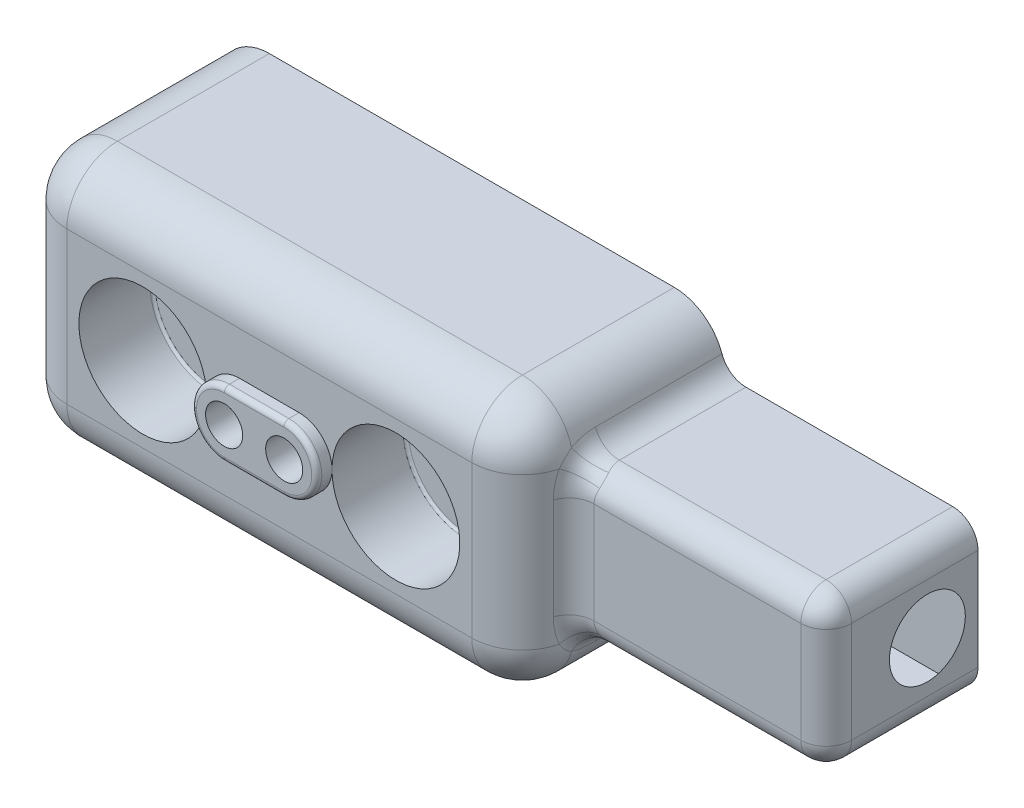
ISO-10303-21;
HEADER;
FILE_DESCRIPTION(('STEP AP214'),'2;1');
FILE_NAME('part.step','',(''),(''),'','','');
FILE_SCHEMA(('AUTOMOTIVE_DESIGN { 1 0 10303 214 1 1 1 1 }'));
ENDSEC;
DATA;
#1=APPLICATION_CONTEXT('core data for automotive mechanical design processes');
#2=APPLICATION_PROTOCOL_DEFINITION('international standard','automotive_design',2000,#1);
#3=PRODUCT_CONTEXT('',#1,'mechanical');
#4=PRODUCT('Part','Part','',(#3));
#5=PRODUCT_RELATED_PRODUCT_CATEGORY('part','',(#4));
#6=PRODUCT_DEFINITION_FORMATION('','',#4);
#7=PRODUCT_DEFINITION_CONTEXT('part definition',#1,'design');
#8=PRODUCT_DEFINITION('design','',#6,#7);
#9=PRODUCT_DEFINITION_SHAPE('','',#8);
#10=(LENGTH_UNIT() NAMED_UNIT(*) SI_UNIT(.MILLI.,.METRE.));
#11=(NAMED_UNIT(*) PLANE_ANGLE_UNIT() SI_UNIT($,.RADIAN.));
#12=(NAMED_UNIT(*) SI_UNIT($,.STERADIAN.) SOLID_ANGLE_UNIT());
#13=UNCERTAINTY_MEASURE_WITH_UNIT(LENGTH_MEASURE(1.E-05),#10,'distance_accuracy_value','');
#14=(GEOMETRIC_REPRESENTATION_CONTEXT(3) GLOBAL_UNCERTAINTY_ASSIGNED_CONTEXT((#13)) GLOBAL_UNIT_ASSIGNED_CONTEXT((#10,
#11,#12)) REPRESENTATION_CONTEXT('',''));
#15=CARTESIAN_POINT('',(0.,0.,0.));
#16=DIRECTION('',(0.,0.,1.));
#17=DIRECTION('',(1.,0.,0.));
#18=AXIS2_PLACEMENT_3D('',#15,#16,#17);
#19=CARTESIAN_POINT('',(0.,0.,0.));
#20=DIRECTION('',(0.,0.,1.));
#21=DIRECTION('',(1.,0.,0.));
#22=AXIS2_PLACEMENT_3D('',#19,#20,#21);
#23=PLANE('',#22);
#24=DIRECTION('',(1.,0.,0.));
#25=VECTOR('',#24,1.);
#26=CARTESIAN_POINT('',(-10.,3.,0.));
#27=LINE('',#26,#25);
#28=CARTESIAN_POINT('',(8.,3.,0.));
#29=VERTEX_POINT('',#28);
#30=CARTESIAN_POINT('',(-8.,3.,0.));
#31=VERTEX_POINT('',#30);
#32=EDGE_CURVE('E877',#29,#31,#27,.F.);
#33=ORIENTED_EDGE('',*,*,#32,.T.);
#34=DIRECTION('',(0.,-1.,0.));
#35=VECTOR('',#34,1.);
#36=CARTESIAN_POINT('',(-8.,0.,0.));
#37=LINE('',#36,#35);
#38=CARTESIAN_POINT('',(-8.,-3.,0.));
#39=VERTEX_POINT('',#38);
#40=EDGE_CURVE('E775',#31,#39,#37,.T.);
#41=ORIENTED_EDGE('',*,*,#40,.T.);
#42=DIRECTION('',(1.,0.,0.));
#43=VECTOR('',#42,1.);
#44=CARTESIAN_POINT('',(0.,-3.,0.));
#45=LINE('',#44,#43);
#46=CARTESIAN_POINT('',(8.,-3.,0.));
#47=VERTEX_POINT('',#46);
#48=EDGE_CURVE('E878',#39,#47,#45,.T.);
#49=ORIENTED_EDGE('',*,*,#48,.T.);
#50=DIRECTION('',(0.,-1.,0.));
#51=VECTOR('',#50,1.);
#52=CARTESIAN_POINT('',(8.,5.,0.));
#53=LINE('',#52,#51);
#54=EDGE_CURVE('E876',#47,#29,#53,.F.);
#55=ORIENTED_EDGE('',*,*,#54,.T.);
#56=EDGE_LOOP('',(#33,#41,#49,#55));
#57=FACE_BOUND('',#56,.T.);
#58=CARTESIAN_POINT('',(1.175,0.,0.));
#59=DIRECTION('',(0.,0.,1.));
#60=DIRECTION('',(1.,0.,0.));
#61=AXIS2_PLACEMENT_3D('',#58,#59,#60);
#62=CIRCLE('',#61,1.3);
#63=CARTESIAN_POINT('',(1.175,-1.3,0.));
#64=VERTEX_POINT('',#63);
#65=CARTESIAN_POINT('',(2.475,0.,0.));
#66=VERTEX_POINT('',#65);
#67=EDGE_CURVE('E349',#64,#66,#62,.T.);
#68=ORIENTED_EDGE('',*,*,#67,.F.);
#69=DIRECTION('',(1.,0.,0.));
#70=VECTOR('',#69,1.);
#71=CARTESIAN_POINT('',(-1.175,-1.3,0.));
#72=LINE('',#71,#70);
#73=CARTESIAN_POINT('',(-1.175,-1.3,0.));
#74=VERTEX_POINT('',#73);
#75=EDGE_CURVE('E345',#74,#64,#72,.T.);
#76=ORIENTED_EDGE('',*,*,#75,.F.);
#77=CARTESIAN_POINT('',(-1.175,0.,0.));
#78=DIRECTION('',(0.,0.,1.));
#79=DIRECTION('',(1.,0.,0.));
#80=AXIS2_PLACEMENT_3D('',#77,#78,#79);
#81=CIRCLE('',#80,1.3);
#82=CARTESIAN_POINT('',(-2.475,0.,0.));
#83=VERTEX_POINT('',#82);
#84=EDGE_CURVE('E342',#83,#74,#81,.T.);
#85=ORIENTED_EDGE('',*,*,#84,.F.);
#86=CARTESIAN_POINT('',(-5.,0.,0.));
#87=DIRECTION('',(0.,0.,1.));
#88=DIRECTION('',(1.,0.,0.));
#89=AXIS2_PLACEMENT_3D('',#86,#87,#88);
#90=CIRCLE('',#89,2.525);
#91=EDGE_CURVE('E952',#83,#83,#90,.F.);
#92=ORIENTED_EDGE('',*,*,#91,.T.);
#93=CARTESIAN_POINT('',(-1.175,1.3,0.));
#94=VERTEX_POINT('',#93);
#95=EDGE_CURVE('E343',#94,#83,#81,.T.);
#96=ORIENTED_EDGE('',*,*,#95,.F.);
#97=DIRECTION('',(-1.,0.,0.));
#98=VECTOR('',#97,1.);
#99=CARTESIAN_POINT('',(-1.175,1.3,0.));
#100=LINE('',#99,#98);
#101=CARTESIAN_POINT('',(1.175,1.3,0.));
#102=VERTEX_POINT('',#101);
#103=EDGE_CURVE('E351',#102,#94,#100,.T.);
#104=ORIENTED_EDGE('',*,*,#103,.F.);
#105=EDGE_CURVE('E348',#66,#102,#62,.T.);
#106=ORIENTED_EDGE('',*,*,#105,.F.);
#107=CARTESIAN_POINT('',(5.,0.,0.));
#108=DIRECTION('',(0.,0.,1.));
#109=DIRECTION('',(1.,0.,0.));
#110=AXIS2_PLACEMENT_3D('',#107,#108,#109);
#111=CIRCLE('',#110,2.525);
#112=EDGE_CURVE('E956',#66,#66,#111,.F.);
#113=ORIENTED_EDGE('',*,*,#112,.T.);
#114=EDGE_LOOP('',(#68,#76,#85,#92,#96,#104,#106,#113));
#115=FACE_BOUND('',#114,.T.);
#116=ADVANCED_FACE('F37',(#57,#115),#23,.T.);
#117=CARTESIAN_POINT('',(-2.626,-1.38875,-3.074));
#118=DIRECTION('',(0.,1.,0.));
#119=DIRECTION('',(-1.,0.,0.));
#120=AXIS2_PLACEMENT_3D('',#117,#118,#119);
#121=PLANE('',#120);
#122=DIRECTION('',(1.,0.,0.));
#123=VECTOR('',#122,1.);
#124=CARTESIAN_POINT('',(-10.2426406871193,-1.38875,-5.43310191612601));
#125=LINE('',#124,#123);
#126=CARTESIAN_POINT('',(-2.626,-1.38875,-5.43310191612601));
#127=VERTEX_POINT('',#126);
#128=CARTESIAN_POINT('',(2.626,-1.38875,-5.43310191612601));
#129=VERTEX_POINT('',#128);
#130=EDGE_CURVE('E375',#127,#129,#125,.T.);
#131=ORIENTED_EDGE('',*,*,#130,.F.);
#132=DIRECTION('',(0.,0.,-1.));
#133=VECTOR('',#132,1.);
#134=CARTESIAN_POINT('',(-2.626,-1.38875,-3.074));
#135=LINE('',#134,#133);
#136=CARTESIAN_POINT('',(-2.626,-1.38875,-3.074));
#137=VERTEX_POINT('',#136);
#138=EDGE_CURVE('E1585',#137,#127,#135,.T.);
#139=ORIENTED_EDGE('',*,*,#138,.F.);
#140=DIRECTION('',(-1.,0.,0.));
#141=VECTOR('',#140,1.);
#142=CARTESIAN_POINT('',(2.626,-1.38875,-3.074));
#143=LINE('',#142,#141);
#144=CARTESIAN_POINT('',(2.626,-1.38875,-3.074));
#145=VERTEX_POINT('',#144);
#146=EDGE_CURVE('E1592',#145,#137,#143,.T.);
#147=ORIENTED_EDGE('',*,*,#146,.F.);
#148=DIRECTION('',(0.,0.,-1.));
#149=VECTOR('',#148,1.);
#150=CARTESIAN_POINT('',(2.626,-1.38875,-3.074));
#151=LINE('',#150,#149);
#152=EDGE_CURVE('E1595',#145,#129,#151,.T.);
#153=ORIENTED_EDGE('',*,*,#152,.T.);
#154=EDGE_LOOP('',(#131,#139,#147,#153));
#155=FACE_BOUND('',#154,.T.);
#156=ADVANCED_FACE('F414',(#155),#121,.T.);
#157=CARTESIAN_POINT('',(-2.626,1.38875,-3.074));
#158=DIRECTION('',(0.,-1.,0.));
#159=DIRECTION('',(1.,0.,0.));
#160=AXIS2_PLACEMENT_3D('',#157,#158,#159);
#161=PLANE('',#160);
#162=DIRECTION('',(1.,0.,0.));
#163=VECTOR('',#162,1.);
#164=CARTESIAN_POINT('',(-10.2426406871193,1.38875,-6.56689808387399));
#165=LINE('',#164,#163);
#166=CARTESIAN_POINT('',(-6.,1.38875,-6.56689808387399));
#167=VERTEX_POINT('',#166);
#168=CARTESIAN_POINT('',(14.,1.38875,-6.56689808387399));
#169=VERTEX_POINT('',#168);
#170=EDGE_CURVE('E366',#167,#169,#165,.T.);
#171=ORIENTED_EDGE('',*,*,#170,.F.);
#172=DIRECTION('',(0.,0.,-1.));
#173=VECTOR('',#172,1.);
#174=CARTESIAN_POINT('',(-6.,1.38875,-6.));
#175=LINE('',#174,#173);
#176=CARTESIAN_POINT('',(-6.,1.38875,-8.));
#177=VERTEX_POINT('',#176);
#178=EDGE_CURVE('E1611',#167,#177,#175,.T.);
#179=ORIENTED_EDGE('',*,*,#178,.T.);
#180=DIRECTION('',(1.,0.,0.));
#181=VECTOR('',#180,1.);
#182=CARTESIAN_POINT('',(2.626,1.38875,-8.));
#183=LINE('',#182,#181);
#184=CARTESIAN_POINT('',(14.,1.38875,-8.));
#185=VERTEX_POINT('',#184);
#186=EDGE_CURVE('E303',#177,#185,#183,.T.);
#187=ORIENTED_EDGE('',*,*,#186,.T.);
#188=DIRECTION('',(0.,0.,-1.));
#189=VECTOR('',#188,1.);
#190=CARTESIAN_POINT('',(14.,1.38875,-6.56689808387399));
#191=LINE('',#190,#189);
#192=EDGE_CURVE('E315',#169,#185,#191,.T.);
#193=ORIENTED_EDGE('',*,*,#192,.F.);
#194=EDGE_LOOP('',(#171,#179,#187,#193));
#195=FACE_BOUND('',#194,.T.);
#196=ADVANCED_FACE('F420',(#195),#161,.T.);
#197=CARTESIAN_POINT('',(-5.,0.,-8.));
#198=DIRECTION('',(0.,0.,1.));
#199=DIRECTION('',(1.,0.,0.));
#200=AXIS2_PLACEMENT_3D('',#197,#198,#199);
#201=CYLINDRICAL_SURFACE('',#200,1.);
#202=CARTESIAN_POINT('',(-4.,0.,-4.5));
#203=CARTESIAN_POINT('',(-3.99999972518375,-0.050242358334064,-4.49999979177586));
#204=CARTESIAN_POINT('',(-4.00380698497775,-0.100484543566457,-4.50254598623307));
#205=CARTESIAN_POINT('',(-4.01879843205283,-0.199366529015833,-4.51247673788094));
#206=CARTESIAN_POINT('',(-4.02998612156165,-0.248005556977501,-4.51986359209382));
#207=CARTESIAN_POINT('',(-4.05905385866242,-0.342106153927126,-4.53874758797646));
#208=CARTESIAN_POINT('',(-4.07690257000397,-0.387581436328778,-4.55022547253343));
#209=CARTESIAN_POINT('',(-4.11853168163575,-0.474707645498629,-4.5763693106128));
#210=CARTESIAN_POINT('',(-4.14231294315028,-0.516358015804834,-4.59103572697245));
#211=CARTESIAN_POINT('',(-4.19732846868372,-0.598642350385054,-4.62386335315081));
#212=CARTESIAN_POINT('',(-4.22902393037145,-0.638890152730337,-4.6422155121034));
#213=CARTESIAN_POINT('',(-4.29786502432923,-0.713864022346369,-4.68008843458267));
#214=CARTESIAN_POINT('',(-4.33501846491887,-0.748582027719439,-4.69961084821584));
#215=CARTESIAN_POINT('',(-4.42052618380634,-0.81711148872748,-4.74135867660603));
#216=CARTESIAN_POINT('',(-4.46972282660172,-0.849915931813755,-4.76352466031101));
#217=CARTESIAN_POINT('',(-4.57418168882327,-0.906751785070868,-4.80457926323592));
#218=CARTESIAN_POINT('',(-4.62943320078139,-0.930798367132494,-4.82347352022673));
#219=CARTESIAN_POINT('',(-4.7283556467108,-0.963370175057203,-4.85011866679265));
#220=CARTESIAN_POINT('',(-4.77076422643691,-0.974372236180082,-4.85951186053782));
#221=CARTESIAN_POINT('',(-4.85737225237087,-0.9907530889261,-4.87371015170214));
#222=CARTESIAN_POINT('',(-4.90156847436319,-0.99614157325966,-4.87852315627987));
#223=CARTESIAN_POINT('',(-4.99073738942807,-1.00095682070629,-4.88281697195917));
#224=CARTESIAN_POINT('',(-5.0357125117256,-1.0003592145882,-4.88227598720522));
#225=CARTESIAN_POINT('',(-5.12481748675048,-0.993187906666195,-4.87590112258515));
#226=CARTESIAN_POINT('',(-5.16894659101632,-0.986609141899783,-4.87006275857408));
#227=CARTESIAN_POINT('',(-5.25323352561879,-0.968324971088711,-4.85436407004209));
#228=CARTESIAN_POINT('',(-5.29348066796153,-0.956858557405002,-4.84469255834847));
#229=CARTESIAN_POINT('',(-5.37151184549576,-0.9293505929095,-4.82245188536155));
#230=CARTESIAN_POINT('',(-5.40929506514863,-0.913307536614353,-4.80988177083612));
#231=CARTESIAN_POINT('',(-5.48951269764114,-0.873369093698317,-4.78017901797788));
#232=CARTESIAN_POINT('',(-5.53132995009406,-0.848540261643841,-4.76263841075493));
#233=CARTESIAN_POINT('',(-5.61069169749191,-0.793344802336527,-4.72654231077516));
#234=CARTESIAN_POINT('',(-5.64823082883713,-0.762971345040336,-4.70798558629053));
#235=CARTESIAN_POINT('',(-5.72627127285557,-0.689905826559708,-4.66728328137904));
#236=CARTESIAN_POINT('',(-5.7656670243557,-0.645969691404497,-4.64522627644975));
#237=CARTESIAN_POINT('',(-5.83659824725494,-0.551003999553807,-4.60390949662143));
#238=CARTESIAN_POINT('',(-5.86814107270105,-0.49998114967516,-4.58464711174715));
#239=CARTESIAN_POINT('',(-5.91673885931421,-0.402428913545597,-4.55427297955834));
#240=CARTESIAN_POINT('',(-5.93542168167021,-0.356978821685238,-4.54230369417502));
#241=CARTESIAN_POINT('',(-5.96605246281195,-0.263018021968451,-4.52246140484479));
#242=CARTESIAN_POINT('',(-5.97800611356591,-0.214509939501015,-4.51458493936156));
#243=CARTESIAN_POINT('',(-5.9945805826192,-0.115492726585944,-4.50362058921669));
#244=CARTESIAN_POINT('',(-5.99916973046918,-0.06497590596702,-4.50055338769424));
#245=CARTESIAN_POINT('',(-6.00062354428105,0.0362207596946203,-4.49958442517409));
#246=CARTESIAN_POINT('',(-5.99748875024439,0.0869005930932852,-4.50168230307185));
#247=CARTESIAN_POINT('',(-5.98418797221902,0.18322785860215,-4.51050205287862));
#248=CARTESIAN_POINT('',(-5.97453135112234,0.228978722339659,-4.51688876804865));
#249=CARTESIAN_POINT('',(-5.94920215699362,0.318058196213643,-4.53340775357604));
#250=CARTESIAN_POINT('',(-5.9335286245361,0.361386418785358,-4.54354062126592));
#251=CARTESIAN_POINT('',(-5.89567385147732,0.447332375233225,-4.5675182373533));
#252=CARTESIAN_POINT('',(-5.87315592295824,0.489748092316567,-4.58155064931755));
#253=CARTESIAN_POINT('',(-5.8227833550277,0.570341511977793,-4.61199072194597));
#254=CARTESIAN_POINT('',(-5.79492541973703,0.608516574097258,-4.62839984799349));
#255=CARTESIAN_POINT('',(-5.72969606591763,0.685927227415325,-4.66522726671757));
#256=CARTESIAN_POINT('',(-5.69151686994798,0.724375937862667,-4.68586921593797));
#257=CARTESIAN_POINT('',(-5.60944428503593,0.794669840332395,-4.72714413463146));
#258=CARTESIAN_POINT('',(-5.5655469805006,0.826510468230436,-4.74777708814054));
#259=CARTESIAN_POINT('',(-5.4764287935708,0.880623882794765,-4.78530160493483));
#260=CARTESIAN_POINT('',(-5.43163398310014,0.903478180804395,-4.80236201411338));
#261=CARTESIAN_POINT('',(-5.33806367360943,0.942481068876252,-4.83280512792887));
#262=CARTESIAN_POINT('',(-5.2892955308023,0.958641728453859,-4.8461944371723));
#263=CARTESIAN_POINT('',(-5.19771775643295,0.981179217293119,-4.86533395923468));
#264=CARTESIAN_POINT('',(-5.15541409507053,0.988792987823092,-4.87202500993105));
#265=CARTESIAN_POINT('',(-5.06971335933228,0.998496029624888,-4.88060266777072));
#266=CARTESIAN_POINT('',(-5.02631752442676,1.00059130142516,-4.88249449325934));
#267=CARTESIAN_POINT('',(-4.93967847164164,0.999119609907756,-4.88117899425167));
#268=CARTESIAN_POINT('',(-4.89643535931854,0.995549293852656,-4.87796865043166));
#269=CARTESIAN_POINT('',(-4.81132823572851,0.98298498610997,-4.8669477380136));
#270=CARTESIAN_POINT('',(-4.76946614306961,0.973983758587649,-4.85913103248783));
#271=CARTESIAN_POINT('',(-4.67714440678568,0.947965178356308,-4.8373657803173));
#272=CARTESIAN_POINT('',(-4.62736614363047,0.929450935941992,-4.82233833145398));
#273=CARTESIAN_POINT('',(-4.53225658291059,0.885422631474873,-4.78888919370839));
#274=CARTESIAN_POINT('',(-4.48693165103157,0.859898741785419,-4.77046275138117));
#275=CARTESIAN_POINT('',(-4.40035905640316,0.801991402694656,-4.73191406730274));
#276=CARTESIAN_POINT('',(-4.35920062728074,0.76949154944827,-4.71176706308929));
#277=CARTESIAN_POINT('',(-4.28233876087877,0.698358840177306,-4.67185849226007));
#278=CARTESIAN_POINT('',(-4.24663700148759,0.659724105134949,-4.6520970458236));
#279=CARTESIAN_POINT('',(-4.17664394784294,0.570728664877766,-4.61184224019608));
#280=CARTESIAN_POINT('',(-4.14329067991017,0.519480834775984,-4.59165097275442));
#281=CARTESIAN_POINT('',(-4.08604336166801,0.410434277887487,-4.55611167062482));
#282=CARTESIAN_POINT('',(-4.06213444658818,0.35264603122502,-4.54075603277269));
#283=CARTESIAN_POINT('',(-4.02942271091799,0.245717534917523,-4.51949177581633));
#284=CARTESIAN_POINT('',(-4.01844448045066,0.197506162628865,-4.51224259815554));
#285=CARTESIAN_POINT('',(-4.00373598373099,0.0995290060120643,-4.50249859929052));
#286=CARTESIAN_POINT('',(-4.000000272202,0.0497644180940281,-4.50000020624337));
#287=CARTESIAN_POINT('',(-4.,0.,-4.5));
#288=B_SPLINE_CURVE_WITH_KNOTS('',3,(#202,#203,#204,#205,#206,#207,#208,#209,#210,#211,#212,
#213,#214,#215,#216,#217,#218,#219,#220,#221,#222,#223,#224,#225,#226,#227,#228,#229,#230,#231,
#232,#233,#234,#235,#236,#237,#238,#239,#240,#241,#242,#243,#244,#245,#246,#247,#248,#249,#250,
#251,#252,#253,#254,#255,#256,#257,#258,#259,#260,#261,#262,#263,#264,#265,#266,#267,#268,#269,
#270,#271,#272,#273,#274,#275,#276,#277,#278,#279,#280,#281,#282,#283,#284,#285,#286,#287),
.UNSPECIFIED.,.T.,.F.,(4,2,2,2,2,2,2,2,2,2,2,2,2,2,2,2,2,2,2,2,2,2,2,2,2,2,2,2,2,2,2,2,2,2,2,2,
2,2,2,2,2,2,4),(0.,0.1505266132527,0.301124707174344,0.451023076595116,0.600943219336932,
0.763585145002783,0.926462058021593,1.11503341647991,1.30327652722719,1.43716846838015,
1.57082883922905,1.70503355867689,1.83935198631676,1.96774431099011,2.09617891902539,
2.25073787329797,2.40548851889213,2.5935947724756,2.78152420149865,2.93262043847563,
3.08358867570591,3.2352044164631,3.38680955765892,3.5277654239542,3.66874377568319,
3.81826173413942,3.96787227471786,4.1411408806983,4.31452876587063,4.47324967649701,
4.63168313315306,4.76162024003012,4.8914160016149,5.02128860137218,5.15133461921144,
5.31603304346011,5.48096356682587,5.64889622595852,5.81688041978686,6.00897675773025,
6.20076953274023,6.34997645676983,6.49907115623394),.UNSPECIFIED.);
#289=CARTESIAN_POINT('',(-6.,0.,-4.5));
#290=VERTEX_POINT('',#289);
#291=EDGE_CURVE('E385',#290,#290,#288,.T.);
#292=ORIENTED_EDGE('',*,*,#291,.T.);
#293=EDGE_LOOP('',(#292));
#294=FACE_BOUND('',#293,.T.);
#295=CARTESIAN_POINT('',(-5.,0.,-2.9));
#296=DIRECTION('',(0.,0.,1.));
#297=DIRECTION('',(1.,0.,0.));
#298=AXIS2_PLACEMENT_3D('',#295,#296,#297);
#299=CIRCLE('',#298,1.);
#300=CARTESIAN_POINT('',(-4.,0.,-2.9));
#301=VERTEX_POINT('',#300);
#302=EDGE_CURVE('E1582',#301,#301,#299,.T.);
#303=ORIENTED_EDGE('',*,*,#302,.T.);
#304=EDGE_LOOP('',(#303));
#305=FACE_BOUND('',#304,.T.);
#306=ADVANCED_FACE('F1149',(#294,#305),#201,.F.);
#307=CARTESIAN_POINT('',(5.,0.,-8.));
#308=DIRECTION('',(0.,0.,1.));
#309=DIRECTION('',(1.,0.,0.));
#310=AXIS2_PLACEMENT_3D('',#307,#308,#309);
#311=CYLINDRICAL_SURFACE('',#310,1.);
#312=CARTESIAN_POINT('',(6.,0.,-4.5));
#313=CARTESIAN_POINT('',(6.00000027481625,-0.0502423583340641,-4.49999979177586));
#314=CARTESIAN_POINT('',(5.99619301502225,-0.100484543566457,-4.50254598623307));
#315=CARTESIAN_POINT('',(5.98120156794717,-0.199366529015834,-4.51247673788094));
#316=CARTESIAN_POINT('',(5.97001387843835,-0.248005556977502,-4.51986359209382));
#317=CARTESIAN_POINT('',(5.94094614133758,-0.342106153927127,-4.53874758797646));
#318=CARTESIAN_POINT('',(5.92309742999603,-0.387581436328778,-4.55022547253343));
#319=CARTESIAN_POINT('',(5.88146831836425,-0.47470764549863,-4.5763693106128));
#320=CARTESIAN_POINT('',(5.85768705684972,-0.516358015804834,-4.59103572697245));
#321=CARTESIAN_POINT('',(5.80267153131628,-0.598642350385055,-4.62386335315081));
#322=CARTESIAN_POINT('',(5.77097606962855,-0.638890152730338,-4.6422155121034));
#323=CARTESIAN_POINT('',(5.70213497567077,-0.71386402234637,-4.68008843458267));
#324=CARTESIAN_POINT('',(5.66498153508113,-0.74858202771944,-4.69961084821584));
#325=CARTESIAN_POINT('',(5.57947381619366,-0.817111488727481,-4.74135867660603));
#326=CARTESIAN_POINT('',(5.53027717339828,-0.849915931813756,-4.76352466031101));
#327=CARTESIAN_POINT('',(5.42581831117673,-0.906751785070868,-4.80457926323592));
#328=CARTESIAN_POINT('',(5.37056679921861,-0.930798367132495,-4.82347352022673));
#329=CARTESIAN_POINT('',(5.2716443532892,-0.963370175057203,-4.85011866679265));
#330=CARTESIAN_POINT('',(5.22923577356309,-0.974372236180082,-4.85951186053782));
#331=CARTESIAN_POINT('',(5.14262774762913,-0.9907530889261,-4.87371015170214));
#332=CARTESIAN_POINT('',(5.09843152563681,-0.99614157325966,-4.87852315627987));
#333=CARTESIAN_POINT('',(5.00926261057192,-1.00095682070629,-4.88281697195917));
#334=CARTESIAN_POINT('',(4.9642874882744,-1.0003592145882,-4.88227598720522));
#335=CARTESIAN_POINT('',(4.87518251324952,-0.993187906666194,-4.87590112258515));
#336=CARTESIAN_POINT('',(4.83105340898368,-0.986609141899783,-4.87006275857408));
#337=CARTESIAN_POINT('',(4.74676647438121,-0.968324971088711,-4.85436407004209));
#338=CARTESIAN_POINT('',(4.70651933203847,-0.956858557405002,-4.84469255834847));
#339=CARTESIAN_POINT('',(4.62848815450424,-0.9293505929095,-4.82245188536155));
#340=CARTESIAN_POINT('',(4.59070493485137,-0.913307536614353,-4.80988177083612));
#341=CARTESIAN_POINT('',(4.51048730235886,-0.873369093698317,-4.78017901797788));
#342=CARTESIAN_POINT('',(4.46867004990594,-0.84854026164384,-4.76263841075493));
#343=CARTESIAN_POINT('',(4.38930830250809,-0.793344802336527,-4.72654231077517));
#344=CARTESIAN_POINT('',(4.35176917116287,-0.762971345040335,-4.70798558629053));
#345=CARTESIAN_POINT('',(4.27372872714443,-0.689905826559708,-4.66728328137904));
#346=CARTESIAN_POINT('',(4.2343329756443,-0.645969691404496,-4.64522627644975));
#347=CARTESIAN_POINT('',(4.16340175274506,-0.551003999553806,-4.60390949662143));
#348=CARTESIAN_POINT('',(4.13185892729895,-0.499981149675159,-4.58464711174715));
#349=CARTESIAN_POINT('',(4.08326114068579,-0.402428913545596,-4.55427297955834));
#350=CARTESIAN_POINT('',(4.06457831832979,-0.356978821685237,-4.54230369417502));
#351=CARTESIAN_POINT('',(4.03394753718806,-0.26301802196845,-4.52246140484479));
#352=CARTESIAN_POINT('',(4.02199388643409,-0.214509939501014,-4.51458493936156));
#353=CARTESIAN_POINT('',(4.0054194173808,-0.115492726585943,-4.50362058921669));
#354=CARTESIAN_POINT('',(4.00083026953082,-0.0649759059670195,-4.50055338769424));
#355=CARTESIAN_POINT('',(3.99937645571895,0.0362207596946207,-4.49958442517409));
#356=CARTESIAN_POINT('',(4.00251124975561,0.0869005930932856,-4.50168230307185));
#357=CARTESIAN_POINT('',(4.01581202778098,0.18322785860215,-4.51050205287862));
#358=CARTESIAN_POINT('',(4.02546864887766,0.228978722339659,-4.51688876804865));
#359=CARTESIAN_POINT('',(4.05079784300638,0.318058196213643,-4.53340775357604));
#360=CARTESIAN_POINT('',(4.0664713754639,0.361386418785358,-4.54354062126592));
#361=CARTESIAN_POINT('',(4.10432614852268,0.447332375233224,-4.5675182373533));
#362=CARTESIAN_POINT('',(4.12684407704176,0.489748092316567,-4.58155064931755));
#363=CARTESIAN_POINT('',(4.17721664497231,0.570341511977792,-4.61199072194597));
#364=CARTESIAN_POINT('',(4.20507458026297,0.608516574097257,-4.62839984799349));
#365=CARTESIAN_POINT('',(4.27030393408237,0.685927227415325,-4.66522726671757));
#366=CARTESIAN_POINT('',(4.30848313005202,0.724375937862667,-4.68586921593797));
#367=CARTESIAN_POINT('',(4.39055571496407,0.794669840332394,-4.72714413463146));
#368=CARTESIAN_POINT('',(4.4344530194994,0.826510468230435,-4.74777708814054));
#369=CARTESIAN_POINT('',(4.5235712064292,0.880623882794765,-4.78530160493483));
#370=CARTESIAN_POINT('',(4.56836601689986,0.903478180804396,-4.80236201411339));
#371=CARTESIAN_POINT('',(4.66193632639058,0.942481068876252,-4.83280512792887));
#372=CARTESIAN_POINT('',(4.7107044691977,0.95864172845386,-4.8461944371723));
#373=CARTESIAN_POINT('',(4.80228224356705,0.981179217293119,-4.86533395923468));
#374=CARTESIAN_POINT('',(4.84458590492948,0.988792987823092,-4.87202500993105));
#375=CARTESIAN_POINT('',(4.93028664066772,0.998496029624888,-4.88060266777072));
#376=CARTESIAN_POINT('',(4.97368247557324,1.00059130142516,-4.88249449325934));
#377=CARTESIAN_POINT('',(5.06032152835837,0.999119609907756,-4.88117899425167));
#378=CARTESIAN_POINT('',(5.10356464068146,0.995549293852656,-4.87796865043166));
#379=CARTESIAN_POINT('',(5.18867176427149,0.98298498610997,-4.8669477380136));
#380=CARTESIAN_POINT('',(5.23053385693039,0.973983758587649,-4.85913103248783));
#381=CARTESIAN_POINT('',(5.32285559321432,0.947965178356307,-4.8373657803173));
#382=CARTESIAN_POINT('',(5.37263385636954,0.929450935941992,-4.82233833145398));
#383=CARTESIAN_POINT('',(5.46774341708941,0.885422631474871,-4.78888919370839));
#384=CARTESIAN_POINT('',(5.51306834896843,0.859898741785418,-4.77046275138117));
#385=CARTESIAN_POINT('',(5.59964094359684,0.801991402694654,-4.73191406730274));
#386=CARTESIAN_POINT('',(5.64079937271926,0.769491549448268,-4.71176706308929));
#387=CARTESIAN_POINT('',(5.71766123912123,0.698358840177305,-4.67185849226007));
#388=CARTESIAN_POINT('',(5.75336299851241,0.659724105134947,-4.6520970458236));
#389=CARTESIAN_POINT('',(5.82335605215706,0.570728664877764,-4.61184224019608));
#390=CARTESIAN_POINT('',(5.85670932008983,0.519480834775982,-4.59165097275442));
#391=CARTESIAN_POINT('',(5.91395663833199,0.410434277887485,-4.55611167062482));
#392=CARTESIAN_POINT('',(5.93786555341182,0.352646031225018,-4.54075603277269));
#393=CARTESIAN_POINT('',(5.97057728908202,0.245717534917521,-4.51949177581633));
#394=CARTESIAN_POINT('',(5.98155551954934,0.197506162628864,-4.51224259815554));
#395=CARTESIAN_POINT('',(5.99626401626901,0.0995290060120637,-4.50249859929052));
#396=CARTESIAN_POINT('',(5.999999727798,0.0497644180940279,-4.50000020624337));
#397=CARTESIAN_POINT('',(6.,0.,-4.5));
#398=B_SPLINE_CURVE_WITH_KNOTS('',3,(#312,#313,#314,#315,#316,#317,#318,#319,#320,#321,#322,
#323,#324,#325,#326,#327,#328,#329,#330,#331,#332,#333,#334,#335,#336,#337,#338,#339,#340,#341,
#342,#343,#344,#345,#346,#347,#348,#349,#350,#351,#352,#353,#354,#355,#356,#357,#358,#359,#360,
#361,#362,#363,#364,#365,#366,#367,#368,#369,#370,#371,#372,#373,#374,#375,#376,#377,#378,#379,
#380,#381,#382,#383,#384,#385,#386,#387,#388,#389,#390,#391,#392,#393,#394,#395,#396,#397),
.UNSPECIFIED.,.T.,.F.,(4,2,2,2,2,2,2,2,2,2,2,2,2,2,2,2,2,2,2,2,2,2,2,2,2,2,2,2,2,2,2,2,2,2,2,2,
2,2,2,2,2,2,4),(0.,0.1505266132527,0.301124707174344,0.451023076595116,0.600943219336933,
0.763585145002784,0.926462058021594,1.11503341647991,1.3032765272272,1.43716846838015,
1.57082883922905,1.70503355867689,1.83935198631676,1.96774431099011,2.0961789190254,
2.25073787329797,2.40548851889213,2.5935947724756,2.78152420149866,2.93262043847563,
3.08358867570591,3.2352044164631,3.38680955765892,3.5277654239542,3.66874377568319,
3.81826173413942,3.96787227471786,4.1411408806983,4.31452876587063,4.47324967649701,
4.63168313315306,4.76162024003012,4.8914160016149,5.02128860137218,5.15133461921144,
5.31603304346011,5.48096356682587,5.64889622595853,5.81688041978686,6.00897675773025,
6.20076953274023,6.34997645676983,6.49907115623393),.UNSPECIFIED.);
#399=CARTESIAN_POINT('',(6.,0.,-4.5));
#400=VERTEX_POINT('',#399);
#401=EDGE_CURVE('E377',#400,#400,#398,.T.);
#402=ORIENTED_EDGE('',*,*,#401,.T.);
#403=EDGE_LOOP('',(#402));
#404=FACE_BOUND('',#403,.T.);
#405=CARTESIAN_POINT('',(5.,0.,-2.9));
#406=DIRECTION('',(0.,0.,1.));
#407=DIRECTION('',(1.,0.,0.));
#408=AXIS2_PLACEMENT_3D('',#405,#406,#407);
#409=CIRCLE('',#408,1.);
#410=CARTESIAN_POINT('',(6.,0.,-2.9));
#411=VERTEX_POINT('',#410);
#412=EDGE_CURVE('E1581',#411,#411,#409,.T.);
#413=ORIENTED_EDGE('',*,*,#412,.T.);
#414=EDGE_LOOP('',(#413));
#415=FACE_BOUND('',#414,.T.);
#416=ADVANCED_FACE('F391',(#404,#415),#311,.F.);
#417=CARTESIAN_POINT('',(-2.626,1.38875,-3.074));
#418=DIRECTION('',(1.,0.,0.));
#419=DIRECTION('',(0.,1.,0.));
#420=AXIS2_PLACEMENT_3D('',#417,#418,#419);
#421=PLANE('',#420);
#422=CARTESIAN_POINT('',(-2.626,0.,-6.));
#423=DIRECTION('',(1.,0.,0.));
#424=DIRECTION('',(0.,0.,-1.));
#425=AXIS2_PLACEMENT_3D('',#422,#423,#424);
#426=CIRCLE('',#425,1.5);
#427=CARTESIAN_POINT('',(-2.626,1.38875,-5.43310191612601));
#428=VERTEX_POINT('',#427);
#429=EDGE_CURVE('E373',#428,#127,#426,.T.);
#430=ORIENTED_EDGE('',*,*,#429,.F.);
#431=DIRECTION('',(0.,0.,-1.));
#432=VECTOR('',#431,1.);
#433=CARTESIAN_POINT('',(-2.626,1.38875,-3.074));
#434=LINE('',#433,#432);
#435=CARTESIAN_POINT('',(-2.626,1.38875,-3.074));
#436=VERTEX_POINT('',#435);
#437=EDGE_CURVE('E1588',#436,#428,#434,.T.);
#438=ORIENTED_EDGE('',*,*,#437,.F.);
#439=DIRECTION('',(0.,1.,0.));
#440=VECTOR('',#439,1.);
#441=CARTESIAN_POINT('',(-2.626,1.38875,-3.074));
#442=LINE('',#441,#440);
#443=EDGE_CURVE('E302',#137,#436,#442,.T.);
#444=ORIENTED_EDGE('',*,*,#443,.F.);
#445=ORIENTED_EDGE('',*,*,#138,.T.);
#446=EDGE_LOOP('',(#430,#438,#444,#445));
#447=FACE_BOUND('',#446,.T.);
#448=ADVANCED_FACE('F1168',(#447),#421,.T.);
#449=CARTESIAN_POINT('',(2.626,1.38875,-3.074));
#450=DIRECTION('',(-1.,0.,0.));
#451=DIRECTION('',(0.,-1.,0.));
#452=AXIS2_PLACEMENT_3D('',#449,#450,#451);
#453=PLANE('',#452);
#454=CARTESIAN_POINT('',(2.626,0.,-6.));
#455=DIRECTION('',(-1.,0.,0.));
#456=DIRECTION('',(0.,0.,1.));
#457=AXIS2_PLACEMENT_3D('',#454,#455,#456);
#458=CIRCLE('',#457,1.5);
#459=CARTESIAN_POINT('',(2.626,1.38875,-5.43310191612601));
#460=VERTEX_POINT('',#459);
#461=EDGE_CURVE('E371',#129,#460,#458,.T.);
#462=ORIENTED_EDGE('',*,*,#461,.F.);
#463=ORIENTED_EDGE('',*,*,#152,.F.);
#464=DIRECTION('',(0.,-1.,0.));
#465=VECTOR('',#464,1.);
#466=CARTESIAN_POINT('',(2.626,1.38875,-3.074));
#467=LINE('',#466,#465);
#468=CARTESIAN_POINT('',(2.626,1.38875,-3.074));
#469=VERTEX_POINT('',#468);
#470=EDGE_CURVE('E1603',#469,#145,#467,.T.);
#471=ORIENTED_EDGE('',*,*,#470,.F.);
#472=DIRECTION('',(0.,0.,-1.));
#473=VECTOR('',#472,1.);
#474=CARTESIAN_POINT('',(2.626,1.38875,-3.074));
#475=LINE('',#474,#473);
#476=EDGE_CURVE('E1591',#469,#460,#475,.T.);
#477=ORIENTED_EDGE('',*,*,#476,.T.);
#478=EDGE_LOOP('',(#462,#463,#471,#477));
#479=FACE_BOUND('',#478,.T.);
#480=ADVANCED_FACE('F437',(#479),#453,.T.);
#481=CARTESIAN_POINT('',(-10.,5.,-8.));
#482=DIRECTION('',(-1.,0.,0.));
#483=DIRECTION('',(0.,0.,1.));
#484=AXIS2_PLACEMENT_3D('',#481,#482,#483);
#485=PLANE('',#484);
#486=DIRECTION('',(0.,-1.,0.));
#487=VECTOR('',#486,1.);
#488=CARTESIAN_POINT('',(-10.,5.,-2.));
#489=LINE('',#488,#487);
#490=CARTESIAN_POINT('',(-10.,-3.,-2.));
#491=VERTEX_POINT('',#490);
#492=CARTESIAN_POINT('',(-10.,3.,-2.));
#493=VERTEX_POINT('',#492);
#494=EDGE_CURVE('E931',#491,#493,#489,.F.);
#495=ORIENTED_EDGE('',*,*,#494,.T.);
#496=DIRECTION('',(0.,0.,1.));
#497=VECTOR('',#496,1.);
#498=CARTESIAN_POINT('',(-10.,3.,-8.));
#499=LINE('',#498,#497);
#500=CARTESIAN_POINT('',(-10.,3.,-8.));
#501=VERTEX_POINT('',#500);
#502=EDGE_CURVE('E923',#493,#501,#499,.F.);
#503=ORIENTED_EDGE('',*,*,#502,.T.);
#504=DIRECTION('',(0.,-1.,0.));
#505=VECTOR('',#504,1.);
#506=CARTESIAN_POINT('',(-10.,5.,-8.));
#507=LINE('',#506,#505);
#508=CARTESIAN_POINT('',(-10.,-3.,-8.));
#509=VERTEX_POINT('',#508);
#510=EDGE_CURVE('E948',#501,#509,#507,.T.);
#511=ORIENTED_EDGE('',*,*,#510,.T.);
#512=DIRECTION('',(0.,0.,1.));
#513=VECTOR('',#512,1.);
#514=CARTESIAN_POINT('',(-10.,-3.,-8.));
#515=LINE('',#514,#513);
#516=EDGE_CURVE('E928',#509,#491,#515,.T.);
#517=ORIENTED_EDGE('',*,*,#516,.T.);
#518=EDGE_LOOP('',(#495,#503,#511,#517));
#519=FACE_BOUND('',#518,.T.);
#520=ADVANCED_FACE('F431',(#519),#485,.T.);
#521=CARTESIAN_POINT('',(-10.,5.,-8.));
#522=DIRECTION('',(0.,-1.,0.));
#523=DIRECTION('',(1.,0.,0.));
#524=AXIS2_PLACEMENT_3D('',#521,#522,#523);
#525=PLANE('',#524);
#526=DIRECTION('',(1.,0.,0.));
#527=VECTOR('',#526,1.);
#528=CARTESIAN_POINT('',(-10.,5.,-8.));
#529=LINE('',#528,#527);
#530=CARTESIAN_POINT('',(-8.,5.,-8.));
#531=VERTEX_POINT('',#530);
#532=CARTESIAN_POINT('',(8.,5.,-8.));
#533=VERTEX_POINT('',#532);
#534=EDGE_CURVE('E947',#531,#533,#529,.T.);
#535=ORIENTED_EDGE('',*,*,#534,.F.);
#536=DIRECTION('',(0.,0.,1.));
#537=VECTOR('',#536,1.);
#538=CARTESIAN_POINT('',(-8.,5.,0.));
#539=LINE('',#538,#537);
#540=CARTESIAN_POINT('',(-8.,5.,-2.));
#541=VERTEX_POINT('',#540);
#542=EDGE_CURVE('E922',#531,#541,#539,.T.);
#543=ORIENTED_EDGE('',*,*,#542,.T.);
#544=DIRECTION('',(1.,0.,0.));
#545=VECTOR('',#544,1.);
#546=CARTESIAN_POINT('',(10.,5.,-2.));
#547=LINE('',#546,#545);
#548=CARTESIAN_POINT('',(8.,5.,-2.));
#549=VERTEX_POINT('',#548);
#550=EDGE_CURVE('E917',#541,#549,#547,.T.);
#551=ORIENTED_EDGE('',*,*,#550,.T.);
#552=DIRECTION('',(0.,0.,1.));
#553=VECTOR('',#552,1.);
#554=CARTESIAN_POINT('',(8.,5.,-8.));
#555=LINE('',#554,#553);
#556=EDGE_CURVE('E753',#549,#533,#555,.F.);
#557=ORIENTED_EDGE('',*,*,#556,.T.);
#558=EDGE_LOOP('',(#535,#543,#551,#557));
#559=FACE_BOUND('',#558,.T.);
#560=ADVANCED_FACE('F427',(#559),#525,.F.);
#561=CARTESIAN_POINT('',(-10.,-5.,-8.));
#562=DIRECTION('',(0.,-1.,0.));
#563=DIRECTION('',(0.,0.,-1.));
#564=AXIS2_PLACEMENT_3D('',#561,#562,#563);
#565=PLANE('',#564);
#566=DIRECTION('',(1.,0.,0.));
#567=VECTOR('',#566,1.);
#568=CARTESIAN_POINT('',(-10.,-5.,-8.));
#569=LINE('',#568,#567);
#570=CARTESIAN_POINT('',(-8.,-5.,-8.));
#571=VERTEX_POINT('',#570);
#572=CARTESIAN_POINT('',(8.,-5.,-8.));
#573=VERTEX_POINT('',#572);
#574=EDGE_CURVE('E945',#571,#573,#569,.T.);
#575=ORIENTED_EDGE('',*,*,#574,.T.);
#576=DIRECTION('',(0.,0.,1.));
#577=VECTOR('',#576,1.);
#578=CARTESIAN_POINT('',(8.,-5.,0.));
#579=LINE('',#578,#577);
#580=CARTESIAN_POINT('',(8.,-5.,-2.));
#581=VERTEX_POINT('',#580);
#582=EDGE_CURVE('E881',#573,#581,#579,.T.);
#583=ORIENTED_EDGE('',*,*,#582,.T.);
#584=DIRECTION('',(1.,0.,0.));
#585=VECTOR('',#584,1.);
#586=CARTESIAN_POINT('',(-10.,-5.,-2.));
#587=LINE('',#586,#585);
#588=CARTESIAN_POINT('',(-8.,-5.,-2.));
#589=VERTEX_POINT('',#588);
#590=EDGE_CURVE('E939',#581,#589,#587,.F.);
#591=ORIENTED_EDGE('',*,*,#590,.T.);
#592=DIRECTION('',(0.,0.,1.));
#593=VECTOR('',#592,1.);
#594=CARTESIAN_POINT('',(-8.,-5.,-8.));
#595=LINE('',#594,#593);
#596=EDGE_CURVE('E941',#589,#571,#595,.F.);
#597=ORIENTED_EDGE('',*,*,#596,.T.);
#598=EDGE_LOOP('',(#575,#583,#591,#597));
#599=FACE_BOUND('',#598,.T.);
#600=ADVANCED_FACE('F430',(#599),#565,.T.);
#601=CARTESIAN_POINT('',(0.,0.,-8.));
#602=DIRECTION('',(0.,0.,1.));
#603=DIRECTION('',(1.,0.,0.));
#604=AXIS2_PLACEMENT_3D('',#601,#602,#603);
#605=PLANE('',#604);
#606=DIRECTION('',(0.,-1.,0.));
#607=VECTOR('',#606,1.);
#608=CARTESIAN_POINT('',(14.,1.38875,-8.));
#609=LINE('',#608,#607);
#610=CARTESIAN_POINT('',(14.,-1.38875,-8.));
#611=VERTEX_POINT('',#610);
#612=EDGE_CURVE('E299',#185,#611,#609,.T.);
#613=ORIENTED_EDGE('',*,*,#612,.F.);
#614=ORIENTED_EDGE('',*,*,#186,.F.);
#615=DIRECTION('',(0.,1.,0.));
#616=VECTOR('',#615,1.);
#617=CARTESIAN_POINT('',(-6.,1.38875,-8.));
#618=LINE('',#617,#616);
#619=CARTESIAN_POINT('',(-6.,-1.38875,-8.));
#620=VERTEX_POINT('',#619);
#621=EDGE_CURVE('E301',#620,#177,#618,.T.);
#622=ORIENTED_EDGE('',*,*,#621,.F.);
#623=DIRECTION('',(-1.,0.,0.));
#624=VECTOR('',#623,1.);
#625=CARTESIAN_POINT('',(2.626,-1.38875,-8.));
#626=LINE('',#625,#624);
#627=EDGE_CURVE('E294',#611,#620,#626,.T.);
#628=ORIENTED_EDGE('',*,*,#627,.F.);
#629=EDGE_LOOP('',(#613,#614,#622,#628));
#630=FACE_BOUND('',#629,.T.);
#631=DIRECTION('',(0.,1.,0.));
#632=VECTOR('',#631,1.);
#633=CARTESIAN_POINT('',(20.,-3.,-8.));
#634=LINE('',#633,#632);
#635=CARTESIAN_POINT('',(20.,-2.,-8.));
#636=VERTEX_POINT('',#635);
#637=CARTESIAN_POINT('',(20.,2.,-8.));
#638=VERTEX_POINT('',#637);
#639=EDGE_CURVE('E324',#636,#638,#634,.T.);
#640=ORIENTED_EDGE('',*,*,#639,.F.);
#641=CARTESIAN_POINT('',(19.,-2.,-8.));
#642=DIRECTION('',(0.,0.,1.));
#643=DIRECTION('',(1.,0.,0.));
#644=AXIS2_PLACEMENT_3D('',#641,#642,#643);
#645=CIRCLE('',#644,1.);
#646=CARTESIAN_POINT('',(19.,-3.,-8.));
#647=VERTEX_POINT('',#646);
#648=EDGE_CURVE('E808',#636,#647,#645,.F.);
#649=ORIENTED_EDGE('',*,*,#648,.T.);
#650=DIRECTION('',(-1.,0.,0.));
#651=VECTOR('',#650,1.);
#652=CARTESIAN_POINT('',(20.,-3.,-8.));
#653=LINE('',#652,#651);
#654=CARTESIAN_POINT('',(10.8284271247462,-3.,-8.));
#655=VERTEX_POINT('',#654);
#656=EDGE_CURVE('E331',#647,#655,#653,.T.);
#657=ORIENTED_EDGE('',*,*,#656,.T.);
#658=CARTESIAN_POINT('',(10.8284271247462,-4.,-8.));
#659=DIRECTION('',(0.,0.,1.));
#660=DIRECTION('',(1.,0.,0.));
#661=AXIS2_PLACEMENT_3D('',#658,#659,#660);
#662=CIRCLE('',#661,1.);
#663=CARTESIAN_POINT('',(9.88561808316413,-3.66666666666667,-8.));
#664=VERTEX_POINT('',#663);
#665=EDGE_CURVE('E51',#655,#664,#662,.T.);
#666=ORIENTED_EDGE('',*,*,#665,.T.);
#667=CARTESIAN_POINT('',(8.,-3.,-8.));
#668=DIRECTION('',(0.,0.,1.));
#669=DIRECTION('',(1.,0.,0.));
#670=AXIS2_PLACEMENT_3D('',#667,#668,#669);
#671=CIRCLE('',#670,2.);
#672=EDGE_CURVE('E847',#664,#573,#671,.F.);
#673=ORIENTED_EDGE('',*,*,#672,.T.);
#674=ORIENTED_EDGE('',*,*,#574,.F.);
#675=CARTESIAN_POINT('',(-8.,-3.,-8.));
#676=DIRECTION('',(0.,0.,1.));
#677=DIRECTION('',(1.,0.,0.));
#678=AXIS2_PLACEMENT_3D('',#675,#676,#677);
#679=CIRCLE('',#678,2.);
#680=EDGE_CURVE('E927',#571,#509,#679,.F.);
#681=ORIENTED_EDGE('',*,*,#680,.T.);
#682=ORIENTED_EDGE('',*,*,#510,.F.);
#683=CARTESIAN_POINT('',(-8.,3.,-8.));
#684=DIRECTION('',(0.,0.,1.));
#685=DIRECTION('',(1.,0.,0.));
#686=AXIS2_PLACEMENT_3D('',#683,#684,#685);
#687=CIRCLE('',#686,2.);
#688=EDGE_CURVE('E924',#501,#531,#687,.F.);
#689=ORIENTED_EDGE('',*,*,#688,.T.);
#690=ORIENTED_EDGE('',*,*,#534,.T.);
#691=CARTESIAN_POINT('',(8.,3.,-8.));
#692=DIRECTION('',(0.,0.,1.));
#693=DIRECTION('',(1.,0.,0.));
#694=AXIS2_PLACEMENT_3D('',#691,#692,#693);
#695=CIRCLE('',#694,2.);
#696=CARTESIAN_POINT('',(9.88561808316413,3.66666666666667,-8.));
#697=VERTEX_POINT('',#696);
#698=EDGE_CURVE('E936',#533,#697,#695,.F.);
#699=ORIENTED_EDGE('',*,*,#698,.T.);
#700=CARTESIAN_POINT('',(10.8284271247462,4.,-8.));
#701=DIRECTION('',(0.,0.,1.));
#702=DIRECTION('',(1.,0.,0.));
#703=AXIS2_PLACEMENT_3D('',#700,#701,#702);
#704=CIRCLE('',#703,1.);
#705=CARTESIAN_POINT('',(10.8284271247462,3.,-8.));
#706=VERTEX_POINT('',#705);
#707=EDGE_CURVE('E11',#697,#706,#704,.T.);
#708=ORIENTED_EDGE('',*,*,#707,.T.);
#709=DIRECTION('',(-1.,0.,0.));
#710=VECTOR('',#709,1.);
#711=CARTESIAN_POINT('',(20.,3.,-8.));
#712=LINE('',#711,#710);
#713=CARTESIAN_POINT('',(19.,3.,-8.));
#714=VERTEX_POINT('',#713);
#715=EDGE_CURVE('E328',#714,#706,#712,.T.);
#716=ORIENTED_EDGE('',*,*,#715,.F.);
#717=CARTESIAN_POINT('',(19.,2.,-8.));
#718=DIRECTION('',(0.,0.,1.));
#719=DIRECTION('',(1.,0.,0.));
#720=AXIS2_PLACEMENT_3D('',#717,#718,#719);
#721=CIRCLE('',#720,1.);
#722=EDGE_CURVE('E806',#714,#638,#721,.F.);
#723=ORIENTED_EDGE('',*,*,#722,.T.);
#724=EDGE_LOOP('',(#640,#649,#657,#666,#673,#674,#681,#682,#689,#690,#699,#708,#716,#723));
#725=FACE_BOUND('',#724,.T.);
#726=ADVANCED_FACE('F295',(#630,#725),#605,.F.);
#727=CARTESIAN_POINT('',(5.,0.,0.13));
#728=DIRECTION('',(0.,0.,-1.));
#729=DIRECTION('',(0.,1.,0.));
#730=AXIS2_PLACEMENT_3D('',#727,#728,#729);
#731=CYLINDRICAL_SURFACE('',#730,2.525);
#732=ORIENTED_EDGE('',*,*,#112,.F.);
#733=EDGE_LOOP('',(#732));
#734=FACE_BOUND('',#733,.T.);
#735=CARTESIAN_POINT('',(5.,0.,-2.799));
#736=DIRECTION('',(0.,0.,1.));
#737=DIRECTION('',(0.,-1.,0.));
#738=AXIS2_PLACEMENT_3D('',#735,#736,#737);
#739=CIRCLE('',#738,2.525);
#740=CARTESIAN_POINT('',(5.,-2.525,-2.799));
#741=VERTEX_POINT('',#740);
#742=EDGE_CURVE('E1564',#741,#741,#739,.T.);
#743=ORIENTED_EDGE('',*,*,#742,.F.);
#744=EDGE_LOOP('',(#743));
#745=FACE_BOUND('',#744,.T.);
#746=ADVANCED_FACE('F1140',(#734,#745),#731,.F.);
#747=CARTESIAN_POINT('',(5.,0.,-2.9));
#748=DIRECTION('',(0.,0.,1.));
#749=DIRECTION('',(0.,-1.,0.));
#750=AXIS2_PLACEMENT_3D('',#747,#748,#749);
#751=PLANE('',#750);
#752=ORIENTED_EDGE('',*,*,#412,.F.);
#753=EDGE_LOOP('',(#752));
#754=FACE_BOUND('',#753,.T.);
#755=CARTESIAN_POINT('',(5.,0.,-2.9));
#756=DIRECTION('',(0.,0.,1.));
#757=DIRECTION('',(0.,-1.,0.));
#758=AXIS2_PLACEMENT_3D('',#755,#756,#757);
#759=CIRCLE('',#758,2.424);
#760=CARTESIAN_POINT('',(5.,-2.424,-2.9));
#761=VERTEX_POINT('',#760);
#762=EDGE_CURVE('E959',#761,#761,#759,.F.);
#763=ORIENTED_EDGE('',*,*,#762,.F.);
#764=EDGE_LOOP('',(#763));
#765=FACE_BOUND('',#764,.T.);
#766=ADVANCED_FACE('F1535',(#754,#765),#751,.T.);
#767=CARTESIAN_POINT('',(5.,0.,-2.799));
#768=DIRECTION('',(0.,0.,1.));
#769=DIRECTION('',(0.,-1.,0.));
#770=AXIS2_PLACEMENT_3D('',#767,#768,#769);
#771=TOROIDAL_SURFACE('',#770,2.424,0.101);
#772=ORIENTED_EDGE('',*,*,#762,.T.);
#773=EDGE_LOOP('',(#772));
#774=FACE_BOUND('',#773,.T.);
#775=ORIENTED_EDGE('',*,*,#742,.T.);
#776=EDGE_LOOP('',(#775));
#777=FACE_BOUND('',#776,.T.);
#778=ADVANCED_FACE('F1492',(#774,#777),#771,.F.);
#779=CARTESIAN_POINT('',(0.,0.,-3.074));
#780=DIRECTION('',(0.,0.,1.));
#781=DIRECTION('',(0.,-1.,0.));
#782=AXIS2_PLACEMENT_3D('',#779,#780,#781);
#783=PLANE('',#782);
#784=CARTESIAN_POINT('',(1.18675,0.,-3.074));
#785=DIRECTION('',(0.,0.,1.));
#786=DIRECTION('',(0.,1.,0.));
#787=AXIS2_PLACEMENT_3D('',#784,#785,#786);
#788=CIRCLE('',#787,0.73225);
#789=CARTESIAN_POINT('',(1.18675,0.732250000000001,-3.074));
#790=VERTEX_POINT('',#789);
#791=EDGE_CURVE('E1578',#790,#790,#788,.T.);
#792=ORIENTED_EDGE('',*,*,#791,.T.);
#793=EDGE_LOOP('',(#792));
#794=FACE_BOUND('',#793,.T.);
#795=CARTESIAN_POINT('',(-1.18675,0.,-3.074));
#796=DIRECTION('',(0.,0.,1.));
#797=DIRECTION('',(0.,-1.,0.));
#798=AXIS2_PLACEMENT_3D('',#795,#796,#797);
#799=CIRCLE('',#798,0.73225);
#800=CARTESIAN_POINT('',(-1.18675,0.73225,-3.074));
#801=VERTEX_POINT('',#800);
#802=EDGE_CURVE('E1575',#801,#801,#799,.T.);
#803=ORIENTED_EDGE('',*,*,#802,.T.);
#804=EDGE_LOOP('',(#803));
#805=FACE_BOUND('',#804,.T.);
#806=ORIENTED_EDGE('',*,*,#443,.T.);
#807=DIRECTION('',(1.,0.,0.));
#808=VECTOR('',#807,1.);
#809=CARTESIAN_POINT('',(2.626,1.38875,-3.074));
#810=LINE('',#809,#808);
#811=EDGE_CURVE('E1606',#436,#469,#810,.T.);
#812=ORIENTED_EDGE('',*,*,#811,.T.);
#813=ORIENTED_EDGE('',*,*,#470,.T.);
#814=ORIENTED_EDGE('',*,*,#146,.T.);
#815=EDGE_LOOP('',(#806,#812,#813,#814));
#816=FACE_BOUND('',#815,.T.);
#817=ADVANCED_FACE('F1282',(#794,#805,#816),#783,.F.);
#818=CARTESIAN_POINT('',(-1.18675,0.,-0.347));
#819=DIRECTION('',(0.,0.,-1.));
#820=DIRECTION('',(0.,1.,0.));
#821=AXIS2_PLACEMENT_3D('',#818,#819,#820);
#822=CYLINDRICAL_SURFACE('',#821,0.73225);
#823=CARTESIAN_POINT('',(-1.18675,0.,0.6));
#824=DIRECTION('',(0.,0.,1.));
#825=DIRECTION('',(1.,0.,0.));
#826=AXIS2_PLACEMENT_3D('',#823,#824,#825);
#827=CIRCLE('',#826,0.73225);
#828=CARTESIAN_POINT('',(-1.18675,0.73225,0.6));
#829=VERTEX_POINT('',#828);
#830=EDGE_CURVE('E335',#829,#829,#827,.T.);
#831=CARTESIAN_POINT('',(-1.18675,0.73225,-3.074));
#832=CARTESIAN_POINT('',(-1.18675,0.73225,-3.03572916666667));
#833=CARTESIAN_POINT('',(-1.18675,0.73225,-2.99745833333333));
#834=CARTESIAN_POINT('',(-1.18675,0.73225,-2.92091666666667));
#835=CARTESIAN_POINT('',(-1.18675,0.73225,-2.88264583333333));
#836=CARTESIAN_POINT('',(-1.18675,0.73225,-2.80610416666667));
#837=CARTESIAN_POINT('',(-1.18675,0.73225,-2.76783333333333));
#838=CARTESIAN_POINT('',(-1.18675,0.73225,-2.69129166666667));
#839=CARTESIAN_POINT('',(-1.18675,0.73225,-2.65302083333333));
#840=CARTESIAN_POINT('',(-1.18675,0.73225,-2.57647916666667));
#841=CARTESIAN_POINT('',(-1.18675,0.73225,-2.53820833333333));
#842=CARTESIAN_POINT('',(-1.18675,0.73225,-2.46166666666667));
#843=CARTESIAN_POINT('',(-1.18675,0.73225,-2.42339583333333));
#844=CARTESIAN_POINT('',(-1.18675,0.73225,-2.34685416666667));
#845=CARTESIAN_POINT('',(-1.18675,0.73225,-2.30858333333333));
#846=CARTESIAN_POINT('',(-1.18675,0.73225,-2.23204166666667));
#847=CARTESIAN_POINT('',(-1.18675,0.73225,-2.19377083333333));
#848=CARTESIAN_POINT('',(-1.18675,0.73225,-2.11722916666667));
#849=CARTESIAN_POINT('',(-1.18675,0.73225,-2.07895833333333));
#850=CARTESIAN_POINT('',(-1.18675,0.73225,-2.00241666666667));
#851=CARTESIAN_POINT('',(-1.18675,0.73225,-1.96414583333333));
#852=CARTESIAN_POINT('',(-1.18675,0.73225,-1.88760416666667));
#853=CARTESIAN_POINT('',(-1.18675,0.73225,-1.84933333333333));
#854=CARTESIAN_POINT('',(-1.18675,0.73225,-1.77279166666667));
#855=CARTESIAN_POINT('',(-1.18675,0.73225,-1.73452083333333));
#856=CARTESIAN_POINT('',(-1.18675,0.73225,-1.65797916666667));
#857=CARTESIAN_POINT('',(-1.18675,0.73225,-1.61970833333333));
#858=CARTESIAN_POINT('',(-1.18675,0.73225,-1.54316666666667));
#859=CARTESIAN_POINT('',(-1.18675,0.73225,-1.50489583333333));
#860=CARTESIAN_POINT('',(-1.18675,0.73225,-1.42835416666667));
#861=CARTESIAN_POINT('',(-1.18675,0.73225,-1.39008333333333));
#862=CARTESIAN_POINT('',(-1.18675,0.73225,-1.31354166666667));
#863=CARTESIAN_POINT('',(-1.18675,0.73225,-1.27527083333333));
#864=CARTESIAN_POINT('',(-1.18675,0.73225,-1.19872916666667));
#865=CARTESIAN_POINT('',(-1.18675,0.73225,-1.16045833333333));
#866=CARTESIAN_POINT('',(-1.18675,0.73225,-1.08391666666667));
#867=CARTESIAN_POINT('',(-1.18675,0.73225,-1.04564583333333));
#868=CARTESIAN_POINT('',(-1.18675,0.73225,-0.969104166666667));
#869=CARTESIAN_POINT('',(-1.18675,0.73225,-0.930833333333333));
#870=CARTESIAN_POINT('',(-1.18675,0.73225,-0.854291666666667));
#871=CARTESIAN_POINT('',(-1.18675,0.73225,-0.816020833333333));
#872=CARTESIAN_POINT('',(-1.18675,0.73225,-0.739479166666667));
#873=CARTESIAN_POINT('',(-1.18675,0.73225,-0.701208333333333));
#874=CARTESIAN_POINT('',(-1.18675,0.73225,-0.624666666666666));
#875=CARTESIAN_POINT('',(-1.18675,0.73225,-0.586395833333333));
#876=CARTESIAN_POINT('',(-1.18675,0.73225,-0.509854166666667));
#877=CARTESIAN_POINT('',(-1.18675,0.73225,-0.471583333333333));
#878=CARTESIAN_POINT('',(-1.18675,0.73225,-0.395041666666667));
#879=CARTESIAN_POINT('',(-1.18675,0.73225,-0.356770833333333));
#880=CARTESIAN_POINT('',(-1.18675,0.73225,-0.280229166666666));
#881=CARTESIAN_POINT('',(-1.18675,0.73225,-0.241958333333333));
#882=CARTESIAN_POINT('',(-1.18675,0.73225,-0.165416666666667));
#883=CARTESIAN_POINT('',(-1.18675,0.73225,-0.127145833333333));
#884=CARTESIAN_POINT('',(-1.18675,0.73225,-0.0506041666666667));
#885=CARTESIAN_POINT('',(-1.18675,0.73225,-0.0123333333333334));
#886=CARTESIAN_POINT('',(-1.18675,0.73225,0.0642083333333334));
#887=CARTESIAN_POINT('',(-1.18675,0.73225,0.102479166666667));
#888=CARTESIAN_POINT('',(-1.18675,0.73225,0.179020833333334));
#889=CARTESIAN_POINT('',(-1.18675,0.73225,0.217291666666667));
#890=CARTESIAN_POINT('',(-1.18675,0.73225,0.293833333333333));
#891=CARTESIAN_POINT('',(-1.18675,0.73225,0.332104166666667));
#892=CARTESIAN_POINT('',(-1.18675,0.73225,0.408645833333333));
#893=CARTESIAN_POINT('',(-1.18675,0.73225,0.446916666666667));
#894=CARTESIAN_POINT('',(-1.18675,0.73225,0.523458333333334));
#895=CARTESIAN_POINT('',(-1.18675,0.73225,0.561729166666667));
#896=CARTESIAN_POINT('',(-1.18675,0.73225,0.6));
#897=B_SPLINE_CURVE_WITH_KNOTS('',3,(#831,#832,#833,#834,#835,#836,#837,#838,#839,#840,#841,
#842,#843,#844,#845,#846,#847,#848,#849,#850,#851,#852,#853,#854,#855,#856,#857,#858,#859,#860,
#861,#862,#863,#864,#865,#866,#867,#868,#869,#870,#871,#872,#873,#874,#875,#876,#877,#878,#879,
#880,#881,#882,#883,#884,#885,#886,#887,#888,#889,#890,#891,#892,#893,#894,#895,#896),
.UNSPECIFIED.,.F.,.F.,(4,2,2,2,2,2,2,2,2,2,2,2,2,2,2,2,2,2,2,2,2,2,2,2,2,2,2,2,2,2,2,2,4),(0.,
0.1148125,0.229625,0.3444375,0.45925,0.5740625,0.688875,0.8036875,0.9185,1.0333125,1.148125,
1.2629375,1.37775,1.4925625,1.607375,1.7221875,1.837,1.9518125,2.066625,2.1814375,2.29625,
2.4110625,2.525875,2.6406875,2.7555,2.8703125,2.985125,3.0999375,3.21475,3.3295625,3.444375,
3.5591875,3.674),.UNSPECIFIED.);
#898=EDGE_CURVE('BSEAM1274',#801,#829,#897,.T.);
#899=ORIENTED_EDGE('',*,*,#802,.F.);
#900=ORIENTED_EDGE('',*,*,#830,.T.);
#901=ORIENTED_EDGE('',*,*,#898,.T.);
#902=ORIENTED_EDGE('',*,*,#898,.F.);
#903=EDGE_LOOP('',(#899,#901,#900,#902));
#904=FACE_BOUND('',#903,.T.);
#905=ADVANCED_FACE('F1274',(#904),#822,.F.);
#906=CARTESIAN_POINT('',(1.18675,0.,-0.347));
#907=DIRECTION('',(0.,0.,-1.));
#908=DIRECTION('',(0.,1.,0.));
#909=AXIS2_PLACEMENT_3D('',#906,#907,#908);
#910=CYLINDRICAL_SURFACE('',#909,0.73225);
#911=CARTESIAN_POINT('',(1.18675,0.,0.6));
#912=DIRECTION('',(0.,0.,1.));
#913=DIRECTION('',(1.,0.,0.));
#914=AXIS2_PLACEMENT_3D('',#911,#912,#913);
#915=CIRCLE('',#914,0.73225);
#916=CARTESIAN_POINT('',(1.18675,0.732250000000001,0.6));
#917=VERTEX_POINT('',#916);
#918=EDGE_CURVE('E338',#917,#917,#915,.T.);
#919=CARTESIAN_POINT('',(1.18675,0.732250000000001,-3.074));
#920=CARTESIAN_POINT('',(1.18675,0.732250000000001,-3.03572916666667));
#921=CARTESIAN_POINT('',(1.18675,0.732250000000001,-2.99745833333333));
#922=CARTESIAN_POINT('',(1.18675,0.732250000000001,-2.92091666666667));
#923=CARTESIAN_POINT('',(1.18675,0.732250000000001,-2.88264583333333));
#924=CARTESIAN_POINT('',(1.18675,0.732250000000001,-2.80610416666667));
#925=CARTESIAN_POINT('',(1.18675,0.732250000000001,-2.76783333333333));
#926=CARTESIAN_POINT('',(1.18675,0.732250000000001,-2.69129166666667));
#927=CARTESIAN_POINT('',(1.18675,0.732250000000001,-2.65302083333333));
#928=CARTESIAN_POINT('',(1.18675,0.732250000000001,-2.57647916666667));
#929=CARTESIAN_POINT('',(1.18675,0.732250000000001,-2.53820833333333));
#930=CARTESIAN_POINT('',(1.18675,0.732250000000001,-2.46166666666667));
#931=CARTESIAN_POINT('',(1.18675,0.732250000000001,-2.42339583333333));
#932=CARTESIAN_POINT('',(1.18675,0.732250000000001,-2.34685416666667));
#933=CARTESIAN_POINT('',(1.18675,0.732250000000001,-2.30858333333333));
#934=CARTESIAN_POINT('',(1.18675,0.732250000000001,-2.23204166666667));
#935=CARTESIAN_POINT('',(1.18675,0.732250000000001,-2.19377083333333));
#936=CARTESIAN_POINT('',(1.18675,0.732250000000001,-2.11722916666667));
#937=CARTESIAN_POINT('',(1.18675,0.732250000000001,-2.07895833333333));
#938=CARTESIAN_POINT('',(1.18675,0.732250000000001,-2.00241666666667));
#939=CARTESIAN_POINT('',(1.18675,0.732250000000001,-1.96414583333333));
#940=CARTESIAN_POINT('',(1.18675,0.732250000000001,-1.88760416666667));
#941=CARTESIAN_POINT('',(1.18675,0.732250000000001,-1.84933333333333));
#942=CARTESIAN_POINT('',(1.18675,0.732250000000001,-1.77279166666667));
#943=CARTESIAN_POINT('',(1.18675,0.732250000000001,-1.73452083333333));
#944=CARTESIAN_POINT('',(1.18675,0.732250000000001,-1.65797916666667));
#945=CARTESIAN_POINT('',(1.18675,0.732250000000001,-1.61970833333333));
#946=CARTESIAN_POINT('',(1.18675,0.732250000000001,-1.54316666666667));
#947=CARTESIAN_POINT('',(1.18675,0.732250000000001,-1.50489583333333));
#948=CARTESIAN_POINT('',(1.18675,0.732250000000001,-1.42835416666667));
#949=CARTESIAN_POINT('',(1.18675,0.732250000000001,-1.39008333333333));
#950=CARTESIAN_POINT('',(1.18675,0.732250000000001,-1.31354166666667));
#951=CARTESIAN_POINT('',(1.18675,0.732250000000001,-1.27527083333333));
#952=CARTESIAN_POINT('',(1.18675,0.732250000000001,-1.19872916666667));
#953=CARTESIAN_POINT('',(1.18675,0.732250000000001,-1.16045833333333));
#954=CARTESIAN_POINT('',(1.18675,0.732250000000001,-1.08391666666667));
#955=CARTESIAN_POINT('',(1.18675,0.732250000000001,-1.04564583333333));
#956=CARTESIAN_POINT('',(1.18675,0.732250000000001,-0.969104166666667));
#957=CARTESIAN_POINT('',(1.18675,0.732250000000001,-0.930833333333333));
#958=CARTESIAN_POINT('',(1.18675,0.732250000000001,-0.854291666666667));
#959=CARTESIAN_POINT('',(1.18675,0.732250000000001,-0.816020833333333));
#960=CARTESIAN_POINT('',(1.18675,0.732250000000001,-0.739479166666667));
#961=CARTESIAN_POINT('',(1.18675,0.732250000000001,-0.701208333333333));
#962=CARTESIAN_POINT('',(1.18675,0.732250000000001,-0.624666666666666));
#963=CARTESIAN_POINT('',(1.18675,0.732250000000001,-0.586395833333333));
#964=CARTESIAN_POINT('',(1.18675,0.732250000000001,-0.509854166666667));
#965=CARTESIAN_POINT('',(1.18675,0.732250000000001,-0.471583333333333));
#966=CARTESIAN_POINT('',(1.18675,0.732250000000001,-0.395041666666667));
#967=CARTESIAN_POINT('',(1.18675,0.732250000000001,-0.356770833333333));
#968=CARTESIAN_POINT('',(1.18675,0.732250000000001,-0.280229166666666));
#969=CARTESIAN_POINT('',(1.18675,0.732250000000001,-0.241958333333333));
#970=CARTESIAN_POINT('',(1.18675,0.732250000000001,-0.165416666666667));
#971=CARTESIAN_POINT('',(1.18675,0.732250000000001,-0.127145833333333));
#972=CARTESIAN_POINT('',(1.18675,0.732250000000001,-0.0506041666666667));
#973=CARTESIAN_POINT('',(1.18675,0.732250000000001,-0.0123333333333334));
#974=CARTESIAN_POINT('',(1.18675,0.732250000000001,0.0642083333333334));
#975=CARTESIAN_POINT('',(1.18675,0.732250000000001,0.102479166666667));
#976=CARTESIAN_POINT('',(1.18675,0.732250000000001,0.179020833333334));
#977=CARTESIAN_POINT('',(1.18675,0.732250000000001,0.217291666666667));
#978=CARTESIAN_POINT('',(1.18675,0.732250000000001,0.293833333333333));
#979=CARTESIAN_POINT('',(1.18675,0.732250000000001,0.332104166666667));
#980=CARTESIAN_POINT('',(1.18675,0.732250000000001,0.408645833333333));
#981=CARTESIAN_POINT('',(1.18675,0.732250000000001,0.446916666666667));
#982=CARTESIAN_POINT('',(1.18675,0.732250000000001,0.523458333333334));
#983=CARTESIAN_POINT('',(1.18675,0.732250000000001,0.561729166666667));
#984=CARTESIAN_POINT('',(1.18675,0.732250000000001,0.6));
#985=B_SPLINE_CURVE_WITH_KNOTS('',3,(#919,#920,#921,#922,#923,#924,#925,#926,#927,#928,#929,
#930,#931,#932,#933,#934,#935,#936,#937,#938,#939,#940,#941,#942,#943,#944,#945,#946,#947,#948,
#949,#950,#951,#952,#953,#954,#955,#956,#957,#958,#959,#960,#961,#962,#963,#964,#965,#966,#967,
#968,#969,#970,#971,#972,#973,#974,#975,#976,#977,#978,#979,#980,#981,#982,#983,#984),
.UNSPECIFIED.,.F.,.F.,(4,2,2,2,2,2,2,2,2,2,2,2,2,2,2,2,2,2,2,2,2,2,2,2,2,2,2,2,2,2,2,2,4),(0.,
0.1148125,0.229625,0.3444375,0.45925,0.5740625,0.688875,0.8036875,0.9185,1.0333125,1.148125,
1.2629375,1.37775,1.4925625,1.607375,1.7221875,1.837,1.9518125,2.066625,2.1814375,2.29625,
2.4110625,2.525875,2.6406875,2.7555,2.8703125,2.985125,3.0999375,3.21475,3.3295625,3.444375,
3.5591875,3.674),.UNSPECIFIED.);
#986=EDGE_CURVE('BSEAM1281',#790,#917,#985,.T.);
#987=ORIENTED_EDGE('',*,*,#791,.F.);
#988=ORIENTED_EDGE('',*,*,#918,.T.);
#989=ORIENTED_EDGE('',*,*,#986,.T.);
#990=ORIENTED_EDGE('',*,*,#986,.F.);
#991=EDGE_LOOP('',(#987,#989,#988,#990));
#992=FACE_BOUND('',#991,.T.);
#993=ADVANCED_FACE('F1281',(#992),#910,.F.);
#994=CARTESIAN_POINT('',(-5.,0.,0.13));
#995=DIRECTION('',(0.,0.,-1.));
#996=DIRECTION('',(0.,1.,0.));
#997=AXIS2_PLACEMENT_3D('',#994,#995,#996);
#998=CYLINDRICAL_SURFACE('',#997,2.525);
#999=ORIENTED_EDGE('',*,*,#91,.F.);
#1000=EDGE_LOOP('',(#999));
#1001=FACE_BOUND('',#1000,.T.);
#1002=CARTESIAN_POINT('',(-5.,0.,-2.799));
#1003=DIRECTION('',(0.,0.,1.));
#1004=DIRECTION('',(0.,-1.,0.));
#1005=AXIS2_PLACEMENT_3D('',#1002,#1003,#1004);
#1006=CIRCLE('',#1005,2.525);
#1007=CARTESIAN_POINT('',(-5.,-2.525,-2.799));
#1008=VERTEX_POINT('',#1007);
#1009=EDGE_CURVE('E1570',#1008,#1008,#1006,.T.);
#1010=ORIENTED_EDGE('',*,*,#1009,.F.);
#1011=EDGE_LOOP('',(#1010));
#1012=FACE_BOUND('',#1011,.T.);
#1013=ADVANCED_FACE('F1296',(#1001,#1012),#998,.F.);
#1014=CARTESIAN_POINT('',(-5.,0.,-2.9));
#1015=DIRECTION('',(0.,0.,1.));
#1016=DIRECTION('',(0.,-1.,0.));
#1017=AXIS2_PLACEMENT_3D('',#1014,#1015,#1016);
#1018=PLANE('',#1017);
#1019=ORIENTED_EDGE('',*,*,#302,.F.);
#1020=EDGE_LOOP('',(#1019));
#1021=FACE_BOUND('',#1020,.T.);
#1022=CARTESIAN_POINT('',(-5.,0.,-2.9));
#1023=DIRECTION('',(0.,0.,1.));
#1024=DIRECTION('',(0.,-1.,0.));
#1025=AXIS2_PLACEMENT_3D('',#1022,#1023,#1024);
#1026=CIRCLE('',#1025,2.424);
#1027=CARTESIAN_POINT('',(-5.,-2.424,-2.9));
#1028=VERTEX_POINT('',#1027);
#1029=EDGE_CURVE('E1566',#1028,#1028,#1026,.F.);
#1030=ORIENTED_EDGE('',*,*,#1029,.F.);
#1031=EDGE_LOOP('',(#1030));
#1032=FACE_BOUND('',#1031,.T.);
#1033=ADVANCED_FACE('F1503',(#1021,#1032),#1018,.T.);
#1034=CARTESIAN_POINT('',(-5.,0.,-2.799));
#1035=DIRECTION('',(0.,0.,1.));
#1036=DIRECTION('',(0.,-1.,0.));
#1037=AXIS2_PLACEMENT_3D('',#1034,#1035,#1036);
#1038=TOROIDAL_SURFACE('',#1037,2.424,0.101);
#1039=ORIENTED_EDGE('',*,*,#1029,.T.);
#1040=EDGE_LOOP('',(#1039));
#1041=FACE_BOUND('',#1040,.T.);
#1042=ORIENTED_EDGE('',*,*,#1009,.T.);
#1043=EDGE_LOOP('',(#1042));
#1044=FACE_BOUND('',#1043,.T.);
#1045=ADVANCED_FACE('F1130',(#1041,#1044),#1038,.F.);
#1046=DIRECTION('',(1.,0.,0.));
#1047=VECTOR('',#1046,1.);
#1048=CARTESIAN_POINT('',(-10.2426406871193,-1.38875,-6.56689808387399));
#1049=LINE('',#1048,#1047);
#1050=CARTESIAN_POINT('',(14.,-1.38875,-6.56689808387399));
#1051=VERTEX_POINT('',#1050);
#1052=CARTESIAN_POINT('',(-6.,-1.38875,-6.56689808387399));
#1053=VERTEX_POINT('',#1052);
#1054=EDGE_CURVE('E59',#1051,#1053,#1049,.F.);
#1055=ORIENTED_EDGE('',*,*,#1054,.F.);
#1056=DIRECTION('',(0.,0.,1.));
#1057=VECTOR('',#1056,1.);
#1058=CARTESIAN_POINT('',(14.,-1.38875,-8.));
#1059=LINE('',#1058,#1057);
#1060=EDGE_CURVE('E305',#611,#1051,#1059,.T.);
#1061=ORIENTED_EDGE('',*,*,#1060,.F.);
#1062=ORIENTED_EDGE('',*,*,#627,.T.);
#1063=DIRECTION('',(0.,0.,-1.));
#1064=VECTOR('',#1063,1.);
#1065=CARTESIAN_POINT('',(-6.,-1.38875,-6.));
#1066=LINE('',#1065,#1064);
#1067=EDGE_CURVE('E890',#1053,#620,#1066,.T.);
#1068=ORIENTED_EDGE('',*,*,#1067,.F.);
#1069=EDGE_LOOP('',(#1055,#1061,#1062,#1068));
#1070=FACE_BOUND('',#1069,.T.);
#1071=ADVANCED_FACE('F306',(#1070),#121,.T.);
#1072=DIRECTION('',(1.,0.,0.));
#1073=VECTOR('',#1072,1.);
#1074=CARTESIAN_POINT('',(-10.2426406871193,1.38875,-5.43310191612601));
#1075=LINE('',#1074,#1073);
#1076=EDGE_CURVE('E369',#460,#428,#1075,.F.);
#1077=ORIENTED_EDGE('',*,*,#1076,.F.);
#1078=ORIENTED_EDGE('',*,*,#476,.F.);
#1079=ORIENTED_EDGE('',*,*,#811,.F.);
#1080=ORIENTED_EDGE('',*,*,#437,.T.);
#1081=EDGE_LOOP('',(#1077,#1078,#1079,#1080));
#1082=FACE_BOUND('',#1081,.T.);
#1083=ADVANCED_FACE('F1129',(#1082),#161,.T.);
#1084=CARTESIAN_POINT('',(8.,-3.,-8.));
#1085=DIRECTION('',(0.,0.,-1.));
#1086=DIRECTION('',(-1.,0.,0.));
#1087=AXIS2_PLACEMENT_3D('',#1084,#1085,#1086);
#1088=CYLINDRICAL_SURFACE('',#1087,2.);
#1089=ORIENTED_EDGE('',*,*,#672,.F.);
#1090=DIRECTION('',(0.,0.,-1.));
#1091=VECTOR('',#1090,1.);
#1092=CARTESIAN_POINT('',(9.88561808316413,-3.66666666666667,-8.));
#1093=LINE('',#1092,#1091);
#1094=CARTESIAN_POINT('',(9.88561808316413,-3.66666666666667,-3.));
#1095=VERTEX_POINT('',#1094);
#1096=EDGE_CURVE('E689',#664,#1095,#1093,.F.);
#1097=ORIENTED_EDGE('',*,*,#1096,.T.);
#1098=CARTESIAN_POINT('',(9.90841752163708,-3.59828301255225,-3.63228173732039));
#1099=CARTESIAN_POINT('',(10.1193568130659,-2.9254237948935,-3.3860275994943));
#1100=CARTESIAN_POINT('',(10.8626262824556,-2.94871225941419,-3.3161408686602));
#1101=CARTESIAN_POINT('',(9.90487530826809,-3.60956955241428,-3.58147486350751));
#1102=CARTESIAN_POINT('',(10.1199892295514,-2.93730993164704,-3.35662441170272));
#1103=CARTESIAN_POINT('',(10.85731296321,-2.95717716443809,-3.29073743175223));
#1104=CARTESIAN_POINT('',(9.9016563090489,-3.61950133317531,-3.52996107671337));
#1105=CARTESIAN_POINT('',(10.1204048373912,-2.94799411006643,-3.32611174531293));
#1106=CARTESIAN_POINT('',(10.8524844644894,-2.96462600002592,-3.26498053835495));
#1107=CARTESIAN_POINT('',(9.89600572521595,-3.63658905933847,-3.42580601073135));
#1108=CARTESIAN_POINT('',(10.1209621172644,-2.96655164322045,-3.26358801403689));
#1109=CARTESIAN_POINT('',(10.8440085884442,-2.97744179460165,-3.2129030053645));
#1110=CARTESIAN_POINT('',(9.89357425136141,-3.6437446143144,-3.37316457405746));
#1111=CARTESIAN_POINT('',(10.1211054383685,-2.97445113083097,-3.23153892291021));
#1112=CARTESIAN_POINT('',(10.8403613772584,-2.9828084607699,-3.18658228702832));
#1113=CARTESIAN_POINT('',(9.88769226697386,-3.66089011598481,-3.21449177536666));
#1114=CARTESIAN_POINT('',(10.1213662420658,-2.99340388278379,-3.13425462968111));
#1115=CARTESIAN_POINT('',(10.8315384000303,-2.99566758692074,-3.10724588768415));
#1116=CARTESIAN_POINT('',(9.88561878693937,-3.66666462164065,-3.10723563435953));
#1117=CARTESIAN_POINT('',(10.1213209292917,-2.99999741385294,-3.06701080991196));
#1118=CARTESIAN_POINT('',(10.8284281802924,-2.99999846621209,-3.05361781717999));
#1119=CARTESIAN_POINT('',(9.88561736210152,-3.66666876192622,-2.89013025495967));
#1120=CARTESIAN_POINT('',(10.1213197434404,-3.00000264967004,-2.93134321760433));
#1121=CARTESIAN_POINT('',(10.8284260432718,-3.00000157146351,-2.94506512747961));
#1122=CARTESIAN_POINT('',(9.88779249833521,-3.66061132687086,-2.78028203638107));
#1123=CARTESIAN_POINT('',(10.1213660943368,-2.99308604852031,-2.86246466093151));
#1124=CARTESIAN_POINT('',(10.831688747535,-2.99545849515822,-2.89014101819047));
#1125=CARTESIAN_POINT('',(9.89601326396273,-3.63662185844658,-2.56376861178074));
#1126=CARTESIAN_POINT('',(10.1209924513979,-2.96653518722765,-2.72962268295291));
#1127=CARTESIAN_POINT('',(10.8440198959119,-2.97746639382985,-2.78188430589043));
#1128=CARTESIAN_POINT('',(9.90206324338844,-3.61867647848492,-2.45710712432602));
#1129=CARTESIAN_POINT('',(10.1205675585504,-2.94671390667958,-2.66526430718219));
#1130=CARTESIAN_POINT('',(10.8530948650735,-2.96400735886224,-2.72855356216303));
#1131=CARTESIAN_POINT('',(9.91674445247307,-3.57157885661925,-2.25026934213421));
#1132=CARTESIAN_POINT('',(10.1177646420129,-2.8971670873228,-2.54564780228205));
#1133=CARTESIAN_POINT('',(10.8751166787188,-2.92868414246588,-2.62513467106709));
#1134=CARTESIAN_POINT('',(9.92536942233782,-3.54245374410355,-2.15007802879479));
#1135=CARTESIAN_POINT('',(10.1153582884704,-2.86719955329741,-2.49015242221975));
#1136=CARTESIAN_POINT('',(10.8880541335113,-2.90684030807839,-2.57503901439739));
#1137=CARTESIAN_POINT('',(9.9433728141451,-3.47383044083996,-1.95825091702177));
#1138=CARTESIAN_POINT('',(10.1071378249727,-2.80157500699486,-2.39012045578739));
#1139=CARTESIAN_POINT('',(10.9150592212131,-2.85537283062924,-2.47912545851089));
#1140=CARTESIAN_POINT('',(9.95275092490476,-3.43433651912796,-1.86661161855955));
#1141=CARTESIAN_POINT('',(10.1012486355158,-2.76569675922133,-2.34559166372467));
#1142=CARTESIAN_POINT('',(10.929126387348,-2.82575238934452,-2.43330580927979));
#1143=CARTESIAN_POINT('',(9.96159377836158,-3.39006390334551,-1.78038074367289));
#1144=CARTESIAN_POINT('',(10.0929012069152,-2.72973149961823,-2.30855009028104));
#1145=CARTESIAN_POINT('',(10.9423906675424,-2.79254792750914,-2.39019037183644));
#1146=(BOUNDED_SURFACE() B_SPLINE_SURFACE(3,2,((#1098,#1099,#1100),(#1101,#1102,#1103),(#1104,
#1105,#1106),(#1107,#1108,#1109),(#1110,#1111,#1112),(#1113,#1114,#1115),(#1116,#1117,#1118),
(#1119,#1120,#1121),(#1122,#1123,#1124),(#1125,#1126,#1127),(#1128,#1129,#1130),(#1131,#1132,
#1133),(#1134,#1135,#1136),(#1137,#1138,#1139),(#1140,#1141,#1142),(#1143,#1144,#1145)),
.UNSPECIFIED.,.F.,.F.,.F.) B_SPLINE_SURFACE_WITH_KNOTS((4,2,2,2,2,2,2,4),(3,3),(0.,
0.161361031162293,0.322744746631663,0.644016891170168,0.973180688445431,1.30271466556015,
1.6314539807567,1.96005815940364),(0.,1.),
.UNSPECIFIED.) GEOMETRIC_REPRESENTATION_ITEM() RATIONAL_B_SPLINE_SURFACE(((1.,0.801186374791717,
1.),(1.,0.803648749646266,1.),(1.,0.805845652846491,1.),(1.,0.809658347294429,1.),(1.,
0.811274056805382,1.),(1.,0.815161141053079,1.),(1.,0.816496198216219,1.),(1.,0.816496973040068,
1.),(1.,0.81509631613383,1.),(1.,0.809660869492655,1.),(1.,0.805623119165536,1.),(1.,
0.795375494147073,1.),(1.,0.789170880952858,1.),(1.,0.775350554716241,1.),(1.,0.767735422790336,
1.),(1.,0.759793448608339,1.))) REPRESENTATION_ITEM('') SURFACE());
#1147=CARTESIAN_POINT('',(9.90841752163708,-3.59828301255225,-3.63228173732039));
#1148=CARTESIAN_POINT('',(9.90487530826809,-3.60956955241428,-3.58147486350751));
#1149=CARTESIAN_POINT('',(9.9016563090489,-3.61950133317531,-3.52996107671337));
#1150=CARTESIAN_POINT('',(9.89600572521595,-3.63658905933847,-3.42580601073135));
#1151=CARTESIAN_POINT('',(9.89357425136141,-3.6437446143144,-3.37316457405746));
#1152=CARTESIAN_POINT('',(9.88769226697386,-3.66089011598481,-3.21449177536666));
#1153=CARTESIAN_POINT('',(9.88561878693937,-3.66666462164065,-3.10723563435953));
#1154=CARTESIAN_POINT('',(9.88561736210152,-3.66666876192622,-2.89013025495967));
#1155=CARTESIAN_POINT('',(9.88779249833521,-3.66061132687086,-2.78028203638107));
#1156=CARTESIAN_POINT('',(9.89601326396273,-3.63662185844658,-2.56376861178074));
#1157=CARTESIAN_POINT('',(9.90206324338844,-3.61867647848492,-2.45710712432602));
#1158=CARTESIAN_POINT('',(9.91674445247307,-3.57157885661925,-2.25026934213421));
#1159=CARTESIAN_POINT('',(9.92536942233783,-3.54245374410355,-2.15007802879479));
#1160=CARTESIAN_POINT('',(9.9433728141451,-3.47383044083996,-1.95825091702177));
#1161=CARTESIAN_POINT('',(9.95275092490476,-3.43433651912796,-1.86661161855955));
#1162=CARTESIAN_POINT('',(9.96159377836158,-3.39006390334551,-1.78038074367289));
#1163=B_SPLINE_CURVE_WITH_KNOTS('',3,(#1147,#1148,#1149,#1150,#1151,#1152,#1153,#1154,#1155,
#1156,#1157,#1158,#1159,#1160,#1161,#1162),.UNSPECIFIED.,.F.,.F.,(4,2,2,2,2,2,2,4),(0.,
0.161361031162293,0.322744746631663,0.644016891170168,0.973180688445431,1.30271466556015,
1.6314539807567,1.96005815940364),.UNSPECIFIED.);
#1164=CARTESIAN_POINT('',(9.93954194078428,-3.48803387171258,-2.));
#1165=VERTEX_POINT('',#1164);
#1166=EDGE_CURVE('E838',#1095,#1165,#1163,.T.);
#1167=ORIENTED_EDGE('',*,*,#1166,.T.);
#1168=CARTESIAN_POINT('',(8.,-3.,-2.));
#1169=DIRECTION('',(0.,0.,1.));
#1170=DIRECTION('',(1.,0.,0.));
#1171=AXIS2_PLACEMENT_3D('',#1168,#1169,#1170);
#1172=CIRCLE('',#1171,2.);
#1173=EDGE_CURVE('E769',#581,#1165,#1172,.T.);
#1174=ORIENTED_EDGE('',*,*,#1173,.F.);
#1175=ORIENTED_EDGE('',*,*,#582,.F.);
#1176=EDGE_LOOP('',(#1089,#1097,#1167,#1174,#1175));
#1177=FACE_BOUND('',#1176,.T.);
#1178=ADVANCED_FACE('F509',(#1177),#1088,.T.);
#1179=CARTESIAN_POINT('',(8.,-3.,-2.));
#1180=DIRECTION('',(0.,0.,1.));
#1181=DIRECTION('',(1.,0.,0.));
#1182=AXIS2_PLACEMENT_3D('',#1179,#1180,#1181);
#1183=SPHERICAL_SURFACE('',#1182,2.);
#1184=ORIENTED_EDGE('',*,*,#1173,.T.);
#1185=CARTESIAN_POINT('',(9.85752835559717,-3.63576966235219,-2.38129430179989));
#1186=CARTESIAN_POINT('',(10.0548177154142,-2.93396693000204,-2.5903567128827));
#1187=CARTESIAN_POINT('',(10.7862925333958,-2.97682724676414,-2.78597072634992));
#1188=CARTESIAN_POINT('',(9.86675262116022,-3.62855837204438,-2.34837978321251));
#1189=CARTESIAN_POINT('',(10.0613361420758,-2.92506200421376,-2.5734331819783));
#1190=CARTESIAN_POINT('',(10.8001289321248,-2.97141877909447,-2.7612848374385));
#1191=CARTESIAN_POINT('',(9.87540207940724,-3.62006653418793,-2.31559856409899));
#1192=CARTESIAN_POINT('',(10.0672906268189,-2.91584288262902,-2.55712837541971));
#1193=CARTESIAN_POINT('',(10.8131031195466,-2.96504990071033,-2.73669892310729));
#1194=CARTESIAN_POINT('',(9.8915210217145,-3.60051327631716,-2.25050679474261));
#1195=CARTESIAN_POINT('',(10.0781844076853,-2.89686439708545,-2.52556770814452));
#1196=CARTESIAN_POINT('',(10.8372815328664,-2.95038495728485,-2.68788009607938));
#1197=CARTESIAN_POINT('',(9.89899019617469,-3.58945118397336,-2.21819637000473));
#1198=CARTESIAN_POINT('',(10.083115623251,-2.8871079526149,-2.51032611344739));
#1199=CARTESIAN_POINT('',(10.8484852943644,-2.9420883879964,-2.66364727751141));
#1200=CARTESIAN_POINT('',(9.91954969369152,-3.55244886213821,-2.12242091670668));
#1201=CARTESIAN_POINT('',(10.0964923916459,-2.85723104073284,-2.46604012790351));
#1202=CARTESIAN_POINT('',(10.879324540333,-2.91433664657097,-2.59181568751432));
#1203=CARTESIAN_POINT('',(9.9308261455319,-3.52266609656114,-2.05998910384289));
#1204=CARTESIAN_POINT('',(10.1034526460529,-2.83661666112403,-2.43862730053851));
#1205=CARTESIAN_POINT('',(10.8962392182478,-2.89199957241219,-2.5449918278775));
#1206=CARTESIAN_POINT('',(9.94802982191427,-3.45430726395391,-1.94157958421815));
#1207=CARTESIAN_POINT('',(10.1138878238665,-2.795153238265,-2.3874608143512));
#1208=CARTESIAN_POINT('',(10.9220447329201,-2.84073044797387,-2.45618468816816));
#1209=CARTESIAN_POINT('',(9.95408921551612,-3.41598150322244,-1.88547579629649));
#1210=CARTESIAN_POINT('',(10.1174185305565,-2.77437645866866,-2.36371392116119));
#1211=CARTESIAN_POINT('',(10.9311338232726,-2.81198612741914,-2.41410684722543));
#1212=CARTESIAN_POINT('',(9.96123119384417,-3.33107081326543,-1.77959297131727));
#1213=CARTESIAN_POINT('',(10.1215760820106,-2.73206760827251,-2.31794845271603));
#1214=CARTESIAN_POINT('',(10.9418467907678,-2.74830310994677,-2.33469472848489));
#1215=CARTESIAN_POINT('',(9.96231641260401,-3.28449026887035,-1.72981060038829));
#1216=CARTESIAN_POINT('',(10.122191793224,-2.71059853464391,-2.29600224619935));
#1217=CARTESIAN_POINT('',(10.9434746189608,-2.71336770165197,-2.29735795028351));
#1218=CARTESIAN_POINT('',(9.95948583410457,-3.18438640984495,-1.63803292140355));
#1219=CARTESIAN_POINT('',(10.1205572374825,-2.66624060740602,-2.25297113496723));
#1220=CARTESIAN_POINT('',(10.9392287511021,-2.63828980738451,-2.22852469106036));
#1221=CARTESIAN_POINT('',(9.95557513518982,-3.13087022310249,-1.59602972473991));
#1222=CARTESIAN_POINT('',(10.1183148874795,-2.64342262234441,-2.231950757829));
#1223=CARTESIAN_POINT('',(10.9333627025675,-2.59815266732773,-2.19702229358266));
#1224=CARTESIAN_POINT('',(9.94603471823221,-3.04657633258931,-1.539628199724));
#1225=CARTESIAN_POINT('',(10.1126437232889,-2.60729310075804,-2.20080985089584));
#1226=CARTESIAN_POINT('',(10.9190520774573,-2.53493224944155,-2.15472114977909));
#1227=CARTESIAN_POINT('',(9.94223247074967,-3.01775542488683,-1.52190348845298));
#1228=CARTESIAN_POINT('',(10.1103696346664,-2.59494213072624,-2.19050306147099));
#1229=CARTESIAN_POINT('',(10.9133487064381,-2.51331656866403,-2.14142761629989));
#1230=CARTESIAN_POINT('',(9.93341915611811,-2.9589961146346,-1.48876139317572));
#1231=CARTESIAN_POINT('',(10.105003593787,-2.56949187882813,-2.17008630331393));
#1232=CARTESIAN_POINT('',(10.9001287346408,-2.46924708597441,-2.11657104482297));
#1233=CARTESIAN_POINT('',(9.92840818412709,-2.92905780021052,-1.47334382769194));
#1234=CARTESIAN_POINT('',(10.1019157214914,-2.55640345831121,-2.15998288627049));
#1235=CARTESIAN_POINT('',(10.8926122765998,-2.44679335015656,-2.1050078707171));
#1236=CARTESIAN_POINT('',(9.92280293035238,-2.89865804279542,-1.45911304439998));
#1237=CARTESIAN_POINT('',(10.0983907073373,-2.54284713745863,-2.14997693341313));
#1238=CARTESIAN_POINT('',(10.8842043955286,-2.42399353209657,-2.09433478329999));
#1239=(BOUNDED_SURFACE() B_SPLINE_SURFACE(3,2,((#1185,#1186,#1187),(#1188,#1189,#1190),(#1191,
#1192,#1193),(#1194,#1195,#1196),(#1197,#1198,#1199),(#1200,#1201,#1202),(#1203,#1204,#1205),
(#1206,#1207,#1208),(#1209,#1210,#1211),(#1212,#1213,#1214),(#1215,#1216,#1217),(#1218,#1219,
#1220),(#1221,#1222,#1223),(#1224,#1225,#1226),(#1227,#1228,#1229),(#1230,#1231,#1232),(#1233,
#1234,#1235),(#1236,#1237,#1238)),.UNSPECIFIED.,.F.,.F.,.F.) B_SPLINE_SURFACE_WITH_KNOTS((4,2,2,
2,2,2,2,2,4),(3,3),(0.,0.157122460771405,0.314286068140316,0.628035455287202,0.933580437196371,
1.23896360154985,1.54403537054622,1.69709827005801,1.85014912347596),(0.,1.),
.UNSPECIFIED.) GEOMETRIC_REPRESENTATION_ITEM() RATIONAL_B_SPLINE_SURFACE(((1.,0.796779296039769,
1.),(1.,0.794763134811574,1.),(1.,0.792850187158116,1.),(1.,0.7892522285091,1.),(1.,
0.787567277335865,1.),(1.,0.782893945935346,1.),(1.,0.780279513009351,1.),(1.,0.776260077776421,
1.),(1.,0.774825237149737,1.),(1.,0.773131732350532,1.),(1.,0.772872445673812,1.),(1.,
0.77354547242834,1.),(1.,0.7744765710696,1.),(1.,0.776723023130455,1.),(1.,0.777615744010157,
1.),(1.,0.779671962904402,1.),(1.,0.780835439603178,1.),(1.,0.782127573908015,1.))) REPRESENTATION_ITEM('') SURFACE());
#1240=CARTESIAN_POINT('',(9.85752835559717,-3.63576966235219,-2.38129430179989));
#1241=CARTESIAN_POINT('',(9.86675262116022,-3.62855837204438,-2.34837978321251));
#1242=CARTESIAN_POINT('',(9.87540207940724,-3.62006653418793,-2.31559856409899));
#1243=CARTESIAN_POINT('',(9.8915210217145,-3.60051327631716,-2.25050679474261));
#1244=CARTESIAN_POINT('',(9.89899019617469,-3.58945118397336,-2.21819637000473));
#1245=CARTESIAN_POINT('',(9.91954969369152,-3.55244886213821,-2.12242091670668));
#1246=CARTESIAN_POINT('',(9.9308261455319,-3.52266609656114,-2.05998910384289));
#1247=CARTESIAN_POINT('',(9.94802982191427,-3.45430726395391,-1.94157958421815));
#1248=CARTESIAN_POINT('',(9.95408921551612,-3.41598150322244,-1.88547579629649));
#1249=CARTESIAN_POINT('',(9.96123119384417,-3.33107081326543,-1.77959297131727));
#1250=CARTESIAN_POINT('',(9.96231641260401,-3.28449026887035,-1.72981060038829));
#1251=CARTESIAN_POINT('',(9.95948583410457,-3.18438640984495,-1.63803292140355));
#1252=CARTESIAN_POINT('',(9.95557513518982,-3.13087022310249,-1.59602972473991));
#1253=CARTESIAN_POINT('',(9.94603471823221,-3.04657633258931,-1.539628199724));
#1254=CARTESIAN_POINT('',(9.94223247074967,-3.01775542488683,-1.52190348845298));
#1255=CARTESIAN_POINT('',(9.93341915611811,-2.9589961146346,-1.48876139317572));
#1256=CARTESIAN_POINT('',(9.92840818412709,-2.92905780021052,-1.47334382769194));
#1257=CARTESIAN_POINT('',(9.92280293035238,-2.89865804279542,-1.45911304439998));
#1258=B_SPLINE_CURVE_WITH_KNOTS('',3,(#1240,#1241,#1242,#1243,#1244,#1245,#1246,#1247,#1248,
#1249,#1250,#1251,#1252,#1253,#1254,#1255,#1256,#1257),.UNSPECIFIED.,.F.,.F.,(4,2,2,2,2,2,2,2,
4),(0.,0.157122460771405,0.314286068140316,0.628035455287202,0.933580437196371,1.23896360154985,
1.54403537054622,1.69709827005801,1.85014912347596),.UNSPECIFIED.);
#1259=CARTESIAN_POINT('',(9.93954194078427,-3.,-1.51196612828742));
#1260=VERTEX_POINT('',#1259);
#1261=EDGE_CURVE('E685',#1165,#1260,#1258,.T.);
#1262=ORIENTED_EDGE('',*,*,#1261,.T.);
#1263=CARTESIAN_POINT('',(8.,-3.,-2.));
#1264=DIRECTION('',(0.,-1.,0.));
#1265=DIRECTION('',(0.,0.,-1.));
#1266=AXIS2_PLACEMENT_3D('',#1263,#1264,#1265);
#1267=CIRCLE('',#1266,2.);
#1268=EDGE_CURVE('E761',#47,#1260,#1267,.F.);
#1269=ORIENTED_EDGE('',*,*,#1268,.F.);
#1270=CARTESIAN_POINT('',(8.,-3.,-2.));
#1271=DIRECTION('',(1.,0.,0.));
#1272=DIRECTION('',(0.,1.,0.));
#1273=AXIS2_PLACEMENT_3D('',#1270,#1271,#1272);
#1274=CIRCLE('',#1273,2.);
#1275=EDGE_CURVE('E757',#581,#47,#1274,.F.);
#1276=ORIENTED_EDGE('',*,*,#1275,.F.);
#1277=EDGE_LOOP('',(#1184,#1262,#1269,#1276));
#1278=FACE_BOUND('',#1277,.T.);
#1279=ADVANCED_FACE('F539',(#1278),#1183,.T.);
#1280=CARTESIAN_POINT('',(8.,3.,-8.));
#1281=DIRECTION('',(0.,0.,1.));
#1282=DIRECTION('',(1.,0.,0.));
#1283=AXIS2_PLACEMENT_3D('',#1280,#1281,#1282);
#1284=CYLINDRICAL_SURFACE('',#1283,2.);
#1285=CARTESIAN_POINT('',(10.8626262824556,2.94871225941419,-3.3161408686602));
#1286=CARTESIAN_POINT('',(10.1193568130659,2.9254237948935,-3.3860275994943));
#1287=CARTESIAN_POINT('',(9.90841752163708,3.59828301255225,-3.63228173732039));
#1288=CARTESIAN_POINT('',(10.85731296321,2.95717716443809,-3.29073743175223));
#1289=CARTESIAN_POINT('',(10.1199892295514,2.93730993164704,-3.35662441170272));
#1290=CARTESIAN_POINT('',(9.90487530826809,3.60956955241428,-3.58147486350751));
#1291=CARTESIAN_POINT('',(10.8524844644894,2.96462600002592,-3.26498053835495));
#1292=CARTESIAN_POINT('',(10.1204048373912,2.94799411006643,-3.32611174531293));
#1293=CARTESIAN_POINT('',(9.90165630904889,3.61950133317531,-3.52996107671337));
#1294=CARTESIAN_POINT('',(10.8440085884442,2.97744179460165,-3.2129030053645));
#1295=CARTESIAN_POINT('',(10.1209621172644,2.96655164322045,-3.26358801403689));
#1296=CARTESIAN_POINT('',(9.89600572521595,3.63658905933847,-3.42580601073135));
#1297=CARTESIAN_POINT('',(10.8403613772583,2.9828084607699,-3.18658228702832));
#1298=CARTESIAN_POINT('',(10.1211054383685,2.97445113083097,-3.23153892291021));
#1299=CARTESIAN_POINT('',(9.89357425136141,3.6437446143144,-3.37316457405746));
#1300=CARTESIAN_POINT('',(10.8315384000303,2.99566758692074,-3.10724588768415));
#1301=CARTESIAN_POINT('',(10.1213662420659,2.99340388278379,-3.13425462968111));
#1302=CARTESIAN_POINT('',(9.88769226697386,3.66089011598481,-3.21449177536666));
#1303=CARTESIAN_POINT('',(10.8284281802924,2.99999846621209,-3.05361781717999));
#1304=CARTESIAN_POINT('',(10.1213209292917,2.99999741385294,-3.06701080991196));
#1305=CARTESIAN_POINT('',(9.88561878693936,3.66666462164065,-3.10723563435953));
#1306=CARTESIAN_POINT('',(10.8284260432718,3.00000157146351,-2.94506512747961));
#1307=CARTESIAN_POINT('',(10.1213197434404,3.00000264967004,-2.93134321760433));
#1308=CARTESIAN_POINT('',(9.88561736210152,3.66666876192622,-2.89013025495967));
#1309=CARTESIAN_POINT('',(10.831688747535,2.99545849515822,-2.89014101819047));
#1310=CARTESIAN_POINT('',(10.1213660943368,2.99308604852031,-2.86246466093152));
#1311=CARTESIAN_POINT('',(9.88779249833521,3.66061132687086,-2.78028203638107));
#1312=CARTESIAN_POINT('',(10.8440198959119,2.97746639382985,-2.78188430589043));
#1313=CARTESIAN_POINT('',(10.1209924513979,2.96653518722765,-2.72962268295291));
#1314=CARTESIAN_POINT('',(9.89601326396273,3.63662185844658,-2.56376861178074));
#1315=CARTESIAN_POINT('',(10.8530948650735,2.96400735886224,-2.72855356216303));
#1316=CARTESIAN_POINT('',(10.1205675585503,2.94671390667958,-2.66526430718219));
#1317=CARTESIAN_POINT('',(9.90206324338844,3.61867647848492,-2.45710712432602));
#1318=CARTESIAN_POINT('',(10.8751166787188,2.92868414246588,-2.62513467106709));
#1319=CARTESIAN_POINT('',(10.1177646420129,2.8971670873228,-2.54564780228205));
#1320=CARTESIAN_POINT('',(9.91674445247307,3.57157885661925,-2.25026934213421));
#1321=CARTESIAN_POINT('',(10.8880541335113,2.90684030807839,-2.57503901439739));
#1322=CARTESIAN_POINT('',(10.1153582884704,2.86719955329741,-2.49015242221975));
#1323=CARTESIAN_POINT('',(9.92536942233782,3.54245374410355,-2.15007802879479));
#1324=CARTESIAN_POINT('',(10.9150592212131,2.85537283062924,-2.47912545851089));
#1325=CARTESIAN_POINT('',(10.1071378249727,2.80157500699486,-2.39012045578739));
#1326=CARTESIAN_POINT('',(9.9433728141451,3.47383044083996,-1.95825091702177));
#1327=CARTESIAN_POINT('',(10.929126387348,2.82575238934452,-2.43330580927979));
#1328=CARTESIAN_POINT('',(10.1012486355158,2.76569675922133,-2.34559166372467));
#1329=CARTESIAN_POINT('',(9.95275092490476,3.43433651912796,-1.86661161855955));
#1330=CARTESIAN_POINT('',(10.9423906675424,2.79254792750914,-2.39019037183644));
#1331=CARTESIAN_POINT('',(10.0929012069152,2.72973149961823,-2.30855009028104));
#1332=CARTESIAN_POINT('',(9.96159377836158,3.39006390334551,-1.78038074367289));
#1333=(BOUNDED_SURFACE() B_SPLINE_SURFACE(3,2,((#1285,#1286,#1287),(#1288,#1289,#1290),(#1291,
#1292,#1293),(#1294,#1295,#1296),(#1297,#1298,#1299),(#1300,#1301,#1302),(#1303,#1304,#1305),
(#1306,#1307,#1308),(#1309,#1310,#1311),(#1312,#1313,#1314),(#1315,#1316,#1317),(#1318,#1319,
#1320),(#1321,#1322,#1323),(#1324,#1325,#1326),(#1327,#1328,#1329),(#1330,#1331,#1332)),
.UNSPECIFIED.,.F.,.F.,.F.) B_SPLINE_SURFACE_WITH_KNOTS((4,2,2,2,2,2,2,4),(3,3),(0.,
0.161361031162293,0.322744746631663,0.644016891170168,0.97318068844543,1.30271466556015,
1.6314539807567,1.96005815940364),(0.,1.),
.UNSPECIFIED.) GEOMETRIC_REPRESENTATION_ITEM() RATIONAL_B_SPLINE_SURFACE(((1.,0.801186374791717,
1.),(1.,0.803648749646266,1.),(1.,0.805845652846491,1.),(1.,0.809658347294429,1.),(1.,
0.811274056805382,1.),(1.,0.815161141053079,1.),(1.,0.816496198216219,1.),(1.,0.816496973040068,
1.),(1.,0.81509631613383,1.),(1.,0.809660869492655,1.),(1.,0.805623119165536,1.),(1.,
0.795375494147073,1.),(1.,0.789170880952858,1.),(1.,0.775350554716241,1.),(1.,0.767735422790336,
1.),(1.,0.759793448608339,1.))) REPRESENTATION_ITEM('') SURFACE());
#1334=CARTESIAN_POINT('',(9.96159377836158,3.39006390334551,-1.78038074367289));
#1335=CARTESIAN_POINT('',(9.95275092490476,3.43433651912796,-1.86661161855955));
#1336=CARTESIAN_POINT('',(9.9433728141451,3.47383044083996,-1.95825091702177));
#1337=CARTESIAN_POINT('',(9.92536942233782,3.54245374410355,-2.15007802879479));
#1338=CARTESIAN_POINT('',(9.91674445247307,3.57157885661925,-2.25026934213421));
#1339=CARTESIAN_POINT('',(9.90206324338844,3.61867647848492,-2.45710712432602));
#1340=CARTESIAN_POINT('',(9.89601326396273,3.63662185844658,-2.56376861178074));
#1341=CARTESIAN_POINT('',(9.88779249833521,3.66061132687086,-2.78028203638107));
#1342=CARTESIAN_POINT('',(9.88561736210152,3.66666876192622,-2.89013025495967));
#1343=CARTESIAN_POINT('',(9.88561878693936,3.66666462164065,-3.10723563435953));
#1344=CARTESIAN_POINT('',(9.88769226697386,3.66089011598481,-3.21449177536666));
#1345=CARTESIAN_POINT('',(9.89357425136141,3.6437446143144,-3.37316457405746));
#1346=CARTESIAN_POINT('',(9.89600572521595,3.63658905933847,-3.42580601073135));
#1347=CARTESIAN_POINT('',(9.90165630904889,3.61950133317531,-3.52996107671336));
#1348=CARTESIAN_POINT('',(9.90487530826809,3.60956955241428,-3.58147486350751));
#1349=CARTESIAN_POINT('',(9.90841752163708,3.59828301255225,-3.63228173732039));
#1350=B_SPLINE_CURVE_WITH_KNOTS('',3,(#1334,#1335,#1336,#1337,#1338,#1339,#1340,#1341,#1342,
#1343,#1344,#1345,#1346,#1347,#1348,#1349),.UNSPECIFIED.,.F.,.F.,(4,2,2,2,2,2,2,4),(0.,
0.32860417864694,0.657343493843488,0.986877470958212,1.31604126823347,1.63731341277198,
1.79869712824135,1.96005815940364),.UNSPECIFIED.);
#1351=CARTESIAN_POINT('',(9.93954194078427,3.48803387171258,-2.));
#1352=VERTEX_POINT('',#1351);
#1353=CARTESIAN_POINT('',(9.88561808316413,3.66666666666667,-3.));
#1354=VERTEX_POINT('',#1353);
#1355=EDGE_CURVE('E621',#1352,#1354,#1350,.T.);
#1356=ORIENTED_EDGE('',*,*,#1355,.T.);
#1357=DIRECTION('',(0.,0.,1.));
#1358=VECTOR('',#1357,1.);
#1359=CARTESIAN_POINT('',(9.88561808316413,3.66666666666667,-8.));
#1360=LINE('',#1359,#1358);
#1361=EDGE_CURVE('E628',#1354,#697,#1360,.F.);
#1362=ORIENTED_EDGE('',*,*,#1361,.T.);
#1363=ORIENTED_EDGE('',*,*,#698,.F.);
#1364=ORIENTED_EDGE('',*,*,#556,.F.);
#1365=CARTESIAN_POINT('',(8.,3.,-2.));
#1366=DIRECTION('',(0.,0.,1.));
#1367=DIRECTION('',(1.,0.,0.));
#1368=AXIS2_PLACEMENT_3D('',#1365,#1366,#1367);
#1369=CIRCLE('',#1368,2.);
#1370=EDGE_CURVE('E752',#1352,#549,#1369,.T.);
#1371=ORIENTED_EDGE('',*,*,#1370,.F.);
#1372=EDGE_LOOP('',(#1356,#1362,#1363,#1364,#1371));
#1373=FACE_BOUND('',#1372,.T.);
#1374=ADVANCED_FACE('F615',(#1373),#1284,.T.);
#1375=CARTESIAN_POINT('',(8.,5.,-2.));
#1376=DIRECTION('',(0.,1.,0.));
#1377=DIRECTION('',(0.,0.,1.));
#1378=AXIS2_PLACEMENT_3D('',#1375,#1376,#1377);
#1379=CYLINDRICAL_SURFACE('',#1378,2.);
#1380=ORIENTED_EDGE('',*,*,#1268,.T.);
#1381=CARTESIAN_POINT('',(10.8626262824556,-1.6838591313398,-2.05128774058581));
#1382=CARTESIAN_POINT('',(10.1193568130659,-1.6139724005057,-2.0745762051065));
#1383=CARTESIAN_POINT('',(9.90841752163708,-1.36771826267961,-1.40171698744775));
#1384=CARTESIAN_POINT('',(10.85731296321,-1.70926256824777,-2.04282283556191));
#1385=CARTESIAN_POINT('',(10.1199892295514,-1.64337558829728,-2.06269006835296));
#1386=CARTESIAN_POINT('',(9.90487530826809,-1.41852513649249,-1.39043044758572));
#1387=CARTESIAN_POINT('',(10.8524844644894,-1.73501946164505,-2.03537399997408));
#1388=CARTESIAN_POINT('',(10.1204048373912,-1.67388825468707,-2.05200588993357));
#1389=CARTESIAN_POINT('',(9.90165630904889,-1.47003892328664,-1.38049866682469));
#1390=CARTESIAN_POINT('',(10.8440085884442,-1.7870969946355,-2.02255820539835));
#1391=CARTESIAN_POINT('',(10.1209621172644,-1.73641198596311,-2.03344835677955));
#1392=CARTESIAN_POINT('',(9.89600572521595,-1.57419398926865,-1.36341094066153));
#1393=CARTESIAN_POINT('',(10.8403613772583,-1.81341771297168,-2.01719153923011));
#1394=CARTESIAN_POINT('',(10.1211054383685,-1.76846107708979,-2.02554886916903));
#1395=CARTESIAN_POINT('',(9.89357425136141,-1.62683542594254,-1.3562553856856));
#1396=CARTESIAN_POINT('',(10.8315384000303,-1.89275411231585,-2.00433241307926));
#1397=CARTESIAN_POINT('',(10.1213662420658,-1.86574537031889,-2.00659611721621));
#1398=CARTESIAN_POINT('',(9.88769226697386,-1.78550822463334,-1.33910988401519));
#1399=CARTESIAN_POINT('',(10.8284281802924,-1.94638218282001,-2.00000153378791));
#1400=CARTESIAN_POINT('',(10.1213209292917,-1.93298919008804,-2.00000258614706));
#1401=CARTESIAN_POINT('',(9.88561878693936,-1.89276436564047,-1.33333537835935));
#1402=CARTESIAN_POINT('',(10.8284260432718,-2.05493487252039,-1.99999842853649));
#1403=CARTESIAN_POINT('',(10.1213197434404,-2.06865678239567,-1.99999735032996));
#1404=CARTESIAN_POINT('',(9.88561736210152,-2.10986974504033,-1.33333123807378));
#1405=CARTESIAN_POINT('',(10.831688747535,-2.10985898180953,-2.00454150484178));
#1406=CARTESIAN_POINT('',(10.1213660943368,-2.13753533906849,-2.00691395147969));
#1407=CARTESIAN_POINT('',(9.88779249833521,-2.21971796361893,-1.33938867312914));
#1408=CARTESIAN_POINT('',(10.8440198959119,-2.21811569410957,-2.02253360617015));
#1409=CARTESIAN_POINT('',(10.1209924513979,-2.27037731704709,-2.03346481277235));
#1410=CARTESIAN_POINT('',(9.89601326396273,-2.43623138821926,-1.36337814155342));
#1411=CARTESIAN_POINT('',(10.8530948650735,-2.27144643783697,-2.03599264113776));
#1412=CARTESIAN_POINT('',(10.1205675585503,-2.3347356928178,-2.05328609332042));
#1413=CARTESIAN_POINT('',(9.90206324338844,-2.54289287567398,-1.38132352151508));
#1414=CARTESIAN_POINT('',(10.8751166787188,-2.37486532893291,-2.07131585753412));
#1415=CARTESIAN_POINT('',(10.1177646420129,-2.45435219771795,-2.1028329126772));
#1416=CARTESIAN_POINT('',(9.91674445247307,-2.74973065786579,-1.42842114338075));
#1417=CARTESIAN_POINT('',(10.8880541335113,-2.42496098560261,-2.09315969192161));
#1418=CARTESIAN_POINT('',(10.1153582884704,-2.50984757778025,-2.13280044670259));
#1419=CARTESIAN_POINT('',(9.92536942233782,-2.84992197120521,-1.45754625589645));
#1420=CARTESIAN_POINT('',(10.9150592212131,-2.52087454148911,-2.14462716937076));
#1421=CARTESIAN_POINT('',(10.1071378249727,-2.60987954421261,-2.19842499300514));
#1422=CARTESIAN_POINT('',(9.9433728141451,-3.04174908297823,-1.52616955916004));
#1423=CARTESIAN_POINT('',(10.929126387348,-2.56669419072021,-2.17424761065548));
#1424=CARTESIAN_POINT('',(10.1012486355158,-2.65440833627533,-2.23430324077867));
#1425=CARTESIAN_POINT('',(9.95275092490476,-3.13338838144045,-1.56566348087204));
#1426=CARTESIAN_POINT('',(10.9423906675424,-2.60980962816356,-2.20745207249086));
#1427=CARTESIAN_POINT('',(10.0929012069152,-2.69144990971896,-2.27026850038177));
#1428=CARTESIAN_POINT('',(9.96159377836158,-3.21961925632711,-1.60993609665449));
#1429=(BOUNDED_SURFACE() B_SPLINE_SURFACE(3,2,((#1381,#1382,#1383),(#1384,#1385,#1386),(#1387,
#1388,#1389),(#1390,#1391,#1392),(#1393,#1394,#1395),(#1396,#1397,#1398),(#1399,#1400,#1401),
(#1402,#1403,#1404),(#1405,#1406,#1407),(#1408,#1409,#1410),(#1411,#1412,#1413),(#1414,#1415,
#1416),(#1417,#1418,#1419),(#1420,#1421,#1422),(#1423,#1424,#1425),(#1426,#1427,#1428)),
.UNSPECIFIED.,.F.,.F.,.F.) B_SPLINE_SURFACE_WITH_KNOTS((4,2,2,2,2,2,2,4),(3,3),(0.,
0.161361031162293,0.322744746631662,0.644016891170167,0.97318068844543,1.30271466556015,
1.6314539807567,1.96005815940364),(0.,1.),
.UNSPECIFIED.) GEOMETRIC_REPRESENTATION_ITEM() RATIONAL_B_SPLINE_SURFACE(((1.,0.801186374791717,
1.),(1.,0.803648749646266,1.),(1.,0.805845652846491,1.),(1.,0.809658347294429,1.),(1.,
0.811274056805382,1.),(1.,0.815161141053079,1.),(1.,0.816496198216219,1.),(1.,0.816496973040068,
1.),(1.,0.81509631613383,1.),(1.,0.809660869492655,1.),(1.,0.805623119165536,1.),(1.,
0.795375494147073,1.),(1.,0.789170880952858,1.),(1.,0.775350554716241,1.),(1.,0.767735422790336,
1.),(1.,0.759793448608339,1.))) REPRESENTATION_ITEM('') SURFACE());
#1430=CARTESIAN_POINT('',(9.96159377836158,-3.21961925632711,-1.60993609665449));
#1431=CARTESIAN_POINT('',(9.95275092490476,-3.13338838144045,-1.56566348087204));
#1432=CARTESIAN_POINT('',(9.9433728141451,-3.04174908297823,-1.52616955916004));
#1433=CARTESIAN_POINT('',(9.92536942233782,-2.84992197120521,-1.45754625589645));
#1434=CARTESIAN_POINT('',(9.91674445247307,-2.74973065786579,-1.42842114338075));
#1435=CARTESIAN_POINT('',(9.90206324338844,-2.54289287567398,-1.38132352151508));
#1436=CARTESIAN_POINT('',(9.89601326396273,-2.43623138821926,-1.36337814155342));
#1437=CARTESIAN_POINT('',(9.88779249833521,-2.21971796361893,-1.33938867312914));
#1438=CARTESIAN_POINT('',(9.88561736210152,-2.10986974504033,-1.33333123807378));
#1439=CARTESIAN_POINT('',(9.88561878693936,-1.89276436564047,-1.33333537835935));
#1440=CARTESIAN_POINT('',(9.88769226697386,-1.78550822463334,-1.33910988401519));
#1441=CARTESIAN_POINT('',(9.89357425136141,-1.62683542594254,-1.3562553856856));
#1442=CARTESIAN_POINT('',(9.89600572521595,-1.57419398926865,-1.36341094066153));
#1443=CARTESIAN_POINT('',(9.90165630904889,-1.47003892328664,-1.38049866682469));
#1444=CARTESIAN_POINT('',(9.90487530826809,-1.41852513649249,-1.39043044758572));
#1445=CARTESIAN_POINT('',(9.90841752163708,-1.36771826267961,-1.40171698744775));
#1446=B_SPLINE_CURVE_WITH_KNOTS('',3,(#1430,#1431,#1432,#1433,#1434,#1435,#1436,#1437,#1438,
#1439,#1440,#1441,#1442,#1443,#1444,#1445),.UNSPECIFIED.,.F.,.F.,(4,2,2,2,2,2,2,4),(0.,
0.328604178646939,0.657343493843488,0.986877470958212,1.31604126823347,1.63731341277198,
1.79869712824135,1.96005815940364),.UNSPECIFIED.);
#1447=CARTESIAN_POINT('',(9.88561808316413,-2.,-1.33333333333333));
#1448=VERTEX_POINT('',#1447);
#1449=EDGE_CURVE('E681',#1260,#1448,#1446,.T.);
#1450=ORIENTED_EDGE('',*,*,#1449,.T.);
#1451=DIRECTION('',(0.,1.,0.));
#1452=VECTOR('',#1451,1.);
#1453=CARTESIAN_POINT('',(9.88561808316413,5.,-1.33333333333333));
#1454=LINE('',#1453,#1452);
#1455=CARTESIAN_POINT('',(9.88561808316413,2.,-1.33333333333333));
#1456=VERTEX_POINT('',#1455);
#1457=EDGE_CURVE('E717',#1448,#1456,#1454,.T.);
#1458=ORIENTED_EDGE('',*,*,#1457,.T.);
#1459=CARTESIAN_POINT('',(9.90841752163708,1.36771826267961,-1.40171698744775));
#1460=CARTESIAN_POINT('',(10.1193568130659,1.6139724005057,-2.0745762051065));
#1461=CARTESIAN_POINT('',(10.8626262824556,1.6838591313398,-2.05128774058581));
#1462=CARTESIAN_POINT('',(9.90487530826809,1.41852513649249,-1.39043044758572));
#1463=CARTESIAN_POINT('',(10.1199892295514,1.64337558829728,-2.06269006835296));
#1464=CARTESIAN_POINT('',(10.85731296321,1.70926256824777,-2.04282283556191));
#1465=CARTESIAN_POINT('',(9.90165630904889,1.47003892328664,-1.38049866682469));
#1466=CARTESIAN_POINT('',(10.1204048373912,1.67388825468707,-2.05200588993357));
#1467=CARTESIAN_POINT('',(10.8524844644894,1.73501946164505,-2.03537399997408));
#1468=CARTESIAN_POINT('',(9.89600572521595,1.57419398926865,-1.36341094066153));
#1469=CARTESIAN_POINT('',(10.1209621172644,1.73641198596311,-2.03344835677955));
#1470=CARTESIAN_POINT('',(10.8440085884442,1.7870969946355,-2.02255820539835));
#1471=CARTESIAN_POINT('',(9.89357425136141,1.62683542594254,-1.3562553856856));
#1472=CARTESIAN_POINT('',(10.1211054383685,1.76846107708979,-2.02554886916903));
#1473=CARTESIAN_POINT('',(10.8403613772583,1.81341771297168,-2.01719153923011));
#1474=CARTESIAN_POINT('',(9.88769226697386,1.78550822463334,-1.33910988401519));
#1475=CARTESIAN_POINT('',(10.1213662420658,1.86574537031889,-2.00659611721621));
#1476=CARTESIAN_POINT('',(10.8315384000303,1.89275411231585,-2.00433241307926));
#1477=CARTESIAN_POINT('',(9.88561878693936,1.89276436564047,-1.33333537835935));
#1478=CARTESIAN_POINT('',(10.1213209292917,1.93298919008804,-2.00000258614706));
#1479=CARTESIAN_POINT('',(10.8284281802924,1.94638218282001,-2.00000153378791));
#1480=CARTESIAN_POINT('',(9.88561736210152,2.10986974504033,-1.33333123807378));
#1481=CARTESIAN_POINT('',(10.1213197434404,2.06865678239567,-1.99999735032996));
#1482=CARTESIAN_POINT('',(10.8284260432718,2.05493487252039,-1.99999842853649));
#1483=CARTESIAN_POINT('',(9.88779249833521,2.21971796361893,-1.33938867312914));
#1484=CARTESIAN_POINT('',(10.1213660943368,2.13753533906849,-2.00691395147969));
#1485=CARTESIAN_POINT('',(10.831688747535,2.10985898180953,-2.00454150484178));
#1486=CARTESIAN_POINT('',(9.89601326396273,2.43623138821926,-1.36337814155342));
#1487=CARTESIAN_POINT('',(10.1209924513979,2.27037731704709,-2.03346481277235));
#1488=CARTESIAN_POINT('',(10.8440198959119,2.21811569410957,-2.02253360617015));
#1489=CARTESIAN_POINT('',(9.90206324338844,2.54289287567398,-1.38132352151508));
#1490=CARTESIAN_POINT('',(10.1205675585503,2.3347356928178,-2.05328609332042));
#1491=CARTESIAN_POINT('',(10.8530948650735,2.27144643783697,-2.03599264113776));
#1492=CARTESIAN_POINT('',(9.91674445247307,2.74973065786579,-1.42842114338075));
#1493=CARTESIAN_POINT('',(10.1177646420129,2.45435219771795,-2.1028329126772));
#1494=CARTESIAN_POINT('',(10.8751166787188,2.37486532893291,-2.07131585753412));
#1495=CARTESIAN_POINT('',(9.92536942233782,2.84992197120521,-1.45754625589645));
#1496=CARTESIAN_POINT('',(10.1153582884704,2.50984757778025,-2.13280044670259));
#1497=CARTESIAN_POINT('',(10.8880541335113,2.42496098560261,-2.09315969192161));
#1498=CARTESIAN_POINT('',(9.9433728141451,3.04174908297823,-1.52616955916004));
#1499=CARTESIAN_POINT('',(10.1071378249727,2.60987954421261,-2.19842499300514));
#1500=CARTESIAN_POINT('',(10.9150592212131,2.52087454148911,-2.14462716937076));
#1501=CARTESIAN_POINT('',(9.95275092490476,3.13338838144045,-1.56566348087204));
#1502=CARTESIAN_POINT('',(10.1012486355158,2.65440833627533,-2.23430324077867));
#1503=CARTESIAN_POINT('',(10.929126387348,2.56669419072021,-2.17424761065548));
#1504=CARTESIAN_POINT('',(9.96159377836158,3.21961925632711,-1.60993609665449));
#1505=CARTESIAN_POINT('',(10.0929012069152,2.69144990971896,-2.27026850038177));
#1506=CARTESIAN_POINT('',(10.9423906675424,2.60980962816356,-2.20745207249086));
#1507=(BOUNDED_SURFACE() B_SPLINE_SURFACE(3,2,((#1459,#1460,#1461),(#1462,#1463,#1464),(#1465,
#1466,#1467),(#1468,#1469,#1470),(#1471,#1472,#1473),(#1474,#1475,#1476),(#1477,#1478,#1479),
(#1480,#1481,#1482),(#1483,#1484,#1485),(#1486,#1487,#1488),(#1489,#1490,#1491),(#1492,#1493,
#1494),(#1495,#1496,#1497),(#1498,#1499,#1500),(#1501,#1502,#1503),(#1504,#1505,#1506)),
.UNSPECIFIED.,.F.,.F.,.F.) B_SPLINE_SURFACE_WITH_KNOTS((4,2,2,2,2,2,2,4),(3,3),(0.,
0.161361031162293,0.322744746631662,0.644016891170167,0.97318068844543,1.30271466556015,
1.6314539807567,1.96005815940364),(0.,1.),
.UNSPECIFIED.) GEOMETRIC_REPRESENTATION_ITEM() RATIONAL_B_SPLINE_SURFACE(((1.,0.801186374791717,
1.),(1.,0.803648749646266,1.),(1.,0.805845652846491,1.),(1.,0.809658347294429,1.),(1.,
0.811274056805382,1.),(1.,0.815161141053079,1.),(1.,0.816496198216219,1.),(1.,0.816496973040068,
1.),(1.,0.81509631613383,1.),(1.,0.809660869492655,1.),(1.,0.805623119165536,1.),(1.,
0.795375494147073,1.),(1.,0.789170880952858,1.),(1.,0.775350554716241,1.),(1.,0.767735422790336,
1.),(1.,0.759793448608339,1.))) REPRESENTATION_ITEM('') SURFACE());
#1508=CARTESIAN_POINT('',(9.90841752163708,1.36771826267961,-1.40171698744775));
#1509=CARTESIAN_POINT('',(9.90487530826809,1.41852513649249,-1.39043044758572));
#1510=CARTESIAN_POINT('',(9.90165630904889,1.47003892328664,-1.38049866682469));
#1511=CARTESIAN_POINT('',(9.89600572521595,1.57419398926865,-1.36341094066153));
#1512=CARTESIAN_POINT('',(9.89357425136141,1.62683542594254,-1.3562553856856));
#1513=CARTESIAN_POINT('',(9.88769226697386,1.78550822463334,-1.33910988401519));
#1514=CARTESIAN_POINT('',(9.88561878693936,1.89276436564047,-1.33333537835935));
#1515=CARTESIAN_POINT('',(9.88561736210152,2.10986974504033,-1.33333123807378));
#1516=CARTESIAN_POINT('',(9.88779249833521,2.21971796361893,-1.33938867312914));
#1517=CARTESIAN_POINT('',(9.89601326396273,2.43623138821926,-1.36337814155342));
#1518=CARTESIAN_POINT('',(9.90206324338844,2.54289287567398,-1.38132352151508));
#1519=CARTESIAN_POINT('',(9.91674445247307,2.74973065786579,-1.42842114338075));
#1520=CARTESIAN_POINT('',(9.92536942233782,2.84992197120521,-1.45754625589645));
#1521=CARTESIAN_POINT('',(9.9433728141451,3.04174908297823,-1.52616955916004));
#1522=CARTESIAN_POINT('',(9.95275092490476,3.13338838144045,-1.56566348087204));
#1523=CARTESIAN_POINT('',(9.96159377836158,3.21961925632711,-1.60993609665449));
#1524=B_SPLINE_CURVE_WITH_KNOTS('',3,(#1508,#1509,#1510,#1511,#1512,#1513,#1514,#1515,#1516,
#1517,#1518,#1519,#1520,#1521,#1522,#1523),.UNSPECIFIED.,.F.,.F.,(4,2,2,2,2,2,2,4),(0.,
0.161361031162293,0.322744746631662,0.644016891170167,0.97318068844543,1.30271466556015,
1.6314539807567,1.96005815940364),.UNSPECIFIED.);
#1525=CARTESIAN_POINT('',(9.93954194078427,3.,-1.51196612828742));
#1526=VERTEX_POINT('',#1525);
#1527=EDGE_CURVE('E660',#1456,#1526,#1524,.T.);
#1528=ORIENTED_EDGE('',*,*,#1527,.T.);
#1529=CARTESIAN_POINT('',(8.,3.,-2.));
#1530=DIRECTION('',(0.,1.,0.));
#1531=DIRECTION('',(0.,0.,1.));
#1532=AXIS2_PLACEMENT_3D('',#1529,#1530,#1531);
#1533=CIRCLE('',#1532,2.);
#1534=EDGE_CURVE('E758',#29,#1526,#1533,.T.);
#1535=ORIENTED_EDGE('',*,*,#1534,.F.);
#1536=ORIENTED_EDGE('',*,*,#54,.F.);
#1537=EDGE_LOOP('',(#1380,#1450,#1458,#1528,#1535,#1536));
#1538=FACE_BOUND('',#1537,.T.);
#1539=ADVANCED_FACE('F562',(#1538),#1379,.T.);
#1540=CARTESIAN_POINT('',(0.,-3.,-2.));
#1541=DIRECTION('',(1.,0.,0.));
#1542=DIRECTION('',(0.,0.,-1.));
#1543=AXIS2_PLACEMENT_3D('',#1540,#1541,#1542);
#1544=CYLINDRICAL_SURFACE('',#1543,2.);
#1545=ORIENTED_EDGE('',*,*,#1275,.T.);
#1546=ORIENTED_EDGE('',*,*,#48,.F.);
#1547=CARTESIAN_POINT('',(-8.,-3.,-2.));
#1548=DIRECTION('',(-1.,0.,0.));
#1549=DIRECTION('',(0.,0.,1.));
#1550=AXIS2_PLACEMENT_3D('',#1547,#1548,#1549);
#1551=CIRCLE('',#1550,2.);
#1552=EDGE_CURVE('E764',#589,#39,#1551,.T.);
#1553=ORIENTED_EDGE('',*,*,#1552,.F.);
#1554=ORIENTED_EDGE('',*,*,#590,.F.);
#1555=EDGE_LOOP('',(#1545,#1546,#1553,#1554));
#1556=FACE_BOUND('',#1555,.T.);
#1557=ADVANCED_FACE('F910',(#1556),#1544,.T.);
#1558=CARTESIAN_POINT('',(-8.,-3.,-8.));
#1559=DIRECTION('',(0.,0.,1.));
#1560=DIRECTION('',(1.,0.,0.));
#1561=AXIS2_PLACEMENT_3D('',#1558,#1559,#1560);
#1562=CYLINDRICAL_SURFACE('',#1561,2.);
#1563=ORIENTED_EDGE('',*,*,#680,.F.);
#1564=ORIENTED_EDGE('',*,*,#596,.F.);
#1565=CARTESIAN_POINT('',(-8.,-3.,-2.));
#1566=DIRECTION('',(0.,0.,1.));
#1567=DIRECTION('',(1.,0.,0.));
#1568=AXIS2_PLACEMENT_3D('',#1565,#1566,#1567);
#1569=CIRCLE('',#1568,2.);
#1570=EDGE_CURVE('E900',#491,#589,#1569,.T.);
#1571=ORIENTED_EDGE('',*,*,#1570,.F.);
#1572=ORIENTED_EDGE('',*,*,#516,.F.);
#1573=EDGE_LOOP('',(#1563,#1564,#1571,#1572));
#1574=FACE_BOUND('',#1573,.T.);
#1575=ADVANCED_FACE('F459',(#1574),#1562,.T.);
#1576=CARTESIAN_POINT('',(8.,3.,-2.));
#1577=DIRECTION('',(0.,0.,1.));
#1578=DIRECTION('',(1.,0.,0.));
#1579=AXIS2_PLACEMENT_3D('',#1576,#1577,#1578);
#1580=SPHERICAL_SURFACE('',#1579,2.);
#1581=ORIENTED_EDGE('',*,*,#1534,.T.);
#1582=CARTESIAN_POINT('',(9.85752835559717,2.61870569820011,-1.36423033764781));
#1583=CARTESIAN_POINT('',(10.0548177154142,2.4096432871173,-2.06603306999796));
#1584=CARTESIAN_POINT('',(10.7862925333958,2.21402927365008,-2.02317275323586));
#1585=CARTESIAN_POINT('',(9.86675262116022,2.65162021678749,-1.37144162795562));
#1586=CARTESIAN_POINT('',(10.0613361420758,2.4265668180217,-2.07493799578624));
#1587=CARTESIAN_POINT('',(10.8001289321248,2.2387151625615,-2.02858122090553));
#1588=CARTESIAN_POINT('',(9.87540207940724,2.68440143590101,-1.37993346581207));
#1589=CARTESIAN_POINT('',(10.0672906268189,2.44287162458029,-2.08415711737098));
#1590=CARTESIAN_POINT('',(10.8131031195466,2.26330107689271,-2.03495009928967));
#1591=CARTESIAN_POINT('',(9.8915210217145,2.74949320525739,-1.39948672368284));
#1592=CARTESIAN_POINT('',(10.0781844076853,2.47443229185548,-2.10313560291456));
#1593=CARTESIAN_POINT('',(10.8372815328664,2.31211990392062,-2.04961504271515));
#1594=CARTESIAN_POINT('',(9.89899019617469,2.78180362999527,-1.41054881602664));
#1595=CARTESIAN_POINT('',(10.083115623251,2.48967388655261,-2.1128920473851));
#1596=CARTESIAN_POINT('',(10.8484852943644,2.33635272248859,-2.05791161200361));
#1597=CARTESIAN_POINT('',(9.91954969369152,2.87757908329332,-1.44755113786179));
#1598=CARTESIAN_POINT('',(10.0964923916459,2.53395987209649,-2.14276895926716));
#1599=CARTESIAN_POINT('',(10.879324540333,2.40818431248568,-2.08566335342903));
#1600=CARTESIAN_POINT('',(9.9308261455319,2.94001089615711,-1.47733390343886));
#1601=CARTESIAN_POINT('',(10.1034526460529,2.56137269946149,-2.16338333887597));
#1602=CARTESIAN_POINT('',(10.8962392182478,2.4550081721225,-2.10800042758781));
#1603=CARTESIAN_POINT('',(9.94802982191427,3.05842041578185,-1.54569273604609));
#1604=CARTESIAN_POINT('',(10.1138878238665,2.6125391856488,-2.204846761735));
#1605=CARTESIAN_POINT('',(10.9220447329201,2.54381531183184,-2.15926955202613));
#1606=CARTESIAN_POINT('',(9.95408921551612,3.11452420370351,-1.58401849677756));
#1607=CARTESIAN_POINT('',(10.1174185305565,2.63628607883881,-2.22562354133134));
#1608=CARTESIAN_POINT('',(10.9311338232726,2.58589315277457,-2.18801387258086));
#1609=CARTESIAN_POINT('',(9.96123119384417,3.22040702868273,-1.66892918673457));
#1610=CARTESIAN_POINT('',(10.1215760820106,2.68205154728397,-2.26793239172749));
#1611=CARTESIAN_POINT('',(10.9418467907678,2.66530527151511,-2.25169689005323));
#1612=CARTESIAN_POINT('',(9.96231641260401,3.27018939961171,-1.71550973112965));
#1613=CARTESIAN_POINT('',(10.122191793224,2.70399775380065,-2.2894014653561));
#1614=CARTESIAN_POINT('',(10.9434746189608,2.70264204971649,-2.28663229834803));
#1615=CARTESIAN_POINT('',(9.95948583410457,3.36196707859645,-1.81561359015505));
#1616=CARTESIAN_POINT('',(10.1205572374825,2.74702886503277,-2.33375939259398));
#1617=CARTESIAN_POINT('',(10.9392287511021,2.77147530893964,-2.36171019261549));
#1618=CARTESIAN_POINT('',(9.95557513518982,3.40397027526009,-1.86912977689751));
#1619=CARTESIAN_POINT('',(10.1183148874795,2.76804924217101,-2.35657737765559));
#1620=CARTESIAN_POINT('',(10.9333627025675,2.80297770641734,-2.40184733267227));
#1621=CARTESIAN_POINT('',(9.94603471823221,3.460371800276,-1.95342366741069));
#1622=CARTESIAN_POINT('',(10.1126437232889,2.79919014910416,-2.39270689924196));
#1623=CARTESIAN_POINT('',(10.9190520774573,2.84527885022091,-2.46506775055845));
#1624=CARTESIAN_POINT('',(9.94223247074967,3.47809651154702,-1.98224457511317));
#1625=CARTESIAN_POINT('',(10.1103696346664,2.80949693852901,-2.40505786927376));
#1626=CARTESIAN_POINT('',(10.9133487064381,2.85857238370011,-2.48668343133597));
#1627=CARTESIAN_POINT('',(9.93341915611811,3.51123860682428,-2.0410038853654));
#1628=CARTESIAN_POINT('',(10.105003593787,2.82991369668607,-2.43050812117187));
#1629=CARTESIAN_POINT('',(10.9001287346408,2.88342895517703,-2.53075291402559));
#1630=CARTESIAN_POINT('',(9.92840818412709,3.52665617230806,-2.07094219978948));
#1631=CARTESIAN_POINT('',(10.1019157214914,2.84001711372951,-2.44359654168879));
#1632=CARTESIAN_POINT('',(10.8926122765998,2.8949921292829,-2.55320664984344));
#1633=CARTESIAN_POINT('',(9.92280293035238,3.54088695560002,-2.10134195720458));
#1634=CARTESIAN_POINT('',(10.0983907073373,2.85002306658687,-2.45715286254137));
#1635=CARTESIAN_POINT('',(10.8842043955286,2.90566521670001,-2.57600646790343));
#1636=(BOUNDED_SURFACE() B_SPLINE_SURFACE(3,2,((#1582,#1583,#1584),(#1585,#1586,#1587),(#1588,
#1589,#1590),(#1591,#1592,#1593),(#1594,#1595,#1596),(#1597,#1598,#1599),(#1600,#1601,#1602),
(#1603,#1604,#1605),(#1606,#1607,#1608),(#1609,#1610,#1611),(#1612,#1613,#1614),(#1615,#1616,
#1617),(#1618,#1619,#1620),(#1621,#1622,#1623),(#1624,#1625,#1626),(#1627,#1628,#1629),(#1630,
#1631,#1632),(#1633,#1634,#1635)),.UNSPECIFIED.,.F.,.F.,.F.) B_SPLINE_SURFACE_WITH_KNOTS((4,2,2,
2,2,2,2,2,4),(3,3),(0.,0.157122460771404,0.314286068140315,0.628035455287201,0.933580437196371,
1.23896360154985,1.54403537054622,1.69709827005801,1.85014912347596),(0.,1.),
.UNSPECIFIED.) GEOMETRIC_REPRESENTATION_ITEM() RATIONAL_B_SPLINE_SURFACE(((1.,0.796779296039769,
1.),(1.,0.794763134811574,1.),(1.,0.792850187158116,1.),(1.,0.7892522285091,1.),(1.,
0.787567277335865,1.),(1.,0.782893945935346,1.),(1.,0.780279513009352,1.),(1.,0.776260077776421,
1.),(1.,0.774825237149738,1.),(1.,0.773131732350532,1.),(1.,0.772872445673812,1.),(1.,
0.77354547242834,1.),(1.,0.7744765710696,1.),(1.,0.776723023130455,1.),(1.,0.777615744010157,
1.),(1.,0.779671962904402,1.),(1.,0.780835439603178,1.),(1.,0.782127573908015,1.))) REPRESENTATION_ITEM('') SURFACE());
#1637=CARTESIAN_POINT('',(9.85752835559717,2.61870569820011,-1.36423033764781));
#1638=CARTESIAN_POINT('',(9.86675262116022,2.65162021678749,-1.37144162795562));
#1639=CARTESIAN_POINT('',(9.87540207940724,2.68440143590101,-1.37993346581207));
#1640=CARTESIAN_POINT('',(9.8915210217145,2.74949320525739,-1.39948672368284));
#1641=CARTESIAN_POINT('',(9.89899019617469,2.78180362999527,-1.41054881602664));
#1642=CARTESIAN_POINT('',(9.91954969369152,2.87757908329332,-1.44755113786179));
#1643=CARTESIAN_POINT('',(9.9308261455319,2.94001089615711,-1.47733390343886));
#1644=CARTESIAN_POINT('',(9.94802982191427,3.05842041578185,-1.54569273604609));
#1645=CARTESIAN_POINT('',(9.95408921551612,3.11452420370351,-1.58401849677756));
#1646=CARTESIAN_POINT('',(9.96123119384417,3.22040702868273,-1.66892918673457));
#1647=CARTESIAN_POINT('',(9.96231641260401,3.27018939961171,-1.71550973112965));
#1648=CARTESIAN_POINT('',(9.95948583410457,3.36196707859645,-1.81561359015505));
#1649=CARTESIAN_POINT('',(9.95557513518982,3.40397027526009,-1.86912977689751));
#1650=CARTESIAN_POINT('',(9.94603471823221,3.460371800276,-1.95342366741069));
#1651=CARTESIAN_POINT('',(9.94223247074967,3.47809651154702,-1.98224457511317));
#1652=CARTESIAN_POINT('',(9.93341915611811,3.51123860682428,-2.0410038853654));
#1653=CARTESIAN_POINT('',(9.92840818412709,3.52665617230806,-2.07094219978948));
#1654=CARTESIAN_POINT('',(9.92280293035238,3.54088695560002,-2.10134195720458));
#1655=B_SPLINE_CURVE_WITH_KNOTS('',3,(#1637,#1638,#1639,#1640,#1641,#1642,#1643,#1644,#1645,
#1646,#1647,#1648,#1649,#1650,#1651,#1652,#1653,#1654),.UNSPECIFIED.,.F.,.F.,(4,2,2,2,2,2,2,2,
4),(0.,0.157122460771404,0.314286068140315,0.628035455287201,0.933580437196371,1.23896360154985,
1.54403537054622,1.69709827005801,1.85014912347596),.UNSPECIFIED.);
#1656=EDGE_CURVE('E471',#1526,#1352,#1655,.T.);
#1657=ORIENTED_EDGE('',*,*,#1656,.T.);
#1658=ORIENTED_EDGE('',*,*,#1370,.T.);
#1659=CARTESIAN_POINT('',(8.,3.,-2.));
#1660=DIRECTION('',(1.,0.,0.));
#1661=DIRECTION('',(0.,0.,-1.));
#1662=AXIS2_PLACEMENT_3D('',#1659,#1660,#1661);
#1663=CIRCLE('',#1662,2.);
#1664=EDGE_CURVE('E898',#29,#549,#1663,.F.);
#1665=ORIENTED_EDGE('',*,*,#1664,.F.);
#1666=EDGE_LOOP('',(#1581,#1657,#1658,#1665));
#1667=FACE_BOUND('',#1666,.T.);
#1668=ADVANCED_FACE('F454',(#1667),#1580,.T.);
#1669=CARTESIAN_POINT('',(-8.,-3.,-2.));
#1670=DIRECTION('',(0.,0.,1.));
#1671=DIRECTION('',(1.,0.,0.));
#1672=AXIS2_PLACEMENT_3D('',#1669,#1670,#1671);
#1673=SPHERICAL_SURFACE('',#1672,2.);
#1674=ORIENTED_EDGE('',*,*,#1570,.T.);
#1675=ORIENTED_EDGE('',*,*,#1552,.T.);
#1676=CARTESIAN_POINT('',(-8.,-3.,-2.));
#1677=DIRECTION('',(0.,-1.,0.));
#1678=DIRECTION('',(1.,0.,0.));
#1679=AXIS2_PLACEMENT_3D('',#1676,#1677,#1678);
#1680=CIRCLE('',#1679,2.);
#1681=EDGE_CURVE('E896',#491,#39,#1680,.F.);
#1682=ORIENTED_EDGE('',*,*,#1681,.F.);
#1683=EDGE_LOOP('',(#1674,#1675,#1682));
#1684=FACE_BOUND('',#1683,.T.);
#1685=ADVANCED_FACE('F450',(#1684),#1673,.T.);
#1686=CARTESIAN_POINT('',(-10.,3.,-2.));
#1687=DIRECTION('',(-1.,0.,0.));
#1688=DIRECTION('',(0.,-1.,0.));
#1689=AXIS2_PLACEMENT_3D('',#1686,#1687,#1688);
#1690=CYLINDRICAL_SURFACE('',#1689,2.);
#1691=ORIENTED_EDGE('',*,*,#1664,.T.);
#1692=ORIENTED_EDGE('',*,*,#550,.F.);
#1693=CARTESIAN_POINT('',(-8.,3.,-2.));
#1694=DIRECTION('',(-1.,0.,0.));
#1695=DIRECTION('',(0.,0.,1.));
#1696=AXIS2_PLACEMENT_3D('',#1693,#1694,#1695);
#1697=CIRCLE('',#1696,2.);
#1698=EDGE_CURVE('E893',#31,#541,#1697,.T.);
#1699=ORIENTED_EDGE('',*,*,#1698,.F.);
#1700=ORIENTED_EDGE('',*,*,#32,.F.);
#1701=EDGE_LOOP('',(#1691,#1692,#1699,#1700));
#1702=FACE_BOUND('',#1701,.T.);
#1703=ADVANCED_FACE('F446',(#1702),#1690,.T.);
#1704=CARTESIAN_POINT('',(-8.,0.,-2.));
#1705=DIRECTION('',(0.,-1.,0.));
#1706=DIRECTION('',(0.,0.,-1.));
#1707=AXIS2_PLACEMENT_3D('',#1704,#1705,#1706);
#1708=CYLINDRICAL_SURFACE('',#1707,2.);
#1709=ORIENTED_EDGE('',*,*,#1681,.T.);
#1710=ORIENTED_EDGE('',*,*,#40,.F.);
#1711=CARTESIAN_POINT('',(-8.,3.,-2.));
#1712=DIRECTION('',(0.,1.,0.));
#1713=DIRECTION('',(0.,0.,1.));
#1714=AXIS2_PLACEMENT_3D('',#1711,#1712,#1713);
#1715=CIRCLE('',#1714,2.);
#1716=EDGE_CURVE('E889',#493,#31,#1715,.T.);
#1717=ORIENTED_EDGE('',*,*,#1716,.F.);
#1718=ORIENTED_EDGE('',*,*,#494,.F.);
#1719=EDGE_LOOP('',(#1709,#1710,#1717,#1718));
#1720=FACE_BOUND('',#1719,.T.);
#1721=ADVANCED_FACE('F442',(#1720),#1708,.T.);
#1722=CARTESIAN_POINT('',(-8.,3.,-2.));
#1723=DIRECTION('',(0.,0.,1.));
#1724=DIRECTION('',(1.,0.,0.));
#1725=AXIS2_PLACEMENT_3D('',#1722,#1723,#1724);
#1726=SPHERICAL_SURFACE('',#1725,2.);
#1727=ORIENTED_EDGE('',*,*,#1716,.T.);
#1728=ORIENTED_EDGE('',*,*,#1698,.T.);
#1729=CARTESIAN_POINT('',(-8.,3.,-2.));
#1730=DIRECTION('',(0.,0.,1.));
#1731=DIRECTION('',(1.,0.,0.));
#1732=AXIS2_PLACEMENT_3D('',#1729,#1730,#1731);
#1733=CIRCLE('',#1732,2.);
#1734=EDGE_CURVE('E887',#493,#541,#1733,.F.);
#1735=ORIENTED_EDGE('',*,*,#1734,.F.);
#1736=EDGE_LOOP('',(#1727,#1728,#1735));
#1737=FACE_BOUND('',#1736,.T.);
#1738=ADVANCED_FACE('F410',(#1737),#1726,.T.);
#1739=CARTESIAN_POINT('',(-8.,3.,-8.));
#1740=DIRECTION('',(0.,0.,-1.));
#1741=DIRECTION('',(-1.,0.,0.));
#1742=AXIS2_PLACEMENT_3D('',#1739,#1740,#1741);
#1743=CYLINDRICAL_SURFACE('',#1742,2.);
#1744=ORIENTED_EDGE('',*,*,#688,.F.);
#1745=ORIENTED_EDGE('',*,*,#502,.F.);
#1746=ORIENTED_EDGE('',*,*,#1734,.T.);
#1747=ORIENTED_EDGE('',*,*,#542,.F.);
#1748=EDGE_LOOP('',(#1744,#1745,#1746,#1747));
#1749=FACE_BOUND('',#1748,.T.);
#1750=ADVANCED_FACE('F405',(#1749),#1743,.T.);
#1751=CARTESIAN_POINT('',(-6.,1.38875,-6.));
#1752=DIRECTION('',(-1.,0.,0.));
#1753=DIRECTION('',(0.,0.,1.));
#1754=AXIS2_PLACEMENT_3D('',#1751,#1752,#1753);
#1755=PLANE('',#1754);
#1756=CARTESIAN_POINT('',(-6.,0.,-6.));
#1757=DIRECTION('',(-1.,0.,0.));
#1758=DIRECTION('',(0.,0.,1.));
#1759=AXIS2_PLACEMENT_3D('',#1756,#1757,#1758);
#1760=CIRCLE('',#1759,1.5);
#1761=EDGE_CURVE('E363',#290,#1053,#1760,.F.);
#1762=ORIENTED_EDGE('',*,*,#1761,.T.);
#1763=ORIENTED_EDGE('',*,*,#1067,.T.);
#1764=ORIENTED_EDGE('',*,*,#621,.T.);
#1765=ORIENTED_EDGE('',*,*,#178,.F.);
#1766=EDGE_CURVE('E362',#167,#290,#1760,.F.);
#1767=ORIENTED_EDGE('',*,*,#1766,.T.);
#1768=EDGE_LOOP('',(#1762,#1763,#1764,#1765,#1767));
#1769=FACE_BOUND('',#1768,.T.);
#1770=ADVANCED_FACE('F399',(#1769),#1755,.F.);
#1771=CARTESIAN_POINT('',(-10.2426406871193,0.,-6.));
#1772=DIRECTION('',(1.,0.,0.));
#1773=DIRECTION('',(0.,0.,-1.));
#1774=AXIS2_PLACEMENT_3D('',#1771,#1772,#1773);
#1775=CYLINDRICAL_SURFACE('',#1774,1.5);
#1776=ORIENTED_EDGE('',*,*,#170,.T.);
#1777=CARTESIAN_POINT('',(14.,0.,-6.));
#1778=DIRECTION('',(1.,0.,0.));
#1779=DIRECTION('',(0.,0.,1.));
#1780=AXIS2_PLACEMENT_3D('',#1777,#1778,#1779);
#1781=CIRCLE('',#1780,1.5);
#1782=EDGE_CURVE('E310',#1051,#169,#1781,.T.);
#1783=ORIENTED_EDGE('',*,*,#1782,.F.);
#1784=ORIENTED_EDGE('',*,*,#1054,.T.);
#1785=ORIENTED_EDGE('',*,*,#1761,.F.);
#1786=ORIENTED_EDGE('',*,*,#291,.F.);
#1787=ORIENTED_EDGE('',*,*,#1766,.F.);
#1788=EDGE_LOOP('',(#1776,#1783,#1784,#1785,#1786,#1787));
#1789=FACE_BOUND('',#1788,.T.);
#1790=ORIENTED_EDGE('',*,*,#130,.T.);
#1791=ORIENTED_EDGE('',*,*,#461,.T.);
#1792=ORIENTED_EDGE('',*,*,#1076,.T.);
#1793=ORIENTED_EDGE('',*,*,#429,.T.);
#1794=EDGE_LOOP('',(#1790,#1791,#1792,#1793));
#1795=FACE_BOUND('',#1794,.T.);
#1796=ORIENTED_EDGE('',*,*,#401,.F.);
#1797=EDGE_LOOP('',(#1796));
#1798=FACE_BOUND('',#1797,.T.);
#1799=CARTESIAN_POINT('',(20.,0.,-6.));
#1800=DIRECTION('',(1.,0.,0.));
#1801=DIRECTION('',(0.,0.,-1.));
#1802=AXIS2_PLACEMENT_3D('',#1799,#1800,#1801);
#1803=CIRCLE('',#1802,1.5);
#1804=CARTESIAN_POINT('',(20.,0.,-7.5));
#1805=VERTEX_POINT('',#1804);
#1806=EDGE_CURVE('E321',#1805,#1805,#1803,.T.);
#1807=ORIENTED_EDGE('',*,*,#1806,.T.);
#1808=EDGE_LOOP('',(#1807));
#1809=FACE_BOUND('',#1808,.T.);
#1810=ADVANCED_FACE('F394',(#1789,#1795,#1798,#1809),#1775,.F.);
#1811=CARTESIAN_POINT('',(-1.175,0.,0.6));
#1812=DIRECTION('',(0.,0.,1.));
#1813=DIRECTION('',(1.,0.,0.));
#1814=AXIS2_PLACEMENT_3D('',#1811,#1812,#1813);
#1815=PLANE('',#1814);
#1816=CARTESIAN_POINT('',(-1.175,0.,0.6));
#1817=DIRECTION('',(0.,0.,1.));
#1818=DIRECTION('',(1.,0.,0.));
#1819=AXIS2_PLACEMENT_3D('',#1816,#1817,#1818);
#1820=CIRCLE('',#1819,1.1);
#1821=CARTESIAN_POINT('',(-1.175,1.1,0.6));
#1822=VERTEX_POINT('',#1821);
#1823=CARTESIAN_POINT('',(-1.175,-1.1,0.6));
#1824=VERTEX_POINT('',#1823);
#1825=EDGE_CURVE('E777',#1822,#1824,#1820,.T.);
#1826=ORIENTED_EDGE('',*,*,#1825,.T.);
#1827=DIRECTION('',(1.,0.,0.));
#1828=VECTOR('',#1827,1.);
#1829=CARTESIAN_POINT('',(1.175,-1.1,0.6));
#1830=LINE('',#1829,#1828);
#1831=CARTESIAN_POINT('',(1.175,-1.1,0.6));
#1832=VERTEX_POINT('',#1831);
#1833=EDGE_CURVE('E779',#1824,#1832,#1830,.T.);
#1834=ORIENTED_EDGE('',*,*,#1833,.T.);
#1835=CARTESIAN_POINT('',(1.175,0.,0.6));
#1836=DIRECTION('',(0.,0.,1.));
#1837=DIRECTION('',(1.,0.,0.));
#1838=AXIS2_PLACEMENT_3D('',#1835,#1836,#1837);
#1839=CIRCLE('',#1838,1.1);
#1840=CARTESIAN_POINT('',(1.175,1.1,0.6));
#1841=VERTEX_POINT('',#1840);
#1842=EDGE_CURVE('E772',#1832,#1841,#1839,.T.);
#1843=ORIENTED_EDGE('',*,*,#1842,.T.);
#1844=DIRECTION('',(-1.,0.,0.));
#1845=VECTOR('',#1844,1.);
#1846=CARTESIAN_POINT('',(-1.175,1.1,0.6));
#1847=LINE('',#1846,#1845);
#1848=EDGE_CURVE('E774',#1841,#1822,#1847,.T.);
#1849=ORIENTED_EDGE('',*,*,#1848,.T.);
#1850=EDGE_LOOP('',(#1826,#1834,#1843,#1849));
#1851=FACE_BOUND('',#1850,.T.);
#1852=ORIENTED_EDGE('',*,*,#918,.F.);
#1853=EDGE_LOOP('',(#1852));
#1854=FACE_BOUND('',#1853,.T.);
#1855=ORIENTED_EDGE('',*,*,#830,.F.);
#1856=EDGE_LOOP('',(#1855));
#1857=FACE_BOUND('',#1856,.T.);
#1858=ADVANCED_FACE('F398',(#1851,#1854,#1857),#1815,.T.);
#1859=CARTESIAN_POINT('',(-1.175,0.,0.6));
#1860=DIRECTION('',(0.,0.,-1.));
#1861=DIRECTION('',(-1.,0.,0.));
#1862=AXIS2_PLACEMENT_3D('',#1859,#1860,#1861);
#1863=CYLINDRICAL_SURFACE('',#1862,1.3);
#1864=DIRECTION('',(0.,0.,-1.));
#1865=VECTOR('',#1864,1.);
#1866=CARTESIAN_POINT('',(-1.175,-1.3,0.6));
#1867=LINE('',#1866,#1865);
#1868=CARTESIAN_POINT('',(-1.175,-1.3,0.4));
#1869=VERTEX_POINT('',#1868);
#1870=EDGE_CURVE('E360',#1869,#74,#1867,.T.);
#1871=ORIENTED_EDGE('',*,*,#1870,.F.);
#1872=CARTESIAN_POINT('',(-1.175,0.,0.4));
#1873=DIRECTION('',(0.,0.,1.));
#1874=DIRECTION('',(1.,0.,0.));
#1875=AXIS2_PLACEMENT_3D('',#1872,#1873,#1874);
#1876=CIRCLE('',#1875,1.3);
#1877=CARTESIAN_POINT('',(-1.175,1.3,0.4));
#1878=VERTEX_POINT('',#1877);
#1879=EDGE_CURVE('E785',#1869,#1878,#1876,.F.);
#1880=ORIENTED_EDGE('',*,*,#1879,.T.);
#1881=DIRECTION('',(0.,0.,-1.));
#1882=VECTOR('',#1881,1.);
#1883=CARTESIAN_POINT('',(-1.175,1.3,0.6));
#1884=LINE('',#1883,#1882);
#1885=EDGE_CURVE('E354',#1878,#94,#1884,.T.);
#1886=ORIENTED_EDGE('',*,*,#1885,.T.);
#1887=ORIENTED_EDGE('',*,*,#95,.T.);
#1888=ORIENTED_EDGE('',*,*,#84,.T.);
#1889=EDGE_LOOP('',(#1871,#1880,#1886,#1887,#1888));
#1890=FACE_BOUND('',#1889,.T.);
#1891=ADVANCED_FACE('F401',(#1890),#1863,.T.);
#1892=CARTESIAN_POINT('',(-1.175,-1.3,0.6));
#1893=DIRECTION('',(0.,1.,0.));
#1894=DIRECTION('',(-1.,0.,0.));
#1895=AXIS2_PLACEMENT_3D('',#1892,#1893,#1894);
#1896=PLANE('',#1895);
#1897=DIRECTION('',(0.,0.,-1.));
#1898=VECTOR('',#1897,1.);
#1899=CARTESIAN_POINT('',(1.175,-1.3,0.6));
#1900=LINE('',#1899,#1898);
#1901=CARTESIAN_POINT('',(1.175,-1.3,0.4));
#1902=VERTEX_POINT('',#1901);
#1903=EDGE_CURVE('E358',#1902,#64,#1900,.T.);
#1904=ORIENTED_EDGE('',*,*,#1903,.F.);
#1905=DIRECTION('',(1.,0.,0.));
#1906=VECTOR('',#1905,1.);
#1907=CARTESIAN_POINT('',(-1.175,-1.3,0.4));
#1908=LINE('',#1907,#1906);
#1909=EDGE_CURVE('E782',#1902,#1869,#1908,.F.);
#1910=ORIENTED_EDGE('',*,*,#1909,.T.);
#1911=ORIENTED_EDGE('',*,*,#1870,.T.);
#1912=ORIENTED_EDGE('',*,*,#75,.T.);
#1913=EDGE_LOOP('',(#1904,#1910,#1911,#1912));
#1914=FACE_BOUND('',#1913,.T.);
#1915=ADVANCED_FACE('F1005',(#1914),#1896,.F.);
#1916=CARTESIAN_POINT('',(1.175,0.,0.6));
#1917=DIRECTION('',(0.,0.,-1.));
#1918=DIRECTION('',(-1.,0.,0.));
#1919=AXIS2_PLACEMENT_3D('',#1916,#1917,#1918);
#1920=CYLINDRICAL_SURFACE('',#1919,1.3);
#1921=DIRECTION('',(0.,0.,-1.));
#1922=VECTOR('',#1921,1.);
#1923=CARTESIAN_POINT('',(1.175,1.3,0.6));
#1924=LINE('',#1923,#1922);
#1925=CARTESIAN_POINT('',(1.175,1.3,0.4));
#1926=VERTEX_POINT('',#1925);
#1927=EDGE_CURVE('E356',#1926,#102,#1924,.T.);
#1928=ORIENTED_EDGE('',*,*,#1927,.F.);
#1929=CARTESIAN_POINT('',(1.175,0.,0.4));
#1930=DIRECTION('',(0.,0.,1.));
#1931=DIRECTION('',(1.,0.,0.));
#1932=AXIS2_PLACEMENT_3D('',#1929,#1930,#1931);
#1933=CIRCLE('',#1932,1.3);
#1934=EDGE_CURVE('E789',#1926,#1902,#1933,.F.);
#1935=ORIENTED_EDGE('',*,*,#1934,.T.);
#1936=ORIENTED_EDGE('',*,*,#1903,.T.);
#1937=ORIENTED_EDGE('',*,*,#67,.T.);
#1938=ORIENTED_EDGE('',*,*,#105,.T.);
#1939=EDGE_LOOP('',(#1928,#1935,#1936,#1937,#1938));
#1940=FACE_BOUND('',#1939,.T.);
#1941=ADVANCED_FACE('F1002',(#1940),#1920,.T.);
#1942=CARTESIAN_POINT('',(-1.175,1.3,0.6));
#1943=DIRECTION('',(0.,-1.,0.));
#1944=DIRECTION('',(1.,0.,0.));
#1945=AXIS2_PLACEMENT_3D('',#1942,#1943,#1944);
#1946=PLANE('',#1945);
#1947=ORIENTED_EDGE('',*,*,#1885,.F.);
#1948=DIRECTION('',(-1.,0.,0.));
#1949=VECTOR('',#1948,1.);
#1950=CARTESIAN_POINT('',(1.175,1.3,0.4));
#1951=LINE('',#1950,#1949);
#1952=EDGE_CURVE('E787',#1878,#1926,#1951,.F.);
#1953=ORIENTED_EDGE('',*,*,#1952,.T.);
#1954=ORIENTED_EDGE('',*,*,#1927,.T.);
#1955=ORIENTED_EDGE('',*,*,#103,.T.);
#1956=EDGE_LOOP('',(#1947,#1953,#1954,#1955));
#1957=FACE_BOUND('',#1956,.T.);
#1958=ADVANCED_FACE('F998',(#1957),#1946,.F.);
#1959=CARTESIAN_POINT('',(-1.175,1.1,0.4));
#1960=DIRECTION('',(1.,0.,0.));
#1961=DIRECTION('',(0.,1.,0.));
#1962=AXIS2_PLACEMENT_3D('',#1959,#1960,#1961);
#1963=CYLINDRICAL_SURFACE('',#1962,0.2);
#1964=CARTESIAN_POINT('',(1.175,1.1,0.4));
#1965=DIRECTION('',(1.,0.,0.));
#1966=DIRECTION('',(0.,0.,-1.));
#1967=AXIS2_PLACEMENT_3D('',#1964,#1965,#1966);
#1968=CIRCLE('',#1967,0.2);
#1969=EDGE_CURVE('E795',#1926,#1841,#1968,.T.);
#1970=ORIENTED_EDGE('',*,*,#1969,.F.);
#1971=ORIENTED_EDGE('',*,*,#1952,.F.);
#1972=CARTESIAN_POINT('',(-1.175,1.1,0.4));
#1973=DIRECTION('',(-1.,0.,0.));
#1974=DIRECTION('',(0.,0.,1.));
#1975=AXIS2_PLACEMENT_3D('',#1972,#1973,#1974);
#1976=CIRCLE('',#1975,0.2);
#1977=EDGE_CURVE('E339',#1822,#1878,#1976,.T.);
#1978=ORIENTED_EDGE('',*,*,#1977,.F.);
#1979=ORIENTED_EDGE('',*,*,#1848,.F.);
#1980=EDGE_LOOP('',(#1970,#1971,#1978,#1979));
#1981=FACE_BOUND('',#1980,.T.);
#1982=ADVANCED_FACE('F1001',(#1981),#1963,.T.);
#1983=CARTESIAN_POINT('',(-1.175,0.,0.4));
#1984=DIRECTION('',(0.,0.,1.));
#1985=DIRECTION('',(1.,0.,0.));
#1986=AXIS2_PLACEMENT_3D('',#1983,#1984,#1985);
#1987=TOROIDAL_SURFACE('',#1986,1.1,0.2);
#1988=ORIENTED_EDGE('',*,*,#1977,.T.);
#1989=ORIENTED_EDGE('',*,*,#1879,.F.);
#1990=CARTESIAN_POINT('',(-1.175,-1.1,0.4));
#1991=DIRECTION('',(1.,0.,0.));
#1992=DIRECTION('',(0.,0.,-1.));
#1993=AXIS2_PLACEMENT_3D('',#1990,#1991,#1992);
#1994=CIRCLE('',#1993,0.2);
#1995=EDGE_CURVE('E793',#1824,#1869,#1994,.T.);
#1996=ORIENTED_EDGE('',*,*,#1995,.F.);
#1997=ORIENTED_EDGE('',*,*,#1825,.F.);
#1998=EDGE_LOOP('',(#1988,#1989,#1996,#1997));
#1999=FACE_BOUND('',#1998,.T.);
#2000=ADVANCED_FACE('F1034',(#1999),#1987,.T.);
#2001=CARTESIAN_POINT('',(1.175,0.,0.4));
#2002=DIRECTION('',(0.,0.,1.));
#2003=DIRECTION('',(1.,0.,0.));
#2004=AXIS2_PLACEMENT_3D('',#2001,#2002,#2003);
#2005=TOROIDAL_SURFACE('',#2004,1.1,0.2);
#2006=ORIENTED_EDGE('',*,*,#1969,.T.);
#2007=ORIENTED_EDGE('',*,*,#1842,.F.);
#2008=CARTESIAN_POINT('',(1.175,-1.1,0.4));
#2009=DIRECTION('',(-1.,0.,0.));
#2010=DIRECTION('',(0.,0.,1.));
#2011=AXIS2_PLACEMENT_3D('',#2008,#2009,#2010);
#2012=CIRCLE('',#2011,0.2);
#2013=EDGE_CURVE('E334',#1902,#1832,#2012,.T.);
#2014=ORIENTED_EDGE('',*,*,#2013,.F.);
#2015=ORIENTED_EDGE('',*,*,#1934,.F.);
#2016=EDGE_LOOP('',(#2006,#2007,#2014,#2015));
#2017=FACE_BOUND('',#2016,.T.);
#2018=ADVANCED_FACE('F1027',(#2017),#2005,.T.);
#2019=CARTESIAN_POINT('',(-1.175,-1.1,0.4));
#2020=DIRECTION('',(-1.,0.,0.));
#2021=DIRECTION('',(0.,-1.,0.));
#2022=AXIS2_PLACEMENT_3D('',#2019,#2020,#2021);
#2023=CYLINDRICAL_SURFACE('',#2022,0.2);
#2024=ORIENTED_EDGE('',*,*,#1995,.T.);
#2025=ORIENTED_EDGE('',*,*,#1909,.F.);
#2026=ORIENTED_EDGE('',*,*,#2013,.T.);
#2027=ORIENTED_EDGE('',*,*,#1833,.F.);
#2028=EDGE_LOOP('',(#2024,#2025,#2026,#2027));
#2029=FACE_BOUND('',#2028,.T.);
#2030=ADVANCED_FACE('F1020',(#2029),#2023,.T.);
#2031=CARTESIAN_POINT('',(20.,0.,0.));
#2032=DIRECTION('',(1.,0.,0.));
#2033=DIRECTION('',(0.,0.,-1.));
#2034=AXIS2_PLACEMENT_3D('',#2031,#2032,#2033);
#2035=PLANE('',#2034);
#2036=DIRECTION('',(0.,-1.,0.));
#2037=VECTOR('',#2036,1.);
#2038=CARTESIAN_POINT('',(20.,-3.,-3.));
#2039=LINE('',#2038,#2037);
#2040=CARTESIAN_POINT('',(20.,2.,-3.));
#2041=VERTEX_POINT('',#2040);
#2042=CARTESIAN_POINT('',(20.,-2.,-3.));
#2043=VERTEX_POINT('',#2042);
#2044=EDGE_CURVE('E801',#2041,#2043,#2039,.T.);
#2045=ORIENTED_EDGE('',*,*,#2044,.T.);
#2046=DIRECTION('',(0.,0.,-1.));
#2047=VECTOR('',#2046,1.);
#2048=CARTESIAN_POINT('',(20.,-2.,-8.));
#2049=LINE('',#2048,#2047);
#2050=EDGE_CURVE('E803',#2043,#636,#2049,.T.);
#2051=ORIENTED_EDGE('',*,*,#2050,.T.);
#2052=ORIENTED_EDGE('',*,*,#639,.T.);
#2053=DIRECTION('',(0.,0.,1.));
#2054=VECTOR('',#2053,1.);
#2055=CARTESIAN_POINT('',(20.,2.,-2.));
#2056=LINE('',#2055,#2054);
#2057=EDGE_CURVE('E791',#638,#2041,#2056,.T.);
#2058=ORIENTED_EDGE('',*,*,#2057,.T.);
#2059=EDGE_LOOP('',(#2045,#2051,#2052,#2058));
#2060=FACE_BOUND('',#2059,.T.);
#2061=ORIENTED_EDGE('',*,*,#1806,.F.);
#2062=EDGE_LOOP('',(#2061));
#2063=FACE_BOUND('',#2062,.T.);
#2064=ADVANCED_FACE('F858',(#2060,#2063),#2035,.T.);
#2065=CARTESIAN_POINT('',(20.,-3.,-2.));
#2066=DIRECTION('',(0.,1.,0.));
#2067=DIRECTION('',(0.,0.,1.));
#2068=AXIS2_PLACEMENT_3D('',#2065,#2066,#2067);
#2069=PLANE('',#2068);
#2070=DIRECTION('',(-1.,0.,0.));
#2071=VECTOR('',#2070,1.);
#2072=CARTESIAN_POINT('',(20.,-3.,-3.));
#2073=LINE('',#2072,#2071);
#2074=CARTESIAN_POINT('',(19.,-3.,-3.));
#2075=VERTEX_POINT('',#2074);
#2076=CARTESIAN_POINT('',(10.8284271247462,-3.,-3.));
#2077=VERTEX_POINT('',#2076);
#2078=EDGE_CURVE('E810',#2075,#2077,#2073,.T.);
#2079=ORIENTED_EDGE('',*,*,#2078,.T.);
#2080=DIRECTION('',(0.,0.,-1.));
#2081=VECTOR('',#2080,1.);
#2082=CARTESIAN_POINT('',(10.8284271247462,-3.,-2.));
#2083=LINE('',#2082,#2081);
#2084=EDGE_CURVE('E821',#2077,#655,#2083,.T.);
#2085=ORIENTED_EDGE('',*,*,#2084,.T.);
#2086=ORIENTED_EDGE('',*,*,#656,.F.);
#2087=DIRECTION('',(0.,0.,-1.));
#2088=VECTOR('',#2087,1.);
#2089=CARTESIAN_POINT('',(19.,-3.,-2.));
#2090=LINE('',#2089,#2088);
#2091=EDGE_CURVE('E813',#647,#2075,#2090,.F.);
#2092=ORIENTED_EDGE('',*,*,#2091,.T.);
#2093=EDGE_LOOP('',(#2079,#2085,#2086,#2092));
#2094=FACE_BOUND('',#2093,.T.);
#2095=ADVANCED_FACE('F850',(#2094),#2069,.F.);
#2096=CARTESIAN_POINT('',(20.,3.,-8.));
#2097=DIRECTION('',(0.,-1.,0.));
#2098=DIRECTION('',(0.,0.,-1.));
#2099=AXIS2_PLACEMENT_3D('',#2096,#2097,#2098);
#2100=PLANE('',#2099);
#2101=ORIENTED_EDGE('',*,*,#715,.T.);
#2102=DIRECTION('',(0.,0.,1.));
#2103=VECTOR('',#2102,1.);
#2104=CARTESIAN_POINT('',(10.8284271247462,3.,-8.));
#2105=LINE('',#2104,#2103);
#2106=CARTESIAN_POINT('',(10.8284271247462,3.,-3.));
#2107=VERTEX_POINT('',#2106);
#2108=EDGE_CURVE('E629',#706,#2107,#2105,.T.);
#2109=ORIENTED_EDGE('',*,*,#2108,.T.);
#2110=DIRECTION('',(-1.,0.,0.));
#2111=VECTOR('',#2110,1.);
#2112=CARTESIAN_POINT('',(20.,3.,-3.));
#2113=LINE('',#2112,#2111);
#2114=CARTESIAN_POINT('',(19.,3.,-3.));
#2115=VERTEX_POINT('',#2114);
#2116=EDGE_CURVE('E732',#2107,#2115,#2113,.F.);
#2117=ORIENTED_EDGE('',*,*,#2116,.T.);
#2118=DIRECTION('',(0.,0.,1.));
#2119=VECTOR('',#2118,1.);
#2120=CARTESIAN_POINT('',(19.,3.,-8.));
#2121=LINE('',#2120,#2119);
#2122=EDGE_CURVE('E741',#2115,#714,#2121,.F.);
#2123=ORIENTED_EDGE('',*,*,#2122,.T.);
#2124=EDGE_LOOP('',(#2101,#2109,#2117,#2123));
#2125=FACE_BOUND('',#2124,.T.);
#2126=ADVANCED_FACE('F731',(#2125),#2100,.F.);
#2127=CARTESIAN_POINT('',(20.,3.,-2.));
#2128=DIRECTION('',(0.,0.,-1.));
#2129=DIRECTION('',(-1.,0.,0.));
#2130=AXIS2_PLACEMENT_3D('',#2127,#2128,#2129);
#2131=PLANE('',#2130);
#2132=DIRECTION('',(-1.,0.,0.));
#2133=VECTOR('',#2132,1.);
#2134=CARTESIAN_POINT('',(20.,2.,-2.));
#2135=LINE('',#2134,#2133);
#2136=CARTESIAN_POINT('',(19.,2.,-2.));
#2137=VERTEX_POINT('',#2136);
#2138=CARTESIAN_POINT('',(10.8284271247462,2.,-2.));
#2139=VERTEX_POINT('',#2138);
#2140=EDGE_CURVE('E815',#2137,#2139,#2135,.T.);
#2141=ORIENTED_EDGE('',*,*,#2140,.T.);
#2142=DIRECTION('',(0.,1.,0.));
#2143=VECTOR('',#2142,1.);
#2144=CARTESIAN_POINT('',(10.8284271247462,3.,-2.));
#2145=LINE('',#2144,#2143);
#2146=CARTESIAN_POINT('',(10.8284271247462,-2.,-2.));
#2147=VERTEX_POINT('',#2146);
#2148=EDGE_CURVE('E479',#2139,#2147,#2145,.F.);
#2149=ORIENTED_EDGE('',*,*,#2148,.T.);
#2150=DIRECTION('',(-1.,0.,0.));
#2151=VECTOR('',#2150,1.);
#2152=CARTESIAN_POINT('',(20.,-2.,-2.));
#2153=LINE('',#2152,#2151);
#2154=CARTESIAN_POINT('',(19.,-2.,-2.));
#2155=VERTEX_POINT('',#2154);
#2156=EDGE_CURVE('E742',#2147,#2155,#2153,.F.);
#2157=ORIENTED_EDGE('',*,*,#2156,.T.);
#2158=DIRECTION('',(0.,-1.,0.));
#2159=VECTOR('',#2158,1.);
#2160=CARTESIAN_POINT('',(19.,3.,-2.));
#2161=LINE('',#2160,#2159);
#2162=EDGE_CURVE('E817',#2155,#2137,#2161,.F.);
#2163=ORIENTED_EDGE('',*,*,#2162,.T.);
#2164=EDGE_LOOP('',(#2141,#2149,#2157,#2163));
#2165=FACE_BOUND('',#2164,.T.);
#2166=ADVANCED_FACE('F981',(#2165),#2131,.F.);
#2167=CARTESIAN_POINT('',(20.,2.,-3.));
#2168=DIRECTION('',(-1.,0.,0.));
#2169=DIRECTION('',(0.,0.,1.));
#2170=AXIS2_PLACEMENT_3D('',#2167,#2168,#2169);
#2171=CYLINDRICAL_SURFACE('',#2170,1.);
#2172=ORIENTED_EDGE('',*,*,#2116,.F.);
#2173=CARTESIAN_POINT('',(10.8626262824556,2.94871225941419,-3.3161408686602));
#2174=CARTESIAN_POINT('',(10.85731296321,2.95717716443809,-3.29073743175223));
#2175=CARTESIAN_POINT('',(10.8524844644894,2.96462600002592,-3.26498053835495));
#2176=CARTESIAN_POINT('',(10.8440085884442,2.97744179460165,-3.2129030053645));
#2177=CARTESIAN_POINT('',(10.8403613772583,2.9828084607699,-3.18658228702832));
#2178=CARTESIAN_POINT('',(10.8315384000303,2.99566758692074,-3.10724588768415));
#2179=CARTESIAN_POINT('',(10.8284281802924,2.99999846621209,-3.05361781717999));
#2180=CARTESIAN_POINT('',(10.8284260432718,3.00000157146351,-2.94506512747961));
#2181=CARTESIAN_POINT('',(10.831688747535,2.99545849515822,-2.89014101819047));
#2182=CARTESIAN_POINT('',(10.8440198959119,2.97746639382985,-2.78188430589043));
#2183=CARTESIAN_POINT('',(10.8530948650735,2.96400735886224,-2.72855356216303));
#2184=CARTESIAN_POINT('',(10.8751166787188,2.92868414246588,-2.62513467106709));
#2185=CARTESIAN_POINT('',(10.8880541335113,2.90684030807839,-2.57503901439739));
#2186=CARTESIAN_POINT('',(10.9150592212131,2.85537283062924,-2.47912545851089));
#2187=CARTESIAN_POINT('',(10.929126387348,2.82575238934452,-2.43330580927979));
#2188=CARTESIAN_POINT('',(10.9423906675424,2.79254792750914,-2.39019037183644));
#2189=B_SPLINE_CURVE_WITH_KNOTS('',3,(#2173,#2174,#2175,#2176,#2177,#2178,#2179,#2180,#2181,
#2182,#2183,#2184,#2185,#2186,#2187,#2188),.UNSPECIFIED.,.F.,.F.,(4,2,2,2,2,2,2,4),(0.,
0.161361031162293,0.322744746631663,0.644016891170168,0.97318068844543,1.30271466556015,
1.6314539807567,1.96005815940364),.UNSPECIFIED.);
#2190=CARTESIAN_POINT('',(10.9093129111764,2.86602540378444,-2.5));
#2191=VERTEX_POINT('',#2190);
#2192=EDGE_CURVE('E67',#2107,#2191,#2189,.T.);
#2193=ORIENTED_EDGE('',*,*,#2192,.T.);
#2194=CARTESIAN_POINT('',(10.8842043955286,2.90566521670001,-2.57600646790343));
#2195=CARTESIAN_POINT('',(10.8926122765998,2.8949921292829,-2.55320664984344));
#2196=CARTESIAN_POINT('',(10.9001287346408,2.88342895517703,-2.53075291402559));
#2197=CARTESIAN_POINT('',(10.9133487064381,2.85857238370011,-2.48668343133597));
#2198=CARTESIAN_POINT('',(10.9190520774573,2.84527885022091,-2.46506775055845));
#2199=CARTESIAN_POINT('',(10.9333627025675,2.80297770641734,-2.40184733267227));
#2200=CARTESIAN_POINT('',(10.9392287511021,2.77147530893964,-2.36171019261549));
#2201=CARTESIAN_POINT('',(10.9434746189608,2.70264204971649,-2.28663229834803));
#2202=CARTESIAN_POINT('',(10.9418467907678,2.66530527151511,-2.25169689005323));
#2203=CARTESIAN_POINT('',(10.9311338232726,2.58589315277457,-2.18801387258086));
#2204=CARTESIAN_POINT('',(10.9220447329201,2.54381531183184,-2.15926955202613));
#2205=CARTESIAN_POINT('',(10.8962392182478,2.4550081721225,-2.10800042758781));
#2206=CARTESIAN_POINT('',(10.879324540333,2.40818431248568,-2.08566335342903));
#2207=CARTESIAN_POINT('',(10.8484852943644,2.33635272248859,-2.05791161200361));
#2208=CARTESIAN_POINT('',(10.8372815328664,2.31211990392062,-2.04961504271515));
#2209=CARTESIAN_POINT('',(10.8131031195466,2.26330107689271,-2.03495009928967));
#2210=CARTESIAN_POINT('',(10.8001289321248,2.2387151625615,-2.02858122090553));
#2211=CARTESIAN_POINT('',(10.7862925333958,2.21402927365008,-2.02317275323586));
#2212=B_SPLINE_CURVE_WITH_KNOTS('',3,(#2194,#2195,#2196,#2197,#2198,#2199,#2200,#2201,#2202,
#2203,#2204,#2205,#2206,#2207,#2208,#2209,#2210,#2211),.UNSPECIFIED.,.F.,.F.,(4,2,2,2,2,2,2,2,
4),(0.,0.153050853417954,0.30611375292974,0.611185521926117,0.916568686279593,1.22211366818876,
1.53586305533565,1.69302666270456,1.85014912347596),.UNSPECIFIED.);
#2213=CARTESIAN_POINT('',(10.9093129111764,2.5,-2.13397459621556));
#2214=VERTEX_POINT('',#2213);
#2215=EDGE_CURVE('E643',#2191,#2214,#2212,.T.);
#2216=ORIENTED_EDGE('',*,*,#2215,.T.);
#2217=CARTESIAN_POINT('',(10.9423906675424,2.60980962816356,-2.20745207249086));
#2218=CARTESIAN_POINT('',(10.929126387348,2.56669419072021,-2.17424761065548));
#2219=CARTESIAN_POINT('',(10.9150592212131,2.52087454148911,-2.14462716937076));
#2220=CARTESIAN_POINT('',(10.8880541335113,2.42496098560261,-2.09315969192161));
#2221=CARTESIAN_POINT('',(10.8751166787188,2.37486532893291,-2.07131585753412));
#2222=CARTESIAN_POINT('',(10.8530948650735,2.27144643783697,-2.03599264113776));
#2223=CARTESIAN_POINT('',(10.8440198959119,2.21811569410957,-2.02253360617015));
#2224=CARTESIAN_POINT('',(10.831688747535,2.10985898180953,-2.00454150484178));
#2225=CARTESIAN_POINT('',(10.8284260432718,2.05493487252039,-1.99999842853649));
#2226=CARTESIAN_POINT('',(10.8284281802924,1.94638218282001,-2.00000153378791));
#2227=CARTESIAN_POINT('',(10.8315384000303,1.89275411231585,-2.00433241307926));
#2228=CARTESIAN_POINT('',(10.8403613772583,1.81341771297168,-2.01719153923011));
#2229=CARTESIAN_POINT('',(10.8440085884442,1.7870969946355,-2.02255820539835));
#2230=CARTESIAN_POINT('',(10.8524844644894,1.73501946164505,-2.03537399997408));
#2231=CARTESIAN_POINT('',(10.85731296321,1.70926256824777,-2.04282283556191));
#2232=CARTESIAN_POINT('',(10.8626262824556,1.6838591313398,-2.05128774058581));
#2233=B_SPLINE_CURVE_WITH_KNOTS('',3,(#2217,#2218,#2219,#2220,#2221,#2222,#2223,#2224,#2225,
#2226,#2227,#2228,#2229,#2230,#2231,#2232),.UNSPECIFIED.,.F.,.F.,(4,2,2,2,2,2,2,4),(0.,
0.328604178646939,0.657343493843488,0.986877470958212,1.31604126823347,1.63731341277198,
1.79869712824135,1.96005815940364),.UNSPECIFIED.);
#2234=EDGE_CURVE('E638',#2214,#2139,#2233,.T.);
#2235=ORIENTED_EDGE('',*,*,#2234,.T.);
#2236=ORIENTED_EDGE('',*,*,#2140,.F.);
#2237=CARTESIAN_POINT('',(19.,2.,-3.));
#2238=DIRECTION('',(1.,0.,0.));
#2239=DIRECTION('',(0.,0.,-1.));
#2240=AXIS2_PLACEMENT_3D('',#2237,#2238,#2239);
#2241=CIRCLE('',#2240,1.);
#2242=EDGE_CURVE('E325',#2115,#2137,#2241,.T.);
#2243=ORIENTED_EDGE('',*,*,#2242,.F.);
#2244=EDGE_LOOP('',(#2172,#2193,#2216,#2235,#2236,#2243));
#2245=FACE_BOUND('',#2244,.T.);
#2246=ADVANCED_FACE('F586',(#2245),#2171,.T.);
#2247=CARTESIAN_POINT('',(19.,2.,0.));
#2248=DIRECTION('',(0.,0.,-1.));
#2249=DIRECTION('',(-1.,0.,0.));
#2250=AXIS2_PLACEMENT_3D('',#2247,#2248,#2249);
#2251=CYLINDRICAL_SURFACE('',#2250,1.);
#2252=ORIENTED_EDGE('',*,*,#722,.F.);
#2253=ORIENTED_EDGE('',*,*,#2122,.F.);
#2254=CARTESIAN_POINT('',(19.,2.,-3.));
#2255=DIRECTION('',(0.,0.,1.));
#2256=DIRECTION('',(1.,0.,0.));
#2257=AXIS2_PLACEMENT_3D('',#2254,#2255,#2256);
#2258=CIRCLE('',#2257,1.);
#2259=EDGE_CURVE('E833',#2041,#2115,#2258,.T.);
#2260=ORIENTED_EDGE('',*,*,#2259,.F.);
#2261=ORIENTED_EDGE('',*,*,#2057,.F.);
#2262=EDGE_LOOP('',(#2252,#2253,#2260,#2261));
#2263=FACE_BOUND('',#2262,.T.);
#2264=ADVANCED_FACE('F969',(#2263),#2251,.T.);
#2265=CARTESIAN_POINT('',(19.,2.,-3.));
#2266=DIRECTION('',(0.,0.,1.));
#2267=DIRECTION('',(1.,0.,0.));
#2268=AXIS2_PLACEMENT_3D('',#2265,#2266,#2267);
#2269=SPHERICAL_SURFACE('',#2268,1.);
#2270=ORIENTED_EDGE('',*,*,#2259,.T.);
#2271=ORIENTED_EDGE('',*,*,#2242,.T.);
#2272=CARTESIAN_POINT('',(19.,2.,-3.));
#2273=DIRECTION('',(0.,1.,0.));
#2274=DIRECTION('',(0.,0.,1.));
#2275=AXIS2_PLACEMENT_3D('',#2272,#2273,#2274);
#2276=CIRCLE('',#2275,1.);
#2277=EDGE_CURVE('E830',#2041,#2137,#2276,.F.);
#2278=ORIENTED_EDGE('',*,*,#2277,.F.);
#2279=EDGE_LOOP('',(#2270,#2271,#2278));
#2280=FACE_BOUND('',#2279,.T.);
#2281=ADVANCED_FACE('F972',(#2280),#2269,.T.);
#2282=CARTESIAN_POINT('',(20.,-2.,-3.));
#2283=DIRECTION('',(-1.,0.,0.));
#2284=DIRECTION('',(0.,0.,1.));
#2285=AXIS2_PLACEMENT_3D('',#2282,#2283,#2284);
#2286=CYLINDRICAL_SURFACE('',#2285,1.);
#2287=CARTESIAN_POINT('',(10.8842043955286,-2.42399353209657,-2.09433478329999));
#2288=CARTESIAN_POINT('',(10.8926122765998,-2.44679335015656,-2.1050078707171));
#2289=CARTESIAN_POINT('',(10.9001287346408,-2.46924708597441,-2.11657104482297));
#2290=CARTESIAN_POINT('',(10.9133487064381,-2.51331656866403,-2.14142761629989));
#2291=CARTESIAN_POINT('',(10.9190520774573,-2.53493224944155,-2.15472114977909));
#2292=CARTESIAN_POINT('',(10.9333627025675,-2.59815266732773,-2.19702229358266));
#2293=CARTESIAN_POINT('',(10.9392287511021,-2.6382898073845,-2.22852469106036));
#2294=CARTESIAN_POINT('',(10.9434746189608,-2.71336770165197,-2.29735795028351));
#2295=CARTESIAN_POINT('',(10.9418467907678,-2.74830310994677,-2.33469472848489));
#2296=CARTESIAN_POINT('',(10.9311338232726,-2.81198612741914,-2.41410684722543));
#2297=CARTESIAN_POINT('',(10.9220447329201,-2.84073044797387,-2.45618468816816));
#2298=CARTESIAN_POINT('',(10.8962392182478,-2.89199957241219,-2.5449918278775));
#2299=CARTESIAN_POINT('',(10.879324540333,-2.91433664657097,-2.59181568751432));
#2300=CARTESIAN_POINT('',(10.8484852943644,-2.94208838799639,-2.66364727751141));
#2301=CARTESIAN_POINT('',(10.8372815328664,-2.95038495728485,-2.68788009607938));
#2302=CARTESIAN_POINT('',(10.8131031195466,-2.96504990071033,-2.73669892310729));
#2303=CARTESIAN_POINT('',(10.8001289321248,-2.97141877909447,-2.7612848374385));
#2304=CARTESIAN_POINT('',(10.7862925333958,-2.97682724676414,-2.78597072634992));
#2305=B_SPLINE_CURVE_WITH_KNOTS('',3,(#2287,#2288,#2289,#2290,#2291,#2292,#2293,#2294,#2295,
#2296,#2297,#2298,#2299,#2300,#2301,#2302,#2303,#2304),.UNSPECIFIED.,.F.,.F.,(4,2,2,2,2,2,2,2,
4),(0.,0.153050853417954,0.30611375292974,0.611185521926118,0.916568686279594,1.22211366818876,
1.53586305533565,1.69302666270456,1.85014912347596),.UNSPECIFIED.);
#2306=CARTESIAN_POINT('',(10.9093129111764,-2.5,-2.13397459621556));
#2307=VERTEX_POINT('',#2306);
#2308=CARTESIAN_POINT('',(10.9093129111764,-2.86602540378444,-2.5));
#2309=VERTEX_POINT('',#2308);
#2310=EDGE_CURVE('E684',#2307,#2309,#2305,.T.);
#2311=ORIENTED_EDGE('',*,*,#2310,.T.);
#2312=CARTESIAN_POINT('',(10.9423906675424,-2.79254792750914,-2.39019037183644));
#2313=CARTESIAN_POINT('',(10.929126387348,-2.82575238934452,-2.43330580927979));
#2314=CARTESIAN_POINT('',(10.9150592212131,-2.85537283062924,-2.47912545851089));
#2315=CARTESIAN_POINT('',(10.8880541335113,-2.90684030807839,-2.57503901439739));
#2316=CARTESIAN_POINT('',(10.8751166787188,-2.92868414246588,-2.62513467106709));
#2317=CARTESIAN_POINT('',(10.8530948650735,-2.96400735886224,-2.72855356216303));
#2318=CARTESIAN_POINT('',(10.8440198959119,-2.97746639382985,-2.78188430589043));
#2319=CARTESIAN_POINT('',(10.831688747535,-2.99545849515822,-2.89014101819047));
#2320=CARTESIAN_POINT('',(10.8284260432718,-3.00000157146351,-2.94506512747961));
#2321=CARTESIAN_POINT('',(10.8284281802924,-2.99999846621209,-3.05361781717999));
#2322=CARTESIAN_POINT('',(10.8315384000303,-2.99566758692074,-3.10724588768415));
#2323=CARTESIAN_POINT('',(10.8403613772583,-2.9828084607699,-3.18658228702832));
#2324=CARTESIAN_POINT('',(10.8440085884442,-2.97744179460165,-3.2129030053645));
#2325=CARTESIAN_POINT('',(10.8524844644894,-2.96462600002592,-3.26498053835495));
#2326=CARTESIAN_POINT('',(10.85731296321,-2.95717716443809,-3.29073743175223));
#2327=CARTESIAN_POINT('',(10.8626262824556,-2.94871225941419,-3.3161408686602));
#2328=B_SPLINE_CURVE_WITH_KNOTS('',3,(#2312,#2313,#2314,#2315,#2316,#2317,#2318,#2319,#2320,
#2321,#2322,#2323,#2324,#2325,#2326,#2327),.UNSPECIFIED.,.F.,.F.,(4,2,2,2,2,2,2,4),(0.,
0.32860417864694,0.657343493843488,0.986877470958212,1.31604126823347,1.63731341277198,
1.79869712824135,1.96005815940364),.UNSPECIFIED.);
#2329=EDGE_CURVE('E687',#2309,#2077,#2328,.T.);
#2330=ORIENTED_EDGE('',*,*,#2329,.T.);
#2331=ORIENTED_EDGE('',*,*,#2078,.F.);
#2332=CARTESIAN_POINT('',(19.,-2.,-3.));
#2333=DIRECTION('',(1.,0.,0.));
#2334=DIRECTION('',(0.,0.,-1.));
#2335=AXIS2_PLACEMENT_3D('',#2332,#2333,#2334);
#2336=CIRCLE('',#2335,1.);
#2337=EDGE_CURVE('E827',#2155,#2075,#2336,.T.);
#2338=ORIENTED_EDGE('',*,*,#2337,.F.);
#2339=ORIENTED_EDGE('',*,*,#2156,.F.);
#2340=CARTESIAN_POINT('',(10.8626262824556,-1.6838591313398,-2.05128774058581));
#2341=CARTESIAN_POINT('',(10.85731296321,-1.70926256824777,-2.04282283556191));
#2342=CARTESIAN_POINT('',(10.8524844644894,-1.73501946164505,-2.03537399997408));
#2343=CARTESIAN_POINT('',(10.8440085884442,-1.7870969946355,-2.02255820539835));
#2344=CARTESIAN_POINT('',(10.8403613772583,-1.81341771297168,-2.01719153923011));
#2345=CARTESIAN_POINT('',(10.8315384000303,-1.89275411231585,-2.00433241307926));
#2346=CARTESIAN_POINT('',(10.8284281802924,-1.94638218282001,-2.00000153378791));
#2347=CARTESIAN_POINT('',(10.8284260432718,-2.05493487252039,-1.99999842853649));
#2348=CARTESIAN_POINT('',(10.831688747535,-2.10985898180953,-2.00454150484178));
#2349=CARTESIAN_POINT('',(10.8440198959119,-2.21811569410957,-2.02253360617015));
#2350=CARTESIAN_POINT('',(10.8530948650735,-2.27144643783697,-2.03599264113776));
#2351=CARTESIAN_POINT('',(10.8751166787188,-2.37486532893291,-2.07131585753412));
#2352=CARTESIAN_POINT('',(10.8880541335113,-2.42496098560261,-2.09315969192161));
#2353=CARTESIAN_POINT('',(10.9150592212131,-2.52087454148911,-2.14462716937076));
#2354=CARTESIAN_POINT('',(10.929126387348,-2.56669419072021,-2.17424761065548));
#2355=CARTESIAN_POINT('',(10.9423906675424,-2.60980962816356,-2.20745207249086));
#2356=B_SPLINE_CURVE_WITH_KNOTS('',3,(#2340,#2341,#2342,#2343,#2344,#2345,#2346,#2347,#2348,
#2349,#2350,#2351,#2352,#2353,#2354,#2355),.UNSPECIFIED.,.F.,.F.,(4,2,2,2,2,2,2,4),(0.,
0.161361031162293,0.322744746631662,0.644016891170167,0.97318068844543,1.30271466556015,
1.6314539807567,1.96005815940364),.UNSPECIFIED.);
#2357=EDGE_CURVE('E682',#2147,#2307,#2356,.T.);
#2358=ORIENTED_EDGE('',*,*,#2357,.T.);
#2359=EDGE_LOOP('',(#2311,#2330,#2331,#2338,#2339,#2358));
#2360=FACE_BOUND('',#2359,.T.);
#2361=ADVANCED_FACE('F513',(#2360),#2286,.T.);
#2362=CARTESIAN_POINT('',(19.,0.,-3.));
#2363=DIRECTION('',(0.,1.,0.));
#2364=DIRECTION('',(0.,0.,1.));
#2365=AXIS2_PLACEMENT_3D('',#2362,#2363,#2364);
#2366=CYLINDRICAL_SURFACE('',#2365,1.);
#2367=ORIENTED_EDGE('',*,*,#2277,.T.);
#2368=ORIENTED_EDGE('',*,*,#2162,.F.);
#2369=CARTESIAN_POINT('',(19.,-2.,-3.));
#2370=DIRECTION('',(0.,-1.,0.));
#2371=DIRECTION('',(0.,0.,-1.));
#2372=AXIS2_PLACEMENT_3D('',#2369,#2370,#2371);
#2373=CIRCLE('',#2372,1.);
#2374=EDGE_CURVE('E824',#2043,#2155,#2373,.T.);
#2375=ORIENTED_EDGE('',*,*,#2374,.F.);
#2376=ORIENTED_EDGE('',*,*,#2044,.F.);
#2377=EDGE_LOOP('',(#2367,#2368,#2375,#2376));
#2378=FACE_BOUND('',#2377,.T.);
#2379=ADVANCED_FACE('F867',(#2378),#2366,.T.);
#2380=CARTESIAN_POINT('',(19.,-2.,-3.));
#2381=DIRECTION('',(0.,0.,1.));
#2382=DIRECTION('',(1.,0.,0.));
#2383=AXIS2_PLACEMENT_3D('',#2380,#2381,#2382);
#2384=SPHERICAL_SURFACE('',#2383,1.);
#2385=ORIENTED_EDGE('',*,*,#2374,.T.);
#2386=ORIENTED_EDGE('',*,*,#2337,.T.);
#2387=CARTESIAN_POINT('',(19.,-2.,-3.));
#2388=DIRECTION('',(0.,0.,1.));
#2389=DIRECTION('',(1.,0.,0.));
#2390=AXIS2_PLACEMENT_3D('',#2387,#2388,#2389);
#2391=CIRCLE('',#2390,1.);
#2392=EDGE_CURVE('E747',#2043,#2075,#2391,.F.);
#2393=ORIENTED_EDGE('',*,*,#2392,.F.);
#2394=EDGE_LOOP('',(#2385,#2386,#2393));
#2395=FACE_BOUND('',#2394,.T.);
#2396=ADVANCED_FACE('F870',(#2395),#2384,.T.);
#2397=CARTESIAN_POINT('',(19.,-2.,0.));
#2398=DIRECTION('',(0.,0.,1.));
#2399=DIRECTION('',(1.,0.,0.));
#2400=AXIS2_PLACEMENT_3D('',#2397,#2398,#2399);
#2401=CYLINDRICAL_SURFACE('',#2400,1.);
#2402=ORIENTED_EDGE('',*,*,#2392,.T.);
#2403=ORIENTED_EDGE('',*,*,#2091,.F.);
#2404=ORIENTED_EDGE('',*,*,#648,.F.);
#2405=ORIENTED_EDGE('',*,*,#2050,.F.);
#2406=EDGE_LOOP('',(#2402,#2403,#2404,#2405));
#2407=FACE_BOUND('',#2406,.T.);
#2408=ADVANCED_FACE('F856',(#2407),#2401,.T.);
#2409=CARTESIAN_POINT('',(10.8284271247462,4.,-8.));
#2410=DIRECTION('',(0.,0.,1.));
#2411=DIRECTION('',(1.,0.,0.));
#2412=AXIS2_PLACEMENT_3D('',#2409,#2410,#2411);
#2413=CYLINDRICAL_SURFACE('',#2412,1.);
#2414=ORIENTED_EDGE('',*,*,#707,.F.);
#2415=ORIENTED_EDGE('',*,*,#1361,.F.);
#2416=CARTESIAN_POINT('',(10.8284271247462,4.,-3.));
#2417=DIRECTION('',(0.,0.,-1.));
#2418=DIRECTION('',(-1.,0.,0.));
#2419=AXIS2_PLACEMENT_3D('',#2416,#2417,#2418);
#2420=CIRCLE('',#2419,1.);
#2421=EDGE_CURVE('E599',#2107,#1354,#2420,.T.);
#2422=ORIENTED_EDGE('',*,*,#2421,.F.);
#2423=ORIENTED_EDGE('',*,*,#2108,.F.);
#2424=EDGE_LOOP('',(#2414,#2415,#2422,#2423));
#2425=FACE_BOUND('',#2424,.T.);
#2426=ADVANCED_FACE('F39',(#2425),#2413,.F.);
#2427=ORIENTED_EDGE('',*,*,#2421,.T.);
#2428=ORIENTED_EDGE('',*,*,#1355,.F.);
#2429=CARTESIAN_POINT('',(10.9093129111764,3.73205080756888,-2.));
#2430=DIRECTION('',(-0.12482758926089,0.496089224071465,-0.859251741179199));
#2431=DIRECTION('',(0.,0.866025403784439,0.5));
#2432=AXIS2_PLACEMENT_3D('',#2429,#2430,#2431);
#2433=CIRCLE('',#2432,1.);
#2434=EDGE_CURVE('E596',#2191,#1352,#2433,.T.);
#2435=ORIENTED_EDGE('',*,*,#2434,.F.);
#2436=ORIENTED_EDGE('',*,*,#2192,.F.);
#2437=EDGE_LOOP('',(#2427,#2428,#2435,#2436));
#2438=FACE_BOUND('',#2437,.T.);
#2439=ADVANCED_FACE('F608',(#2438),#1333,.F.);
#2440=ORIENTED_EDGE('',*,*,#2434,.T.);
#2441=ORIENTED_EDGE('',*,*,#1656,.F.);
#2442=CARTESIAN_POINT('',(10.9093129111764,3.,-1.26794919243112));
#2443=DIRECTION('',(0.12482758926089,0.859251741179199,-0.496089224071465));
#2444=DIRECTION('',(0.,0.5,0.866025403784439));
#2445=AXIS2_PLACEMENT_3D('',#2442,#2443,#2444);
#2446=CIRCLE('',#2445,1.);
#2447=EDGE_CURVE('E595',#2214,#1526,#2446,.T.);
#2448=ORIENTED_EDGE('',*,*,#2447,.F.);
#2449=ORIENTED_EDGE('',*,*,#2215,.F.);
#2450=EDGE_LOOP('',(#2440,#2441,#2448,#2449));
#2451=FACE_BOUND('',#2450,.T.);
#2452=ADVANCED_FACE('F464',(#2451),#1636,.F.);
#2453=ORIENTED_EDGE('',*,*,#2447,.T.);
#2454=ORIENTED_EDGE('',*,*,#1527,.F.);
#2455=CARTESIAN_POINT('',(10.8284271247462,2.,-1.));
#2456=DIRECTION('',(0.,1.,0.));
#2457=DIRECTION('',(0.,0.,1.));
#2458=AXIS2_PLACEMENT_3D('',#2455,#2456,#2457);
#2459=CIRCLE('',#2458,1.);
#2460=EDGE_CURVE('E570',#2139,#1456,#2459,.T.);
#2461=ORIENTED_EDGE('',*,*,#2460,.F.);
#2462=ORIENTED_EDGE('',*,*,#2234,.F.);
#2463=EDGE_LOOP('',(#2453,#2454,#2461,#2462));
#2464=FACE_BOUND('',#2463,.T.);
#2465=ADVANCED_FACE('F576',(#2464),#1507,.F.);
#2466=CARTESIAN_POINT('',(10.8284271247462,5.,-1.));
#2467=DIRECTION('',(0.,1.,0.));
#2468=DIRECTION('',(0.,0.,1.));
#2469=AXIS2_PLACEMENT_3D('',#2466,#2467,#2468);
#2470=CYLINDRICAL_SURFACE('',#2469,1.);
#2471=ORIENTED_EDGE('',*,*,#2460,.T.);
#2472=ORIENTED_EDGE('',*,*,#1457,.F.);
#2473=CARTESIAN_POINT('',(10.8284271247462,-2.,-1.));
#2474=DIRECTION('',(0.,1.,0.));
#2475=DIRECTION('',(0.,0.,1.));
#2476=AXIS2_PLACEMENT_3D('',#2473,#2474,#2475);
#2477=CIRCLE('',#2476,1.);
#2478=EDGE_CURVE('E548',#2147,#1448,#2477,.T.);
#2479=ORIENTED_EDGE('',*,*,#2478,.F.);
#2480=ORIENTED_EDGE('',*,*,#2148,.F.);
#2481=EDGE_LOOP('',(#2471,#2472,#2479,#2480));
#2482=FACE_BOUND('',#2481,.T.);
#2483=ADVANCED_FACE('F556',(#2482),#2470,.F.);
#2484=ORIENTED_EDGE('',*,*,#2478,.T.);
#2485=ORIENTED_EDGE('',*,*,#1449,.F.);
#2486=CARTESIAN_POINT('',(10.9093129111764,-3.,-1.26794919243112));
#2487=DIRECTION('',(-0.12482758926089,0.859251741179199,0.496089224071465));
#2488=DIRECTION('',(0.,-0.5,0.866025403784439));
#2489=AXIS2_PLACEMENT_3D('',#2486,#2487,#2488);
#2490=CIRCLE('',#2489,1.);
#2491=EDGE_CURVE('E526',#2307,#1260,#2490,.T.);
#2492=ORIENTED_EDGE('',*,*,#2491,.F.);
#2493=ORIENTED_EDGE('',*,*,#2357,.F.);
#2494=EDGE_LOOP('',(#2484,#2485,#2492,#2493));
#2495=FACE_BOUND('',#2494,.T.);
#2496=ADVANCED_FACE('F533',(#2495),#1429,.F.);
#2497=ORIENTED_EDGE('',*,*,#2491,.T.);
#2498=ORIENTED_EDGE('',*,*,#1261,.F.);
#2499=CARTESIAN_POINT('',(10.9093129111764,-3.73205080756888,-2.));
#2500=DIRECTION('',(0.12482758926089,0.496089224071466,0.859251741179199));
#2501=DIRECTION('',(0.,-0.866025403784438,0.5));
#2502=AXIS2_PLACEMENT_3D('',#2499,#2500,#2501);
#2503=CIRCLE('',#2502,1.);
#2504=EDGE_CURVE('E524',#2309,#1165,#2503,.T.);
#2505=ORIENTED_EDGE('',*,*,#2504,.F.);
#2506=ORIENTED_EDGE('',*,*,#2310,.F.);
#2507=EDGE_LOOP('',(#2497,#2498,#2505,#2506));
#2508=FACE_BOUND('',#2507,.T.);
#2509=ADVANCED_FACE('F503',(#2508),#1239,.F.);
#2510=ORIENTED_EDGE('',*,*,#2504,.T.);
#2511=ORIENTED_EDGE('',*,*,#1166,.F.);
#2512=CARTESIAN_POINT('',(10.8284271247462,-4.,-3.));
#2513=DIRECTION('',(0.,0.,1.));
#2514=DIRECTION('',(1.,0.,0.));
#2515=AXIS2_PLACEMENT_3D('',#2512,#2513,#2514);
#2516=CIRCLE('',#2515,1.);
#2517=EDGE_CURVE('E320',#2077,#1095,#2516,.T.);
#2518=ORIENTED_EDGE('',*,*,#2517,.F.);
#2519=ORIENTED_EDGE('',*,*,#2329,.F.);
#2520=EDGE_LOOP('',(#2510,#2511,#2518,#2519));
#2521=FACE_BOUND('',#2520,.T.);
#2522=ADVANCED_FACE('F495',(#2521),#1146,.F.);
#2523=CARTESIAN_POINT('',(10.8284271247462,-4.,-8.));
#2524=DIRECTION('',(0.,0.,-1.));
#2525=DIRECTION('',(-1.,0.,0.));
#2526=AXIS2_PLACEMENT_3D('',#2523,#2524,#2525);
#2527=CYLINDRICAL_SURFACE('',#2526,1.);
#2528=ORIENTED_EDGE('',*,*,#2517,.T.);
#2529=ORIENTED_EDGE('',*,*,#1096,.F.);
#2530=ORIENTED_EDGE('',*,*,#665,.F.);
#2531=ORIENTED_EDGE('',*,*,#2084,.F.);
#2532=EDGE_LOOP('',(#2528,#2529,#2530,#2531));
#2533=FACE_BOUND('',#2532,.T.);
#2534=ADVANCED_FACE('F492',(#2533),#2527,.F.);
#2535=CARTESIAN_POINT('',(14.,0.,-6.));
#2536=DIRECTION('',(-1.,0.,0.));
#2537=DIRECTION('',(0.,0.,1.));
#2538=AXIS2_PLACEMENT_3D('',#2535,#2536,#2537);
#2539=PLANE('',#2538);
#2540=ORIENTED_EDGE('',*,*,#612,.T.);
#2541=ORIENTED_EDGE('',*,*,#1060,.T.);
#2542=ORIENTED_EDGE('',*,*,#1782,.T.);
#2543=ORIENTED_EDGE('',*,*,#192,.T.);
#2544=EDGE_LOOP('',(#2540,#2541,#2542,#2543));
#2545=FACE_BOUND('',#2544,.T.);
#2546=ADVANCED_FACE('F313',(#2545),#2539,.T.);
#2547=CLOSED_SHELL('',(#116,#156,#196,#306,#416,#448,#480,#520,#560,#600,#726,#746,#766,#778,
#817,#905,#993,#1013,#1033,#1045,#1071,#1083,#1178,#1279,#1374,#1539,#1557,#1575,#1668,#1685,
#1703,#1721,#1738,#1750,#1770,#1810,#1858,#1891,#1915,#1941,#1958,#1982,#2000,#2018,#2030,#2064,
#2095,#2126,#2166,#2246,#2264,#2281,#2361,#2379,#2396,#2408,#2426,#2439,#2452,#2465,#2483,#2496,
#2509,#2522,#2534,#2546));
#2548=MANIFOLD_SOLID_BREP('B2',#2547);
#2549=ADVANCED_BREP_SHAPE_REPRESENTATION('',(#18,#2548),#14);
#2550=SHAPE_DEFINITION_REPRESENTATION(#9,#2549);
ENDSEC;
END-ISO-10303-21;
